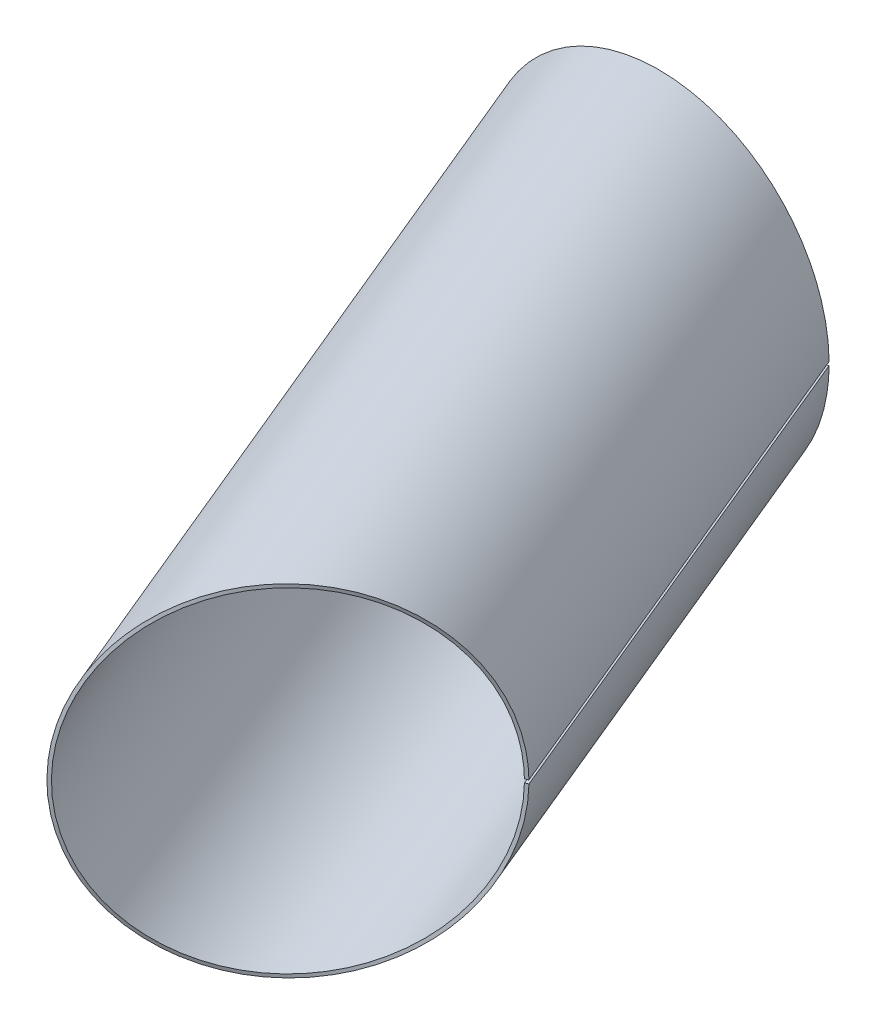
ISO-10303-21;
HEADER;
FILE_DESCRIPTION(('STEP AP214'),'2;1');
FILE_NAME('part.step','',(''),(''),'','','');
FILE_SCHEMA(('AUTOMOTIVE_DESIGN { 1 0 10303 214 1 1 1 1 }'));
ENDSEC;
DATA;
#1=APPLICATION_CONTEXT('core data for automotive mechanical design processes');
#2=APPLICATION_PROTOCOL_DEFINITION('international standard','automotive_design',2000,#1);
#3=PRODUCT_CONTEXT('',#1,'mechanical');
#4=PRODUCT('Part','Part','',(#3));
#5=PRODUCT_RELATED_PRODUCT_CATEGORY('part','',(#4));
#6=PRODUCT_DEFINITION_FORMATION('','',#4);
#7=PRODUCT_DEFINITION_CONTEXT('part definition',#1,'design');
#8=PRODUCT_DEFINITION('design','',#6,#7);
#9=PRODUCT_DEFINITION_SHAPE('','',#8);
#10=(LENGTH_UNIT() NAMED_UNIT(*) SI_UNIT(.MILLI.,.METRE.));
#11=(NAMED_UNIT(*) PLANE_ANGLE_UNIT() SI_UNIT($,.RADIAN.));
#12=(NAMED_UNIT(*) SI_UNIT($,.STERADIAN.) SOLID_ANGLE_UNIT());
#13=UNCERTAINTY_MEASURE_WITH_UNIT(LENGTH_MEASURE(1.E-05),#10,'distance_accuracy_value','');
#14=(GEOMETRIC_REPRESENTATION_CONTEXT(3) GLOBAL_UNCERTAINTY_ASSIGNED_CONTEXT((#13)) GLOBAL_UNIT_ASSIGNED_CONTEXT((#10,
#11,#12)) REPRESENTATION_CONTEXT('',''));
#15=CARTESIAN_POINT('',(0.,0.,0.));
#16=DIRECTION('',(0.,0.,1.));
#17=DIRECTION('',(1.,0.,0.));
#18=AXIS2_PLACEMENT_3D('',#15,#16,#17);
#19=CARTESIAN_POINT('',(-232.022991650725,0.809027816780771,232.88210067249));
#20=CARTESIAN_POINT('',(-232.031048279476,1.8985663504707,232.890051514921));
#21=CARTESIAN_POINT('',(-232.055699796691,3.05668356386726,232.914364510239));
#22=CARTESIAN_POINT('',(-232.152928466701,5.53059312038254,233.010317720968));
#23=CARTESIAN_POINT('',(-232.225528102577,6.8485177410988,233.081918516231));
#24=CARTESIAN_POINT('',(-232.439793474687,9.67082329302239,233.293373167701));
#25=CARTESIAN_POINT('',(-232.581588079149,11.1778912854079,233.433206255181));
#26=CARTESIAN_POINT('',(-232.964990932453,14.4118665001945,233.811572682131));
#27=CARTESIAN_POINT('',(-233.206918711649,16.1422945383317,234.050126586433));
#28=CARTESIAN_POINT('',(-233.835684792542,19.8602142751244,234.670604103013));
#29=CARTESIAN_POINT('',(-234.223179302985,21.8523690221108,235.052634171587));
#30=CARTESIAN_POINT('',(-235.209626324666,26.1314775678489,236.025990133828));
#31=CARTESIAN_POINT('',(-235.809827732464,28.4246571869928,236.617600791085));
#32=CARTESIAN_POINT('',(-237.319996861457,33.33528242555,238.107497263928));
#33=CARTESIAN_POINT('',(-238.231689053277,35.9598997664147,239.006209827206));
#34=CARTESIAN_POINT('',(-239.941182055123,40.1441717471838,240.691840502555));
#35=CARTESIAN_POINT('',(-240.568893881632,41.5808576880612,241.310579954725));
#36=CARTESIAN_POINT('',(-241.962787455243,44.5299732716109,242.684763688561));
#37=CARTESIAN_POINT('',(-242.72961118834,46.0436224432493,243.440470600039));
#38=CARTESIAN_POINT('',(-244.429588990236,49.1340625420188,245.116039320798));
#39=CARTESIAN_POINT('',(-245.363555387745,50.7121755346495,246.036243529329));
#40=CARTESIAN_POINT('',(-247.429824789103,53.9091985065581,248.072307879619));
#41=CARTESIAN_POINT('',(-248.563135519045,55.5294960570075,249.188608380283));
#42=CARTESIAN_POINT('',(-251.063582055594,58.7748022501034,251.651743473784));
#43=CARTESIAN_POINT('',(-252.431930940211,60.4011941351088,252.99913199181));
#44=CARTESIAN_POINT('',(-255.439595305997,63.6039348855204,255.960873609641));
#45=CARTESIAN_POINT('',(-257.08030331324,65.181548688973,257.575898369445));
#46=CARTESIAN_POINT('',(-260.667773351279,68.207834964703,261.107225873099));
#47=CARTESIAN_POINT('',(-262.616011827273,69.6574911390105,263.024293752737));
#48=CARTESIAN_POINT('',(-266.845138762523,72.3198760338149,267.185567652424));
#49=CARTESIAN_POINT('',(-269.127376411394,73.5331120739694,269.430552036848));
#50=CARTESIAN_POINT('',(-274.032730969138,75.583384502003,274.255391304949));
#51=CARTESIAN_POINT('',(-276.656699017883,76.4202869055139,276.835866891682));
#52=CARTESIAN_POINT('',(-282.222172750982,77.551507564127,282.308403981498));
#53=CARTESIAN_POINT('',(-285.163499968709,77.8450456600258,285.200644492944));
#54=CARTESIAN_POINT('',(-291.294285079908,77.711158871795,291.228282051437));
#55=CARTESIAN_POINT('',(-294.481952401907,77.2826415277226,294.363052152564));
#56=CARTESIAN_POINT('',(-300.979231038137,75.543736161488,300.751687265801));
#57=CARTESIAN_POINT('',(-304.285075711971,74.2327306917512,304.003814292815));
#58=CARTESIAN_POINT('',(-310.836628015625,70.6273840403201,310.448190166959));
#59=CARTESIAN_POINT('',(-314.077436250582,68.3335186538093,313.63784664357));
#60=CARTESIAN_POINT('',(-318.727895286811,64.1576749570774,318.215488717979));
#61=CARTESIAN_POINT('',(-320.242160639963,62.6445511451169,319.706474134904));
#62=CARTESIAN_POINT('',(-323.172743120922,59.3874201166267,322.592181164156));
#63=CARTESIAN_POINT('',(-324.588432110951,57.6439613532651,323.986614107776));
#64=CARTESIAN_POINT('',(-327.296099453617,53.9465255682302,326.653779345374));
#65=CARTESIAN_POINT('',(-328.587491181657,51.9931960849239,327.926241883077));
#66=CARTESIAN_POINT('',(-331.023940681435,47.9037545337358,330.327091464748));
#67=CARTESIAN_POINT('',(-332.168481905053,45.76836221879,331.455242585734));
#68=CARTESIAN_POINT('',(-334.293020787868,41.3486272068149,333.54942720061));
#69=CARTESIAN_POINT('',(-335.272592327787,39.0650418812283,334.515269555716));
#70=CARTESIAN_POINT('',(-337.054343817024,34.3870782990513,336.272077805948));
#71=CARTESIAN_POINT('',(-337.856094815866,31.9937516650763,337.062860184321));
#72=CARTESIAN_POINT('',(-339.985431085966,24.7064225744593,339.162726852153));
#73=CARTESIAN_POINT('',(-341.032340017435,19.7121498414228,340.195770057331));
#74=CARTESIAN_POINT('',(-342.397698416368,9.75860028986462,341.542712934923));
#75=CARTESIAN_POINT('',(-342.716391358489,4.80474917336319,341.857242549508));
#76=CARTESIAN_POINT('',(-342.716391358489,-4.80474917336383,341.857242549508));
#77=CARTESIAN_POINT('',(-342.397747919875,-9.75830013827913,341.542733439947));
#78=CARTESIAN_POINT('',(-341.032290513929,-19.7124499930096,340.195749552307));
#79=CARTESIAN_POINT('',(-339.985232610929,-24.7069875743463,339.1626446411));
#80=CARTESIAN_POINT('',(-337.856194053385,-31.993469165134,337.062901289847));
#81=CARTESIAN_POINT('',(-337.054347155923,-34.3870710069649,336.272079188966));
#82=CARTESIAN_POINT('',(-335.272588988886,-39.0650491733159,334.515268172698));
#83=CARTESIAN_POINT('',(-334.293022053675,-41.3486250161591,333.549427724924));
#84=CARTESIAN_POINT('',(-332.168480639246,-45.7683644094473,331.455242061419));
#85=CARTESIAN_POINT('',(-331.023938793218,-47.9037571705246,330.327090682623));
#86=CARTESIAN_POINT('',(-328.587493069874,-51.9931934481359,327.926242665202));
#87=CARTESIAN_POINT('',(-327.296093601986,-53.9465322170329,326.653776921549));
#88=CARTESIAN_POINT('',(-324.588437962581,-57.6439547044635,323.9866165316));
#89=CARTESIAN_POINT('',(-323.172732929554,-59.3874295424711,322.592176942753));
#90=CARTESIAN_POINT('',(-320.24217083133,-62.6445417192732,319.706478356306));
#91=CARTESIAN_POINT('',(-318.728100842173,-64.1575213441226,318.215573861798));
#92=CARTESIAN_POINT('',(-314.077025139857,-68.33382587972,313.637676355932));
#93=CARTESIAN_POINT('',(-310.836306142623,-70.6275314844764,310.448056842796));
#94=CARTESIAN_POINT('',(-304.285397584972,-74.2325832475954,304.003947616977));
#95=CARTESIAN_POINT('',(-300.978887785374,-75.5438126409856,300.751545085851));
#96=CARTESIAN_POINT('',(-294.482295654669,-77.2825650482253,294.363194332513));
#97=CARTESIAN_POINT('',(-291.293988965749,-77.7111642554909,291.228159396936));
#98=CARTESIAN_POINT('',(-285.163796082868,-77.84504027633,285.200767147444));
#99=CARTESIAN_POINT('',(-282.221958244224,-77.551471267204,282.308315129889));
#100=CARTESIAN_POINT('',(-276.656913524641,-76.4203232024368,276.835955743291));
#101=CARTESIAN_POINT('',(-274.03259888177,-75.5833385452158,274.255336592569));
#102=CARTESIAN_POINT('',(-269.127508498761,-73.5331580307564,269.430606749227));
#103=CARTESIAN_POINT('',(-266.845071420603,-72.3198407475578,267.185539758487));
#104=CARTESIAN_POINT('',(-262.616079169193,-69.6575264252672,263.024321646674));
#105=CARTESIAN_POINT('',(-260.667748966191,-68.2078178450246,261.107215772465));
#106=CARTESIAN_POINT('',(-257.080327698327,-65.1815658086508,257.575908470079));
#107=CARTESIAN_POINT('',(-255.439595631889,-63.6039351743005,255.96087374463));
#108=CARTESIAN_POINT('',(-252.431930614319,-60.4011938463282,252.999131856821));
#109=CARTESIAN_POINT('',(-251.063594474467,-58.7748156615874,251.65174861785));
#110=CARTESIAN_POINT('',(-248.563123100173,-55.529482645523,249.188603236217));
#111=CARTESIAN_POINT('',(-247.429841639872,-53.9092201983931,248.072314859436));
#112=CARTESIAN_POINT('',(-245.363538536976,-50.7121538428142,246.036236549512));
#113=CARTESIAN_POINT('',(-244.429606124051,-49.1340884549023,245.116046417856));
#114=CARTESIAN_POINT('',(-242.729594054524,-46.0435965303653,243.44046350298));
#115=CARTESIAN_POINT('',(-241.962802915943,-44.5300004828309,242.684770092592));
#116=CARTESIAN_POINT('',(-240.568878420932,-41.5808304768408,241.310573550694));
#117=CARTESIAN_POINT('',(-239.941002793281,-40.1438067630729,240.691766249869));
#118=CARTESIAN_POINT('',(-238.23204757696,-35.9606297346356,239.006358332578));
#119=CARTESIAN_POINT('',(-237.320131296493,-33.3356459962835,238.107552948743));
#120=CARTESIAN_POINT('',(-235.809693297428,-28.4242936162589,236.61754510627));
#121=CARTESIAN_POINT('',(-235.209706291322,-26.1317660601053,236.026023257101));
#122=CARTESIAN_POINT('',(-234.223099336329,-21.8520805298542,235.052601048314));
#123=CARTESIAN_POINT('',(-233.835729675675,-19.8604349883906,234.670622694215));
#124=CARTESIAN_POINT('',(-233.206873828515,-16.1420738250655,234.050107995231));
#125=CARTESIAN_POINT('',(-232.965014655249,-14.4120329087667,233.811582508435));
#126=CARTESIAN_POINT('',(-232.581564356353,-11.1777248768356,233.433196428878));
#127=CARTESIAN_POINT('',(-232.439804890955,-9.6709483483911,233.293377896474));
#128=CARTESIAN_POINT('',(-232.225516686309,-6.84839268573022,233.081913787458));
#129=CARTESIAN_POINT('',(-232.152932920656,-5.53068736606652,233.010319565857));
#130=CARTESIAN_POINT('',(-232.055695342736,-3.05658931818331,232.914362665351));
#131=CARTESIAN_POINT('',(-232.031048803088,-1.8986371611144,232.890052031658));
#132=CARTESIAN_POINT('',(-232.022991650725,-0.809027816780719,232.88210067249));
#133=CARTESIAN_POINT('',(-233.489582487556,0.79375,233.489582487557));
#134=CARTESIAN_POINT('',(-233.497458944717,1.86303526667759,233.497458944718));
#135=CARTESIAN_POINT('',(-233.521532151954,2.99862091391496,233.521532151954));
#136=CARTESIAN_POINT('',(-233.616583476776,5.42645784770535,233.616583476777));
#137=CARTESIAN_POINT('',(-233.687477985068,6.7186951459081,233.687477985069));
#138=CARTESIAN_POINT('',(-233.896945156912,9.4884405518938,233.896945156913));
#139=CARTESIAN_POINT('',(-234.035391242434,10.9659553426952,234.035391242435));
#140=CARTESIAN_POINT('',(-234.410196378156,14.1396200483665,234.410196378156));
#141=CARTESIAN_POINT('',(-234.646364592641,15.8358291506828,234.646364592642));
#142=CARTESIAN_POINT('',(-235.260981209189,19.4841687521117,235.26098120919));
#143=CARTESIAN_POINT('',(-235.639147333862,21.4364791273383,235.639147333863));
#144=CARTESIAN_POINT('',(-236.6032465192,25.6349643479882,236.603246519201));
#145=CARTESIAN_POINT('',(-237.188782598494,27.8815809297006,237.188782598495));
#146=CARTESIAN_POINT('',(-238.664344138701,32.6986122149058,238.664344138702));
#147=CARTESIAN_POINT('',(-239.55387871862,35.2700078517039,239.553878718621));
#148=CARTESIAN_POINT('',(-241.222636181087,39.3713406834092,241.222636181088));
#149=CARTESIAN_POINT('',(-241.83503120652,40.7788528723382,241.835031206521));
#150=CARTESIAN_POINT('',(-243.195277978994,43.6687492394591,243.195277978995));
#151=CARTESIAN_POINT('',(-243.94312411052,45.1512192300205,243.943124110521));
#152=CARTESIAN_POINT('',(-245.601433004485,48.1786399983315,245.601433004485));
#153=CARTESIAN_POINT('',(-246.511905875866,49.7237055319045,246.511905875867));
#154=CARTESIAN_POINT('',(-248.526612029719,52.8543516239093,248.52661202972));
#155=CARTESIAN_POINT('',(-249.63088448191,54.4400781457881,249.630884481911));
#156=CARTESIAN_POINT('',(-252.067636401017,57.6165987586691,252.067636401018));
#157=CARTESIAN_POINT('',(-253.40020370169,59.2075643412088,253.400203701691));
#158=CARTESIAN_POINT('',(-256.329473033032,62.3408375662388,256.329473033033));
#159=CARTESIAN_POINT('',(-257.926336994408,63.8833197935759,257.926336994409));
#160=CARTESIAN_POINT('',(-261.417965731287,66.8423201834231,261.417965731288));
#161=CARTESIAN_POINT('',(-263.312992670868,68.2589641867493,263.312992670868));
#162=CARTESIAN_POINT('',(-267.426287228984,70.8606544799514,267.426287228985));
#163=CARTESIAN_POINT('',(-269.644929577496,72.0456839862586,269.644929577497));
#164=CARTESIAN_POINT('',(-274.4128359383,74.0481344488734,274.412835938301));
#165=CARTESIAN_POINT('',(-276.962557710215,74.8652600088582,276.962557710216));
#166=CARTESIAN_POINT('',(-282.369378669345,75.9696348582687,282.369378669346));
#167=CARTESIAN_POINT('',(-285.226909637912,76.2561688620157,285.226909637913));
#168=CARTESIAN_POINT('',(-291.181610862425,76.1254834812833,291.181610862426));
#169=CARTESIAN_POINT('',(-294.278976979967,75.70708120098,294.278976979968));
#170=CARTESIAN_POINT('',(-300.590789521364,74.0094991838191,300.590789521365));
#171=CARTESIAN_POINT('',(-303.804932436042,72.7288605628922,303.804932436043));
#172=CARTESIAN_POINT('',(-310.173523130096,69.207325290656,310.173523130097));
#173=CARTESIAN_POINT('',(-313.32700985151,66.9652064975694,313.327009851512));
#174=CARTESIAN_POINT('',(-317.853162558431,62.8822577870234,317.853162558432));
#175=CARTESIAN_POINT('',(-319.327686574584,61.4022197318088,319.327686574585));
#176=CARTESIAN_POINT('',(-322.181661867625,58.2159415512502,322.181661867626));
#177=CARTESIAN_POINT('',(-323.561064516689,56.5097114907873,323.56106451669));
#178=CARTESIAN_POINT('',(-326.199590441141,52.8908363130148,326.199590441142));
#179=CARTESIAN_POINT('',(-327.458668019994,50.9782224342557,327.458668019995));
#180=CARTESIAN_POINT('',(-329.834344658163,46.9736467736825,329.834344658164));
#181=CARTESIAN_POINT('',(-330.950906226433,44.8817351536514,330.950906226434));
#182=CARTESIAN_POINT('',(-333.02362713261,40.5516784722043,333.023627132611));
#183=CARTESIAN_POINT('',(-333.979761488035,38.313597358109,333.979761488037));
#184=CARTESIAN_POINT('',(-335.718932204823,33.7286292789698,335.718932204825));
#185=CARTESIAN_POINT('',(-336.501958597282,31.3818129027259,336.501958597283));
#186=CARTESIAN_POINT('',(-338.58098710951,24.237695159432,338.580987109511));
#187=CARTESIAN_POINT('',(-339.604225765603,19.3378585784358,339.604225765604));
#188=CARTESIAN_POINT('',(-340.938146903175,9.57492065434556,340.938146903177));
#189=CARTESIAN_POINT('',(-341.249732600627,4.7133374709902,341.249732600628));
#190=CARTESIAN_POINT('',(-341.249732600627,-4.7133374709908,341.249732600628));
#191=CARTESIAN_POINT('',(-340.938146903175,-9.57492065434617,340.938146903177));
#192=CARTESIAN_POINT('',(-339.604225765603,-19.3378585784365,339.604225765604));
#193=CARTESIAN_POINT('',(-338.58098710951,-24.2376951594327,338.580987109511));
#194=CARTESIAN_POINT('',(-336.501958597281,-31.3818129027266,336.501958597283));
#195=CARTESIAN_POINT('',(-335.718932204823,-33.7286292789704,335.718932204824));
#196=CARTESIAN_POINT('',(-333.979761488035,-38.3135973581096,333.979761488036));
#197=CARTESIAN_POINT('',(-333.02362713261,-40.5516784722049,333.023627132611));
#198=CARTESIAN_POINT('',(-330.950906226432,-44.8817351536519,330.950906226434));
#199=CARTESIAN_POINT('',(-329.834344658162,-46.973646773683,329.834344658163));
#200=CARTESIAN_POINT('',(-327.458668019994,-50.9782224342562,327.458668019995));
#201=CARTESIAN_POINT('',(-326.19959044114,-52.8908363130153,326.199590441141));
#202=CARTESIAN_POINT('',(-323.561064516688,-56.5097114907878,323.561064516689));
#203=CARTESIAN_POINT('',(-322.181661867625,-58.2159415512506,322.181661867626));
#204=CARTESIAN_POINT('',(-319.327686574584,-61.4022197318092,319.327686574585));
#205=CARTESIAN_POINT('',(-317.853162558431,-62.8822577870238,317.853162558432));
#206=CARTESIAN_POINT('',(-313.32700985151,-66.9652064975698,313.327009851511));
#207=CARTESIAN_POINT('',(-310.173523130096,-69.2073252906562,310.173523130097));
#208=CARTESIAN_POINT('',(-303.804932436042,-72.7288605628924,303.804932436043));
#209=CARTESIAN_POINT('',(-300.590789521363,-74.0094991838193,300.590789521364));
#210=CARTESIAN_POINT('',(-294.278976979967,-75.7070812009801,294.278976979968));
#211=CARTESIAN_POINT('',(-291.181610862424,-76.1254834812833,291.181610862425));
#212=CARTESIAN_POINT('',(-285.226909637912,-76.2561688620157,285.226909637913));
#213=CARTESIAN_POINT('',(-282.369378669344,-75.9696348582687,282.369378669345));
#214=CARTESIAN_POINT('',(-276.962557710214,-74.8652600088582,276.962557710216));
#215=CARTESIAN_POINT('',(-274.4128359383,-74.0481344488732,274.412835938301));
#216=CARTESIAN_POINT('',(-269.644929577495,-72.0456839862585,269.644929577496));
#217=CARTESIAN_POINT('',(-267.426287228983,-70.8606544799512,267.426287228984));
#218=CARTESIAN_POINT('',(-263.312992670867,-68.2589641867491,263.312992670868));
#219=CARTESIAN_POINT('',(-261.417965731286,-66.8423201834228,261.417965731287));
#220=CARTESIAN_POINT('',(-257.926336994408,-63.8833197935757,257.926336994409));
#221=CARTESIAN_POINT('',(-256.329473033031,-62.3408375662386,256.329473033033));
#222=CARTESIAN_POINT('',(-253.40020370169,-59.2075643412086,253.400203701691));
#223=CARTESIAN_POINT('',(-252.067636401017,-57.6165987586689,252.067636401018));
#224=CARTESIAN_POINT('',(-249.63088448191,-54.4400781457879,249.630884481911));
#225=CARTESIAN_POINT('',(-248.526612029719,-52.8543516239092,248.52661202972));
#226=CARTESIAN_POINT('',(-246.511905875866,-49.7237055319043,246.511905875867));
#227=CARTESIAN_POINT('',(-245.601433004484,-48.1786399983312,245.601433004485));
#228=CARTESIAN_POINT('',(-243.94312411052,-45.1512192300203,243.943124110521));
#229=CARTESIAN_POINT('',(-243.195277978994,-43.6687492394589,243.195277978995));
#230=CARTESIAN_POINT('',(-241.83503120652,-40.778852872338,241.835031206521));
#231=CARTESIAN_POINT('',(-241.222636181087,-39.371340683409,241.222636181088));
#232=CARTESIAN_POINT('',(-239.55387871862,-35.2700078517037,239.553878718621));
#233=CARTESIAN_POINT('',(-238.664344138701,-32.6986122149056,238.664344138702));
#234=CARTESIAN_POINT('',(-237.188782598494,-27.8815809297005,237.188782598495));
#235=CARTESIAN_POINT('',(-236.6032465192,-25.634964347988,236.603246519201));
#236=CARTESIAN_POINT('',(-235.639147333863,-21.4364791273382,235.639147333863));
#237=CARTESIAN_POINT('',(-235.260981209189,-19.4841687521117,235.26098120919));
#238=CARTESIAN_POINT('',(-234.646364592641,-15.8358291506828,234.646364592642));
#239=CARTESIAN_POINT('',(-234.410196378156,-14.1396200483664,234.410196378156));
#240=CARTESIAN_POINT('',(-234.035391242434,-10.9659553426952,234.035391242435));
#241=CARTESIAN_POINT('',(-233.896945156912,-9.48844055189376,233.896945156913));
#242=CARTESIAN_POINT('',(-233.687477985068,-6.71869514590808,233.687477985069));
#243=CARTESIAN_POINT('',(-233.616583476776,-5.42645784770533,233.616583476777));
#244=CARTESIAN_POINT('',(-233.521532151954,-2.99862091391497,233.521532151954));
#245=CARTESIAN_POINT('',(-233.497458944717,-1.8630352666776,233.497458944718));
#246=CARTESIAN_POINT('',(-233.489582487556,-0.793750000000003,233.489582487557));
#247=B_SPLINE_SURFACE_WITH_KNOTS('',1,3,((#19,#20,#21,#22,#23,#24,#25,#26,#27,#28,#29,#30,#31,
#32,#33,#34,#35,#36,#37,#38,#39,#40,#41,#42,#43,#44,#45,#46,#47,#48,#49,#50,#51,#52,#53,#54,#55,
#56,#57,#58,#59,#60,#61,#62,#63,#64,#65,#66,#67,#68,#69,#70,#71,#72,#73,#74,#75,#76,#77,#78,#79,
#80,#81,#82,#83,#84,#85,#86,#87,#88,#89,#90,#91,#92,#93,#94,#95,#96,#97,#98,#99,#100,#101,#102,
#103,#104,#105,#106,#107,#108,#109,#110,#111,#112,#113,#114,#115,#116,#117,#118,#119,#120,#121,
#122,#123,#124,#125,#126,#127,#128,#129,#130,#131,#132),(#133,#134,#135,#136,#137,#138,#139,
#140,#141,#142,#143,#144,#145,#146,#147,#148,#149,#150,#151,#152,#153,#154,#155,#156,#157,#158,
#159,#160,#161,#162,#163,#164,#165,#166,#167,#168,#169,#170,#171,#172,#173,#174,#175,#176,#177,
#178,#179,#180,#181,#182,#183,#184,#185,#186,#187,#188,#189,#190,#191,#192,#193,#194,#195,#196,
#197,#198,#199,#200,#201,#202,#203,#204,#205,#206,#207,#208,#209,#210,#211,#212,#213,#214,#215,
#216,#217,#218,#219,#220,#221,#222,#223,#224,#225,#226,#227,#228,#229,#230,#231,#232,#233,#234,
#235,#236,#237,#238,#239,#240,#241,#242,#243,#244,#245,#246)),.UNSPECIFIED.,.F.,.F.,.F.,(2,2),
(4,2,2,2,2,2,2,2,2,2,2,2,2,2,2,2,2,2,2,2,2,2,2,2,2,2,2,2,2,2,2,2,2,2,2,2,2,2,2,2,2,2,2,2,2,2,2,
2,2,2,2,2,2,2,2,2,4),(0.,1.),(0.,0.03125,0.0625,0.09375,0.125,0.15625,0.1875,0.21875,0.234375,
0.25,0.265625,0.28125,0.296875,0.3125,0.328125,0.34375,0.359375,0.375,0.390625,0.40625,0.421875,
0.4296875,0.4375,0.4453125,0.453125,0.4609375,0.46875,0.484375,0.5,0.515625,0.53125,0.5390625,
0.546875,0.5546875,0.5625,0.5703125,0.578125,0.59375,0.609375,0.625,0.640625,0.65625,0.671875,
0.6875,0.703125,0.71875,0.734375,0.75,0.765625,0.78125,0.8125,0.84375,0.875,0.90625,0.9375,
0.96875,1.),.UNSPECIFIED.);
#248=CARTESIAN_POINT('',(-232.022991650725,-0.809027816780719,232.88210067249));
#249=CARTESIAN_POINT('',(-233.489582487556,-0.793750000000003,233.489582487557));
#250=B_SPLINE_CURVE_WITH_KNOTS('',1,(#248,#249),.UNSPECIFIED.,.F.,.F.,(2,2),(0.,1.),.UNSPECIFIED.);
#251=CARTESIAN_POINT('',(-233.489582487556,-0.793750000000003,233.489582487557));
#252=VERTEX_POINT('',#251);
#253=CARTESIAN_POINT('',(-232.022991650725,-0.809027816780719,232.88210067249));
#254=VERTEX_POINT('',#253);
#255=EDGE_CURVE('E14',#252,#254,#250,.F.);
#256=CARTESIAN_POINT('',(-233.489582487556,-0.793750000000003,233.489582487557));
#257=CARTESIAN_POINT('',(-233.497458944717,-1.8630352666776,233.497458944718));
#258=CARTESIAN_POINT('',(-233.521532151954,-2.99862091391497,233.521532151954));
#259=CARTESIAN_POINT('',(-233.616583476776,-5.42645784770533,233.616583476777));
#260=CARTESIAN_POINT('',(-233.687477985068,-6.71869514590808,233.687477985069));
#261=CARTESIAN_POINT('',(-233.896945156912,-9.48844055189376,233.896945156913));
#262=CARTESIAN_POINT('',(-234.035391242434,-10.9659553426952,234.035391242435));
#263=CARTESIAN_POINT('',(-234.410196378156,-14.1396200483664,234.410196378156));
#264=CARTESIAN_POINT('',(-234.646364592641,-15.8358291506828,234.646364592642));
#265=CARTESIAN_POINT('',(-235.260981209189,-19.4841687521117,235.26098120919));
#266=CARTESIAN_POINT('',(-235.639147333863,-21.4364791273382,235.639147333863));
#267=CARTESIAN_POINT('',(-236.6032465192,-25.634964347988,236.603246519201));
#268=CARTESIAN_POINT('',(-237.188782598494,-27.8815809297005,237.188782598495));
#269=CARTESIAN_POINT('',(-238.664344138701,-32.6986122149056,238.664344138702));
#270=CARTESIAN_POINT('',(-239.55387871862,-35.2700078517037,239.553878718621));
#271=CARTESIAN_POINT('',(-241.222636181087,-39.371340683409,241.222636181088));
#272=CARTESIAN_POINT('',(-241.83503120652,-40.778852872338,241.835031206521));
#273=CARTESIAN_POINT('',(-243.195277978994,-43.6687492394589,243.195277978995));
#274=CARTESIAN_POINT('',(-243.94312411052,-45.1512192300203,243.943124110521));
#275=CARTESIAN_POINT('',(-245.601433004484,-48.1786399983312,245.601433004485));
#276=CARTESIAN_POINT('',(-246.511905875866,-49.7237055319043,246.511905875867));
#277=CARTESIAN_POINT('',(-248.526612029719,-52.8543516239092,248.52661202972));
#278=CARTESIAN_POINT('',(-249.63088448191,-54.4400781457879,249.630884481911));
#279=CARTESIAN_POINT('',(-252.067636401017,-57.6165987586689,252.067636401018));
#280=CARTESIAN_POINT('',(-253.40020370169,-59.2075643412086,253.400203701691));
#281=CARTESIAN_POINT('',(-256.329473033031,-62.3408375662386,256.329473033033));
#282=CARTESIAN_POINT('',(-257.926336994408,-63.8833197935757,257.926336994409));
#283=CARTESIAN_POINT('',(-261.417965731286,-66.8423201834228,261.417965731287));
#284=CARTESIAN_POINT('',(-263.312992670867,-68.2589641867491,263.312992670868));
#285=CARTESIAN_POINT('',(-267.426287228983,-70.8606544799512,267.426287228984));
#286=CARTESIAN_POINT('',(-269.644929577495,-72.0456839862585,269.644929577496));
#287=CARTESIAN_POINT('',(-274.4128359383,-74.0481344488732,274.412835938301));
#288=CARTESIAN_POINT('',(-276.962557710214,-74.8652600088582,276.962557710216));
#289=CARTESIAN_POINT('',(-282.369378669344,-75.9696348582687,282.369378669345));
#290=CARTESIAN_POINT('',(-285.226909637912,-76.2561688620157,285.226909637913));
#291=CARTESIAN_POINT('',(-291.181610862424,-76.1254834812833,291.181610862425));
#292=CARTESIAN_POINT('',(-294.278976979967,-75.7070812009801,294.278976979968));
#293=CARTESIAN_POINT('',(-300.590789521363,-74.0094991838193,300.590789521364));
#294=CARTESIAN_POINT('',(-303.804932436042,-72.7288605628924,303.804932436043));
#295=CARTESIAN_POINT('',(-310.173523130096,-69.2073252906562,310.173523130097));
#296=CARTESIAN_POINT('',(-313.32700985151,-66.9652064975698,313.327009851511));
#297=CARTESIAN_POINT('',(-317.853162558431,-62.8822577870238,317.853162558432));
#298=CARTESIAN_POINT('',(-319.327686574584,-61.4022197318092,319.327686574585));
#299=CARTESIAN_POINT('',(-322.181661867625,-58.2159415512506,322.181661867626));
#300=CARTESIAN_POINT('',(-323.561064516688,-56.5097114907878,323.561064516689));
#301=CARTESIAN_POINT('',(-326.19959044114,-52.8908363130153,326.199590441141));
#302=CARTESIAN_POINT('',(-327.458668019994,-50.9782224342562,327.458668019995));
#303=CARTESIAN_POINT('',(-329.834344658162,-46.973646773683,329.834344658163));
#304=CARTESIAN_POINT('',(-330.950906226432,-44.8817351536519,330.950906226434));
#305=CARTESIAN_POINT('',(-333.02362713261,-40.5516784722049,333.023627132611));
#306=CARTESIAN_POINT('',(-333.979761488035,-38.3135973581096,333.979761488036));
#307=CARTESIAN_POINT('',(-335.718932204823,-33.7286292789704,335.718932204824));
#308=CARTESIAN_POINT('',(-336.501958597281,-31.3818129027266,336.501958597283));
#309=CARTESIAN_POINT('',(-338.58098710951,-24.2376951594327,338.580987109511));
#310=CARTESIAN_POINT('',(-339.604225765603,-19.3378585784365,339.604225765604));
#311=CARTESIAN_POINT('',(-340.938146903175,-9.57492065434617,340.938146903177));
#312=CARTESIAN_POINT('',(-341.249732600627,-4.7133374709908,341.249732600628));
#313=CARTESIAN_POINT('',(-341.249732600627,4.7133374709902,341.249732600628));
#314=CARTESIAN_POINT('',(-340.938146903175,9.57492065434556,340.938146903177));
#315=CARTESIAN_POINT('',(-339.604225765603,19.3378585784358,339.604225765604));
#316=CARTESIAN_POINT('',(-338.58098710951,24.237695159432,338.580987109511));
#317=CARTESIAN_POINT('',(-336.501958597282,31.3818129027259,336.501958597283));
#318=CARTESIAN_POINT('',(-335.718932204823,33.7286292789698,335.718932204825));
#319=CARTESIAN_POINT('',(-333.979761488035,38.313597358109,333.979761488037));
#320=CARTESIAN_POINT('',(-333.02362713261,40.5516784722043,333.023627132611));
#321=CARTESIAN_POINT('',(-330.950906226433,44.8817351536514,330.950906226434));
#322=CARTESIAN_POINT('',(-329.834344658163,46.9736467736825,329.834344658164));
#323=CARTESIAN_POINT('',(-327.458668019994,50.9782224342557,327.458668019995));
#324=CARTESIAN_POINT('',(-326.199590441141,52.8908363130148,326.199590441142));
#325=CARTESIAN_POINT('',(-323.561064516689,56.5097114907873,323.56106451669));
#326=CARTESIAN_POINT('',(-322.181661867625,58.2159415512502,322.181661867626));
#327=CARTESIAN_POINT('',(-319.327686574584,61.4022197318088,319.327686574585));
#328=CARTESIAN_POINT('',(-317.853162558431,62.8822577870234,317.853162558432));
#329=CARTESIAN_POINT('',(-313.32700985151,66.9652064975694,313.327009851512));
#330=CARTESIAN_POINT('',(-310.173523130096,69.207325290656,310.173523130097));
#331=CARTESIAN_POINT('',(-303.804932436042,72.7288605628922,303.804932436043));
#332=CARTESIAN_POINT('',(-300.590789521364,74.0094991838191,300.590789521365));
#333=CARTESIAN_POINT('',(-294.278976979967,75.70708120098,294.278976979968));
#334=CARTESIAN_POINT('',(-291.181610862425,76.1254834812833,291.181610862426));
#335=CARTESIAN_POINT('',(-285.226909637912,76.2561688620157,285.226909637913));
#336=CARTESIAN_POINT('',(-282.369378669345,75.9696348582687,282.369378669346));
#337=CARTESIAN_POINT('',(-276.962557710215,74.8652600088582,276.962557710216));
#338=CARTESIAN_POINT('',(-274.4128359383,74.0481344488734,274.412835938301));
#339=CARTESIAN_POINT('',(-269.644929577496,72.0456839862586,269.644929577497));
#340=CARTESIAN_POINT('',(-267.426287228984,70.8606544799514,267.426287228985));
#341=CARTESIAN_POINT('',(-263.312992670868,68.2589641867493,263.312992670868));
#342=CARTESIAN_POINT('',(-261.417965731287,66.8423201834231,261.417965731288));
#343=CARTESIAN_POINT('',(-257.926336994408,63.8833197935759,257.926336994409));
#344=CARTESIAN_POINT('',(-256.329473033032,62.3408375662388,256.329473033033));
#345=CARTESIAN_POINT('',(-253.40020370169,59.2075643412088,253.400203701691));
#346=CARTESIAN_POINT('',(-252.067636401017,57.6165987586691,252.067636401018));
#347=CARTESIAN_POINT('',(-249.63088448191,54.4400781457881,249.630884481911));
#348=CARTESIAN_POINT('',(-248.526612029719,52.8543516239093,248.52661202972));
#349=CARTESIAN_POINT('',(-246.511905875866,49.7237055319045,246.511905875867));
#350=CARTESIAN_POINT('',(-245.601433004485,48.1786399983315,245.601433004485));
#351=CARTESIAN_POINT('',(-243.94312411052,45.1512192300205,243.943124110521));
#352=CARTESIAN_POINT('',(-243.195277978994,43.6687492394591,243.195277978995));
#353=CARTESIAN_POINT('',(-241.83503120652,40.7788528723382,241.835031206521));
#354=CARTESIAN_POINT('',(-241.222636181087,39.3713406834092,241.222636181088));
#355=CARTESIAN_POINT('',(-239.55387871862,35.2700078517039,239.553878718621));
#356=CARTESIAN_POINT('',(-238.664344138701,32.6986122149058,238.664344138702));
#357=CARTESIAN_POINT('',(-237.188782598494,27.8815809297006,237.188782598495));
#358=CARTESIAN_POINT('',(-236.6032465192,25.6349643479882,236.603246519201));
#359=CARTESIAN_POINT('',(-235.639147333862,21.4364791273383,235.639147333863));
#360=CARTESIAN_POINT('',(-235.260981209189,19.4841687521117,235.26098120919));
#361=CARTESIAN_POINT('',(-234.646364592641,15.8358291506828,234.646364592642));
#362=CARTESIAN_POINT('',(-234.410196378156,14.1396200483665,234.410196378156));
#363=CARTESIAN_POINT('',(-234.035391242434,10.9659553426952,234.035391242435));
#364=CARTESIAN_POINT('',(-233.896945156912,9.4884405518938,233.896945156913));
#365=CARTESIAN_POINT('',(-233.687477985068,6.7186951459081,233.687477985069));
#366=CARTESIAN_POINT('',(-233.616583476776,5.42645784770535,233.616583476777));
#367=CARTESIAN_POINT('',(-233.521532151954,2.99862091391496,233.521532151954));
#368=CARTESIAN_POINT('',(-233.497458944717,1.86303526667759,233.497458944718));
#369=CARTESIAN_POINT('',(-233.489582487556,0.79375,233.489582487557));
#370=B_SPLINE_CURVE_WITH_KNOTS('',3,(#256,#257,#258,#259,#260,#261,#262,#263,#264,#265,#266,
#267,#268,#269,#270,#271,#272,#273,#274,#275,#276,#277,#278,#279,#280,#281,#282,#283,#284,#285,
#286,#287,#288,#289,#290,#291,#292,#293,#294,#295,#296,#297,#298,#299,#300,#301,#302,#303,#304,
#305,#306,#307,#308,#309,#310,#311,#312,#313,#314,#315,#316,#317,#318,#319,#320,#321,#322,#323,
#324,#325,#326,#327,#328,#329,#330,#331,#332,#333,#334,#335,#336,#337,#338,#339,#340,#341,#342,
#343,#344,#345,#346,#347,#348,#349,#350,#351,#352,#353,#354,#355,#356,#357,#358,#359,#360,#361,
#362,#363,#364,#365,#366,#367,#368,#369),.UNSPECIFIED.,.F.,.F.,(4,2,2,2,2,2,2,2,2,2,2,2,2,2,2,2,
2,2,2,2,2,2,2,2,2,2,2,2,2,2,2,2,2,2,2,2,2,2,2,2,2,2,2,2,2,2,2,2,2,2,2,2,2,2,2,2,4),(0.,0.03125,
0.0625,0.09375,0.125,0.15625,0.1875,0.21875,0.234375,0.25,0.265625,0.28125,0.296875,0.3125,
0.328125,0.34375,0.359375,0.375,0.390625,0.40625,0.421875,0.4296875,0.4375,0.4453125,0.453125,
0.4609375,0.46875,0.484375,0.5,0.515625,0.53125,0.5390625,0.546875,0.5546875,0.5625,0.5703125,
0.578125,0.59375,0.609375,0.625,0.640625,0.65625,0.671875,0.6875,0.703125,0.71875,0.734375,0.75,
0.765625,0.78125,0.8125,0.84375,0.875,0.90625,0.9375,0.96875,1.),.UNSPECIFIED.);
#371=CARTESIAN_POINT('',(-233.489582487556,0.79375,233.489582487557));
#372=VERTEX_POINT('',#371);
#373=EDGE_CURVE('E495',#252,#372,#370,.T.);
#374=CARTESIAN_POINT('',(-233.489582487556,0.79375,233.489582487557));
#375=CARTESIAN_POINT('',(-232.022991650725,0.809027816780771,232.88210067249));
#376=B_SPLINE_CURVE_WITH_KNOTS('',1,(#374,#375),.UNSPECIFIED.,.F.,.F.,(2,2),(0.,1.),.UNSPECIFIED.);
#377=CARTESIAN_POINT('',(-232.022991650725,0.809027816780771,232.88210067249));
#378=VERTEX_POINT('',#377);
#379=EDGE_CURVE('E444',#372,#378,#376,.T.);
#380=CARTESIAN_POINT('',(-232.022991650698,-0.809027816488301,232.882100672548));
#381=CARTESIAN_POINT('',(-232.031519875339,-1.9711552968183,232.890514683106));
#382=CARTESIAN_POINT('',(-232.058670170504,-3.13310526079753,232.917304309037));
#383=CARTESIAN_POINT('',(-232.156405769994,-5.6181086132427,233.013739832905));
#384=CARTESIAN_POINT('',(-232.232584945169,-6.94073342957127,233.088905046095));
#385=CARTESIAN_POINT('',(-232.388152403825,-8.99101533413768,233.242397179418));
#386=CARTESIAN_POINT('',(-232.450991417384,-9.72122630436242,233.3043971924));
#387=CARTESIAN_POINT('',(-232.59676252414,-11.2333810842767,233.448222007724));
#388=CARTESIAN_POINT('',(-232.680846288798,-12.0151073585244,233.531183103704));
#389=CARTESIAN_POINT('',(-232.872860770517,-13.6347765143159,233.720628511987));
#390=CARTESIAN_POINT('',(-232.982130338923,-14.4724063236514,233.828433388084));
#391=CARTESIAN_POINT('',(-233.229898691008,-16.2086521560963,234.072878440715));
#392=CARTESIAN_POINT('',(-233.370032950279,-17.1068080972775,234.211132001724));
#393=CARTESIAN_POINT('',(-233.685004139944,-18.9692200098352,234.521864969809));
#394=CARTESIAN_POINT('',(-233.861746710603,-19.9328410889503,234.696223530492));
#395=CARTESIAN_POINT('',(-234.257895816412,-21.9311636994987,235.087020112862));
#396=CARTESIAN_POINT('',(-234.479651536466,-22.9649470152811,235.305774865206));
#397=CARTESIAN_POINT('',(-234.9739129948,-25.1089472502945,235.793326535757));
#398=CARTESIAN_POINT('',(-235.24916371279,-26.2179181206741,236.064829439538));
#399=CARTESIAN_POINT('',(-235.862191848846,-28.5165421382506,236.669476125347));
#400=CARTESIAN_POINT('',(-236.203374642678,-29.704404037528,237.005975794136));
#401=CARTESIAN_POINT('',(-236.96023979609,-32.1654056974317,237.752448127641));
#402=CARTESIAN_POINT('',(-237.379904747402,-33.4361396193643,238.166348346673));
#403=CARTESIAN_POINT('',(-238.061868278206,-35.360975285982,238.838758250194));
#404=CARTESIAN_POINT('',(-238.306721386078,-36.0273406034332,239.08014841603));
#405=CARTESIAN_POINT('',(-238.821965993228,-37.3812224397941,239.588199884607));
#406=CARTESIAN_POINT('',(-239.093017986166,-38.0682425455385,239.855516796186));
#407=CARTESIAN_POINT('',(-239.663211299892,-39.4636917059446,240.417748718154));
#408=CARTESIAN_POINT('',(-239.963077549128,-40.1715384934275,240.713373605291));
#409=CARTESIAN_POINT('',(-240.593871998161,-41.607830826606,241.335240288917));
#410=CARTESIAN_POINT('',(-240.925602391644,-42.3355821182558,241.662272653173));
#411=CARTESIAN_POINT('',(-241.62300425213,-43.8110572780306,242.349755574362));
#412=CARTESIAN_POINT('',(-241.989543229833,-44.5579737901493,242.711059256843));
#413=CARTESIAN_POINT('',(-242.760008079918,-46.0703940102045,243.470479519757));
#414=CARTESIAN_POINT('',(-243.164887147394,-46.8349416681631,243.869533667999));
#415=CARTESIAN_POINT('',(-244.015436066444,-48.3811425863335,244.707794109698));
#416=CARTESIAN_POINT('',(-244.462133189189,-49.1616836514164,245.148010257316));
#417=CARTESIAN_POINT('',(-245.400288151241,-50.7373528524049,246.072493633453));
#418=CARTESIAN_POINT('',(-245.892866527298,-51.5311681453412,246.557862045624));
#419=CARTESIAN_POINT('',(-246.926680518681,-53.1306914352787,247.576471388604));
#420=CARTESIAN_POINT('',(-247.469114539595,-53.9348758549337,248.110889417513));
#421=CARTESIAN_POINT('',(-248.607074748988,-55.551000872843,249.231947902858));
#422=CARTESIAN_POINT('',(-249.203894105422,-56.3611508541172,249.819857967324));
#423=CARTESIAN_POINT('',(-250.454916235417,-57.9847992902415,251.052105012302));
#424=CARTESIAN_POINT('',(-251.110485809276,-58.7962276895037,251.697783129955));
#425=CARTESIAN_POINT('',(-252.483707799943,-60.4160835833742,253.050168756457));
#426=CARTESIAN_POINT('',(-253.202810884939,-61.2220944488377,253.758298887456));
#427=CARTESIAN_POINT('',(-254.707540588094,-62.824376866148,255.239936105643));
#428=CARTESIAN_POINT('',(-255.494673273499,-63.6178709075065,256.014919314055));
#429=CARTESIAN_POINT('',(-257.139992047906,-65.1858773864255,257.634685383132));
#430=CARTESIAN_POINT('',(-257.999735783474,-65.9571791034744,258.480993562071));
#431=CARTESIAN_POINT('',(-259.794432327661,-67.4710847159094,260.247498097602));
#432=CARTESIAN_POINT('',(-260.730960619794,-68.2100321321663,261.169237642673));
#433=CARTESIAN_POINT('',(-262.17605034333,-69.2735131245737,262.591309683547));
#434=CARTESIAN_POINT('',(-262.674010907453,-69.6265560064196,263.081303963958));
#435=CARTESIAN_POINT('',(-263.690166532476,-70.3201038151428,264.081200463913));
#436=CARTESIAN_POINT('',(-264.208553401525,-70.6600572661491,264.591291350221));
#437=CARTESIAN_POINT('',(-265.26597289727,-71.3257302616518,265.631730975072));
#438=CARTESIAN_POINT('',(-265.805194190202,-71.6508619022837,266.162263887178));
#439=CARTESIAN_POINT('',(-266.904520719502,-72.2848037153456,267.243803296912));
#440=CARTESIAN_POINT('',(-267.464809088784,-72.5929924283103,267.794988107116));
#441=CARTESIAN_POINT('',(-268.606353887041,-73.190879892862,268.917932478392));
#442=CARTESIAN_POINT('',(-269.18778476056,-73.4799258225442,269.489862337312));
#443=CARTESIAN_POINT('',(-270.371683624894,-74.0373687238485,270.654403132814));
#444=CARTESIAN_POINT('',(-270.974316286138,-74.305078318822,271.247175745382));
#445=CARTESIAN_POINT('',(-272.200735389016,-74.8176642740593,272.453466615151));
#446=CARTESIAN_POINT('',(-272.824676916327,-75.0618143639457,273.067135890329));
#447=CARTESIAN_POINT('',(-274.093459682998,-75.5247353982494,274.314977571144));
#448=CARTESIAN_POINT('',(-274.738441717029,-75.7427508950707,274.94928718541));
#449=CARTESIAN_POINT('',(-276.048919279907,-76.1508315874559,276.238032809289));
#450=CARTESIAN_POINT('',(-276.714539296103,-76.3401141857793,276.89259011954));
#451=CARTESIAN_POINT('',(-278.065882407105,-76.6881679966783,278.221462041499));
#452=CARTESIAN_POINT('',(-278.75171232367,-76.8461247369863,278.895881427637));
#453=CARTESIAN_POINT('',(-280.143056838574,-77.1289007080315,280.264021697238));
#454=CARTESIAN_POINT('',(-280.848659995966,-77.252869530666,280.957828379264));
#455=CARTESIAN_POINT('',(-282.278563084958,-77.4648896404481,282.363823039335));
#456=CARTESIAN_POINT('',(-283.002928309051,-77.5520758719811,283.07607515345));
#457=CARTESIAN_POINT('',(-284.469291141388,-77.6877870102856,284.517890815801));
#458=CARTESIAN_POINT('',(-285.211330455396,-77.7354324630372,285.247494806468));
#459=CARTESIAN_POINT('',(-286.71194477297,-77.7893304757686,286.722958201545));
#460=CARTESIAN_POINT('',(-287.470536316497,-77.7946825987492,287.468833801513));
#461=CARTESIAN_POINT('',(-289.003053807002,-77.7611763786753,288.975632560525));
#462=CARTESIAN_POINT('',(-289.77696984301,-77.7213943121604,289.736545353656));
#463=CARTESIAN_POINT('',(-291.338218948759,-77.5950570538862,291.271638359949));
#464=CARTESIAN_POINT('',(-292.125513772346,-77.5075900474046,292.04578247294));
#465=CARTESIAN_POINT('',(-293.711630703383,-77.2834094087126,293.60541984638));
#466=CARTESIAN_POINT('',(-294.510387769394,-77.1457920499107,294.39084942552));
#467=CARTESIAN_POINT('',(-296.11750018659,-76.8188487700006,295.971159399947));
#468=CARTESIAN_POINT('',(-296.925761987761,-76.6286186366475,296.765948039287));
#469=CARTESIAN_POINT('',(-298.549719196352,-76.1939319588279,298.362850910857));
#470=CARTESIAN_POINT('',(-299.365291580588,-75.9485721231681,299.16484445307));
#471=CARTESIAN_POINT('',(-301.001007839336,-75.4019491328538,300.773495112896));
#472=CARTESIAN_POINT('',(-301.821004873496,-75.0998298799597,301.580010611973));
#473=CARTESIAN_POINT('',(-303.46287887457,-74.4381084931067,303.194955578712));
#474=CARTESIAN_POINT('',(-304.284587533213,-74.0776870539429,304.003220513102));
#475=CARTESIAN_POINT('',(-305.927148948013,-73.2977865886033,305.618936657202));
#476=CARTESIAN_POINT('',(-306.747810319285,-72.8775149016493,306.426200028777));
#477=CARTESIAN_POINT('',(-308.385173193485,-71.9763920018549,308.036900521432));
#478=CARTESIAN_POINT('',(-309.201661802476,-71.4947812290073,308.840129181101));
#479=CARTESIAN_POINT('',(-310.827163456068,-70.4709039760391,310.439471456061));
#480=CARTESIAN_POINT('',(-311.635957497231,-69.9279580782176,311.235372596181));
#481=CARTESIAN_POINT('',(-313.242873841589,-68.7813835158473,312.816785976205));
#482=CARTESIAN_POINT('',(-314.040771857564,-68.1771377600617,313.602078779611));
#483=CARTESIAN_POINT('',(-315.622633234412,-66.9078383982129,315.158953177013));
#484=CARTESIAN_POINT('',(-316.406365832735,-66.2422184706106,315.930307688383));
#485=CARTESIAN_POINT('',(-317.956166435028,-64.8506993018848,317.455845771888));
#486=CARTESIAN_POINT('',(-318.722007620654,-64.1243048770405,318.2098080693));
#487=CARTESIAN_POINT('',(-320.232740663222,-62.6128471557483,319.69721383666));
#488=CARTESIAN_POINT('',(-320.97742087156,-61.8273680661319,320.430449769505));
#489=CARTESIAN_POINT('',(-322.442317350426,-60.1992300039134,321.872966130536));
#490=CARTESIAN_POINT('',(-323.162338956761,-59.3562268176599,322.582055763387));
#491=CARTESIAN_POINT('',(-324.57471725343,-57.6154889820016,323.973111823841));
#492=CARTESIAN_POINT('',(-325.266906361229,-56.7174869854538,324.65491386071));
#493=CARTESIAN_POINT('',(-326.620355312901,-54.8692718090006,325.988168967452));
#494=CARTESIAN_POINT('',(-327.281478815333,-53.9188622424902,326.639488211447));
#495=CARTESIAN_POINT('',(-328.569953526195,-51.9692057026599,327.908964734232));
#496=CARTESIAN_POINT('',(-329.197208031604,-50.9698329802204,328.527027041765));
#497=CARTESIAN_POINT('',(-330.415080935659,-48.92567902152,329.727150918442));
#498=CARTESIAN_POINT('',(-331.005646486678,-47.880835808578,330.309160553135));
#499=CARTESIAN_POINT('',(-332.147827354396,-45.7499024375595,331.434884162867));
#500=CARTESIAN_POINT('',(-332.699439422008,-44.6638088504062,331.978594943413));
#501=CARTESIAN_POINT('',(-333.761405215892,-42.4545495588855,333.025426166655));
#502=CARTESIAN_POINT('',(-334.271809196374,-41.3314314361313,333.528596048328));
#503=CARTESIAN_POINT('',(-335.249700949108,-39.0528621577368,334.492696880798));
#504=CARTESIAN_POINT('',(-335.717294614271,-37.89750054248,334.953732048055));
#505=CARTESIAN_POINT('',(-336.607920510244,-35.5591382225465,335.831918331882));
#506=CARTESIAN_POINT('',(-337.031117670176,-34.3762613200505,336.249231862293));
#507=CARTESIAN_POINT('',(-337.832057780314,-31.9879544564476,337.039093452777));
#508=CARTESIAN_POINT('',(-338.210022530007,-30.7826711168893,337.411859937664));
#509=CARTESIAN_POINT('',(-338.91944148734,-28.3544276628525,338.111519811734));
#510=CARTESIAN_POINT('',(-339.251178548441,-27.1316305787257,338.438692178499));
#511=CARTESIAN_POINT('',(-339.867967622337,-24.673690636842,339.047069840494));
#512=CARTESIAN_POINT('',(-340.153361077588,-23.4387165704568,339.328611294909));
#513=CARTESIAN_POINT('',(-340.677769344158,-20.9612238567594,339.845957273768));
#514=CARTESIAN_POINT('',(-340.917167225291,-19.7188651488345,340.082139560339));
#515=CARTESIAN_POINT('',(-341.349768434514,-17.2313497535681,340.508916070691));
#516=CARTESIAN_POINT('',(-341.543404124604,-15.9863415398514,340.699936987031));
#517=CARTESIAN_POINT('',(-341.884689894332,-13.4985821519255,341.036627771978));
#518=CARTESIAN_POINT('',(-342.032836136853,-12.2559652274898,341.182786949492));
#519=CARTESIAN_POINT('',(-342.28454629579,-9.77747079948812,341.431134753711));
#520=CARTESIAN_POINT('',(-342.388636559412,-8.54169862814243,341.533842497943));
#521=CARTESIAN_POINT('',(-342.553625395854,-6.08086367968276,341.696640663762));
#522=CARTESIAN_POINT('',(-342.615073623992,-4.85587359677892,341.757273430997));
#523=CARTESIAN_POINT('',(-342.69616651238,-2.42056356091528,341.837288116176));
#524=CARTESIAN_POINT('',(-342.716391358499,-1.2102817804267,341.857242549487));
#525=CARTESIAN_POINT('',(-342.716391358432,1.21028178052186,341.857242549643));
#526=CARTESIAN_POINT('',(-342.696166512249,2.42056356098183,341.837288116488));
#527=CARTESIAN_POINT('',(-342.615073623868,4.85587359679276,341.757273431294));
#528=CARTESIAN_POINT('',(-342.553625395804,6.08086367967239,341.696640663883));
#529=CARTESIAN_POINT('',(-342.388636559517,8.54169862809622,341.533842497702));
#530=CARTESIAN_POINT('',(-342.284546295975,9.77747079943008,341.431134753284));
#531=CARTESIAN_POINT('',(-342.032836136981,12.2559652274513,341.1827869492));
#532=CARTESIAN_POINT('',(-341.884689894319,13.4985821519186,341.036627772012));
#533=CARTESIAN_POINT('',(-341.543404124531,15.9863415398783,340.699936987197));
#534=CARTESIAN_POINT('',(-341.349768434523,17.2313497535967,340.508916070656));
#535=CARTESIAN_POINT('',(-340.917167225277,19.7188651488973,340.082139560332));
#536=CARTESIAN_POINT('',(-340.677769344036,20.9612238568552,339.845957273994));
#537=CARTESIAN_POINT('',(-340.153361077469,23.4387165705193,339.328611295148));
#538=CARTESIAN_POINT('',(-339.867967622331,24.6736906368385,339.04706984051));
#539=CARTESIAN_POINT('',(-339.251178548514,27.1316305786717,338.43869217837));
#540=CARTESIAN_POINT('',(-338.919441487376,28.3544276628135,338.111519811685));
#541=CARTESIAN_POINT('',(-338.21002252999,30.7826711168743,337.411859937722));
#542=CARTESIAN_POINT('',(-337.83205778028,31.9879544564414,337.039093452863));
#543=CARTESIAN_POINT('',(-337.031117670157,34.3762613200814,336.249231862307));
#544=CARTESIAN_POINT('',(-336.607920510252,35.5591382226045,335.831918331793));
#545=CARTESIAN_POINT('',(-335.717294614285,37.8975005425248,334.953732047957));
#546=CARTESIAN_POINT('',(-335.249700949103,39.0528621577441,334.492696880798));
#547=CARTESIAN_POINT('',(-334.271809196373,41.3314314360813,333.528596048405));
#548=CARTESIAN_POINT('',(-333.761405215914,42.4545495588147,333.025426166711));
#549=CARTESIAN_POINT('',(-332.699439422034,44.6638088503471,331.978594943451));
#550=CARTESIAN_POINT('',(-332.147827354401,45.7499024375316,331.434884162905));
#551=CARTESIAN_POINT('',(-331.005646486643,47.8808358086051,330.30916055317));
#552=CARTESIAN_POINT('',(-330.415080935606,48.9256790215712,329.727150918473));
#553=CARTESIAN_POINT('',(-329.197208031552,50.969832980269,328.527027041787));
#554=CARTESIAN_POINT('',(-328.569953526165,51.9692057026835,327.908964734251));
#555=CARTESIAN_POINT('',(-327.281478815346,53.9188622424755,326.63948821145));
#556=CARTESIAN_POINT('',(-326.620355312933,54.8692718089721,325.988168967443));
#557=CARTESIAN_POINT('',(-325.266906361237,56.7174869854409,324.654913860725));
#558=CARTESIAN_POINT('',(-324.574717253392,57.6154889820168,323.973111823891));
#559=CARTESIAN_POINT('',(-323.162338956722,59.3562268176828,322.582055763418));
#560=CARTESIAN_POINT('',(-322.442317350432,60.1992300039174,321.872966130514));
#561=CARTESIAN_POINT('',(-320.977420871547,61.8273680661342,320.430449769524));
#562=CARTESIAN_POINT('',(-320.232740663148,62.6128471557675,319.697213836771));
#563=CARTESIAN_POINT('',(-318.722007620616,64.1243048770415,318.209808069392));
#564=CARTESIAN_POINT('',(-317.956166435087,64.8506993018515,317.455845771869));
#565=CARTESIAN_POINT('',(-316.406365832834,66.2422184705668,315.930307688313));
#566=CARTESIAN_POINT('',(-315.622633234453,66.9078383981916,315.158953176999));
#567=CARTESIAN_POINT('',(-314.040771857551,68.1771377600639,313.602078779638));
#568=CARTESIAN_POINT('',(-313.242873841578,68.7813835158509,312.816785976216));
#569=CARTESIAN_POINT('',(-311.635957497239,69.9279580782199,311.23537259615));
#570=CARTESIAN_POINT('',(-310.827163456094,70.4709039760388,310.439471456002));
#571=CARTESIAN_POINT('',(-309.201661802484,71.4947812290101,308.840129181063));
#572=CARTESIAN_POINT('',(-308.385173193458,71.9763920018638,308.036900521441));
#573=CARTESIAN_POINT('',(-306.747810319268,72.8775149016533,306.426200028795));
#574=CARTESIAN_POINT('',(-305.927148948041,73.2977865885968,305.618936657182));
#575=CARTESIAN_POINT('',(-304.284587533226,74.0776870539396,304.003220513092));
#576=CARTESIAN_POINT('',(-303.462878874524,74.4381084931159,303.194955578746));
#577=CARTESIAN_POINT('',(-301.821004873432,75.0998298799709,301.580010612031));
#578=CARTESIAN_POINT('',(-301.00100783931,75.4019491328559,300.773495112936));
#579=CARTESIAN_POINT('',(-299.365291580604,75.9485721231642,299.164844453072));
#580=CARTESIAN_POINT('',(-298.549719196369,76.1939319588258,298.362850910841));
#581=CARTESIAN_POINT('',(-296.925761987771,76.6286186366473,296.765948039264));
#582=CARTESIAN_POINT('',(-296.117500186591,76.8188487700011,295.971159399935));
#583=CARTESIAN_POINT('',(-294.510387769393,77.1457920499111,294.390849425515));
#584=CARTESIAN_POINT('',(-293.71163070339,77.2834094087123,293.605419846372));
#585=CARTESIAN_POINT('',(-292.125513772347,77.5075900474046,292.045782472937));
#586=CARTESIAN_POINT('',(-291.338218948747,77.5950570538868,291.271638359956));
#587=CARTESIAN_POINT('',(-289.776969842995,77.721394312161,289.736545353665));
#588=CARTESIAN_POINT('',(-289.003053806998,77.7611763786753,288.975632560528));
#589=CARTESIAN_POINT('',(-287.470536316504,77.7946825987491,287.468833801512));
#590=CARTESIAN_POINT('',(-286.71194477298,77.7893304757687,286.722958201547));
#591=CARTESIAN_POINT('',(-285.211330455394,77.7354324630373,285.24749480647));
#592=CARTESIAN_POINT('',(-284.469291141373,77.6877870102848,284.517890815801));
#593=CARTESIAN_POINT('',(-283.002928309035,77.5520758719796,283.076075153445));
#594=CARTESIAN_POINT('',(-282.278563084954,77.4648896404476,282.363823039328));
#595=CARTESIAN_POINT('',(-280.848659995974,77.252869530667,280.957828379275));
#596=CARTESIAN_POINT('',(-280.14305683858,77.1289007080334,280.264021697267));
#597=CARTESIAN_POINT('',(-278.751712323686,76.8461247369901,278.895881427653));
#598=CARTESIAN_POINT('',(-278.065882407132,76.6881679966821,278.221462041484));
#599=CARTESIAN_POINT('',(-276.714539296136,76.3401141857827,276.892590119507));
#600=CARTESIAN_POINT('',(-276.048919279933,76.1508315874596,276.238032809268));
#601=CARTESIAN_POINT('',(-274.738441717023,75.7427508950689,274.949287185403));
#602=CARTESIAN_POINT('',(-274.093459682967,75.5247353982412,274.314977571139));
#603=CARTESIAN_POINT('',(-272.824676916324,75.0618143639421,273.067135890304));
#604=CARTESIAN_POINT('',(-272.200735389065,74.8176642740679,272.453466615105));
#605=CARTESIAN_POINT('',(-270.974316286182,74.3050783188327,271.247175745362));
#606=CARTESIAN_POINT('',(-270.371683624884,74.0373687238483,270.654403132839));
#607=CARTESIAN_POINT('',(-269.187784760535,73.4799258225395,269.489862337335));
#608=CARTESIAN_POINT('',(-268.606353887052,73.1908798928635,268.91793247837));
#609=CARTESIAN_POINT('',(-267.464809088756,72.5929924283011,267.794988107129));
#610=CARTESIAN_POINT('',(-266.9045207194,72.28480371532,267.243803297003));
#611=CARTESIAN_POINT('',(-265.805194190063,71.6508619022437,266.162263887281));
#612=CARTESIAN_POINT('',(-265.265972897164,71.3257302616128,265.631730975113));
#613=CARTESIAN_POINT('',(-264.208553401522,70.6600572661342,264.591291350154));
#614=CARTESIAN_POINT('',(-263.690166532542,70.3201038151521,264.081200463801));
#615=CARTESIAN_POINT('',(-262.674010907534,69.6265560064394,263.081303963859));
#616=CARTESIAN_POINT('',(-262.176050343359,69.2735131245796,262.591309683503));
#617=CARTESIAN_POINT('',(-260.73096061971,68.2100321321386,261.169237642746));
#618=CARTESIAN_POINT('',(-259.794432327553,67.4710847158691,260.247498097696));
#619=CARTESIAN_POINT('',(-257.999735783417,65.9571791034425,258.480993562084));
#620=CARTESIAN_POINT('',(-257.13999204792,65.1858773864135,257.634685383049));
#621=CARTESIAN_POINT('',(-255.494673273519,63.6178709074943,256.014919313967));
#622=CARTESIAN_POINT('',(-254.707540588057,62.8243768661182,255.239936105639));
#623=CARTESIAN_POINT('',(-253.202810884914,61.2220944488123,253.758298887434));
#624=CARTESIAN_POINT('',(-252.483707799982,60.4160835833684,253.050168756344));
#625=CARTESIAN_POINT('',(-251.110485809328,58.7962276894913,251.697783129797));
#626=CARTESIAN_POINT('',(-250.454916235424,57.9847992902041,251.052105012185));
#627=CARTESIAN_POINT('',(-249.203894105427,56.3611508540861,249.819857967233));
#628=CARTESIAN_POINT('',(-248.607074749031,55.5510008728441,249.231947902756));
#629=CARTESIAN_POINT('',(-247.46911453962,53.9348758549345,248.110889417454));
#630=CARTESIAN_POINT('',(-246.926680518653,53.1306914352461,247.576471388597));
#631=CARTESIAN_POINT('',(-245.892866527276,51.5311681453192,246.557862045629));
#632=CARTESIAN_POINT('',(-245.400288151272,50.7373528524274,246.072493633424));
#633=CARTESIAN_POINT('',(-244.462133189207,49.1616836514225,245.148010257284));
#634=CARTESIAN_POINT('',(-244.0154360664,48.3811425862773,244.707794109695));
#635=CARTESIAN_POINT('',(-243.164887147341,46.8349416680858,243.869533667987));
#636=CARTESIAN_POINT('',(-242.760008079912,46.0703940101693,243.47047951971));
#637=CARTESIAN_POINT('',(-241.989543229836,44.5579737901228,242.711059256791));
#638=CARTESIAN_POINT('',(-241.623004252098,43.8110572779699,242.349755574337));
#639=CARTESIAN_POINT('',(-240.925602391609,42.3355821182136,241.662272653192));
#640=CARTESIAN_POINT('',(-240.593871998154,41.6078308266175,241.335240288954));
#641=CARTESIAN_POINT('',(-239.963077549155,40.1715384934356,240.713373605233));
#642=CARTESIAN_POINT('',(-239.663211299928,39.4636917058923,240.417748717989));
#643=CARTESIAN_POINT('',(-239.093017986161,38.0682425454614,239.855516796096));
#644=CARTESIAN_POINT('',(-238.821965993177,37.3812224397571,239.588199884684));
#645=CARTESIAN_POINT('',(-238.306721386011,36.027340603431,239.080148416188));
#646=CARTESIAN_POINT('',(-238.061868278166,35.3609752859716,238.838758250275));
#647=CARTESIAN_POINT('',(-237.379904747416,33.4361396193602,238.166348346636));
#648=CARTESIAN_POINT('',(-236.960239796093,32.1654056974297,237.752448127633));
#649=CARTESIAN_POINT('',(-236.203374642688,29.7044040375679,237.005975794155));
#650=CARTESIAN_POINT('',(-235.86219184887,28.5165421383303,236.669476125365));
#651=CARTESIAN_POINT('',(-235.249163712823,26.2179181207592,236.064829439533));
#652=CARTESIAN_POINT('',(-234.973912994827,25.1089472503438,235.79332653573));
#653=CARTESIAN_POINT('',(-234.479651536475,22.9649470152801,235.305774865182));
#654=CARTESIAN_POINT('',(-234.257895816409,21.9311636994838,235.087020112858));
#655=CARTESIAN_POINT('',(-233.861746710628,19.9328410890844,234.696223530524));
#656=CARTESIAN_POINT('',(-233.685004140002,18.9692200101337,234.521864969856));
#657=CARTESIAN_POINT('',(-233.370032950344,17.106808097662,234.211132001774));
#658=CARTESIAN_POINT('',(-233.229898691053,16.2086521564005,234.072878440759));
#659=CARTESIAN_POINT('',(-232.982130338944,14.4724063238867,233.828433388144));
#660=CARTESIAN_POINT('',(-232.872860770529,13.6347765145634,233.720628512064));
#661=CARTESIAN_POINT('',(-232.680846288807,12.0151073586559,233.531183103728));
#662=CARTESIAN_POINT('',(-232.596762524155,11.2333810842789,233.448222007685));
#663=CARTESIAN_POINT('',(-232.450991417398,9.72122630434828,233.304397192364));
#664=CARTESIAN_POINT('',(-232.388152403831,8.99101533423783,233.242397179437));
#665=CARTESIAN_POINT('',(-232.232584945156,6.94073342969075,233.088905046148));
#666=CARTESIAN_POINT('',(-232.156405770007,5.61810861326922,233.013739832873));
#667=CARTESIAN_POINT('',(-232.058670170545,3.13310526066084,232.917304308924));
#668=CARTESIAN_POINT('',(-232.031519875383,1.97115529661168,232.890514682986));
#669=CARTESIAN_POINT('',(-232.022991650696,0.809027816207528,232.882100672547));
#670=B_SPLINE_CURVE_WITH_KNOTS('',3,(#380,#381,#382,#383,#384,#385,#386,#387,#388,#389,#390,
#391,#392,#393,#394,#395,#396,#397,#398,#399,#400,#401,#402,#403,#404,#405,#406,#407,#408,#409,
#410,#411,#412,#413,#414,#415,#416,#417,#418,#419,#420,#421,#422,#423,#424,#425,#426,#427,#428,
#429,#430,#431,#432,#433,#434,#435,#436,#437,#438,#439,#440,#441,#442,#443,#444,#445,#446,#447,
#448,#449,#450,#451,#452,#453,#454,#455,#456,#457,#458,#459,#460,#461,#462,#463,#464,#465,#466,
#467,#468,#469,#470,#471,#472,#473,#474,#475,#476,#477,#478,#479,#480,#481,#482,#483,#484,#485,
#486,#487,#488,#489,#490,#491,#492,#493,#494,#495,#496,#497,#498,#499,#500,#501,#502,#503,#504,
#505,#506,#507,#508,#509,#510,#511,#512,#513,#514,#515,#516,#517,#518,#519,#520,#521,#522,#523,
#524,#525,#526,#527,#528,#529,#530,#531,#532,#533,#534,#535,#536,#537,#538,#539,#540,#541,#542,
#543,#544,#545,#546,#547,#548,#549,#550,#551,#552,#553,#554,#555,#556,#557,#558,#559,#560,#561,
#562,#563,#564,#565,#566,#567,#568,#569,#570,#571,#572,#573,#574,#575,#576,#577,#578,#579,#580,
#581,#582,#583,#584,#585,#586,#587,#588,#589,#590,#591,#592,#593,#594,#595,#596,#597,#598,#599,
#600,#601,#602,#603,#604,#605,#606,#607,#608,#609,#610,#611,#612,#613,#614,#615,#616,#617,#618,
#619,#620,#621,#622,#623,#624,#625,#626,#627,#628,#629,#630,#631,#632,#633,#634,#635,#636,#637,
#638,#639,#640,#641,#642,#643,#644,#645,#646,#647,#648,#649,#650,#651,#652,#653,#654,#655,#656,
#657,#658,#659,#660,#661,#662,#663,#664,#665,#666,#667,#668,#669),.UNSPECIFIED.,.F.,.F.,(4,2,2,
2,2,2,2,2,2,2,2,2,2,2,2,2,2,2,2,2,2,2,2,2,2,2,2,2,2,2,2,2,2,2,2,2,2,2,2,2,2,2,2,2,2,2,2,2,2,2,2,
2,2,2,2,2,2,2,2,2,2,2,2,2,2,2,2,2,2,2,2,2,2,2,2,2,2,2,2,2,2,2,2,2,2,2,2,2,2,2,2,2,2,2,2,2,2,2,2,
2,2,2,2,2,2,2,2,2,2,2,2,2,2,2,2,2,2,2,2,2,2,2,2,2,2,2,2,2,2,2,2,2,2,2,2,2,2,2,2,2,2,2,2,2,4),
(0.,3.4864828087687,7.46546705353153,9.67179634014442,12.0432201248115,14.5974980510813,
17.355351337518,20.3398872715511,23.5780408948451,27.1001234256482,30.9412547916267,
35.1413840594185,37.3906411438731,39.7466102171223,42.2170808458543,44.808809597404,
47.5294650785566,50.3870282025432,53.3901387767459,56.5476302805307,59.8691110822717,
63.3641568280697,67.0432422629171,70.916419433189,74.9947627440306,79.2882979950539,
83.808179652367,86.1561331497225,88.5641278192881,91.0338222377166,93.5660310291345,
96.1613921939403,98.8209333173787,101.546088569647,104.337067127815,107.194025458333,
110.117608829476,113.10877356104,116.166817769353,119.291181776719,122.481889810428,
125.73909599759,129.06088877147,132.44576785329,135.892882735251,139.401235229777,
142.967511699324,146.589132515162,150.264170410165,153.990194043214,157.762522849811,
161.577533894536,165.432163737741,169.322011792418,173.242395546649,177.188741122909,
181.156084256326,185.139465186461,189.133675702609,193.13351219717,197.133681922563,
201.128897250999,205.113947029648,209.083625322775,213.032962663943,216.956960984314,
220.850590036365,224.710233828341,228.531806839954,232.310081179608,236.041846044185,
239.724567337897,243.355089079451,246.98561082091,250.668332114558,254.400096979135,
258.178371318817,261.999944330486,265.85958812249,269.753217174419,273.677215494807,
277.626552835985,281.596231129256,285.581280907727,289.576496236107,293.576665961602,
297.576502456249,301.570712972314,305.554093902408,309.521437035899,313.467782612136,
317.388166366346,321.278014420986,325.13264426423,328.94765530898,332.719984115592,
336.446007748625,340.121045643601,343.742666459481,347.308942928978,350.817295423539,
354.264410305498,357.649289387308,360.971082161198,364.228288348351,367.41899638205,
370.543360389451,373.60140459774,376.592569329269,379.516152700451,382.373111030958,
385.164089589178,387.889244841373,390.54878596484,393.144147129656,395.676355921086,
398.146050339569,400.554045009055,402.901998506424,407.421880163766,411.715415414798,
415.79375872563,419.66693589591,423.346021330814,426.841067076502,430.162547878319,
433.320039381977,436.323149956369,439.180713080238,441.901368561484,444.493097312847,
446.963567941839,449.31953701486,451.568794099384,455.768923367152,459.610054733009,
463.132137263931,466.37029088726,469.354826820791,472.112680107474,474.666958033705,
477.038381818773,479.244711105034,483.223695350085,486.710178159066),.UNSPECIFIED.);
#671=EDGE_CURVE('E639',#254,#378,#670,.T.);
#672=ORIENTED_EDGE('',*,*,#255,.F.);
#673=ORIENTED_EDGE('',*,*,#373,.T.);
#674=ORIENTED_EDGE('',*,*,#379,.T.);
#675=ORIENTED_EDGE('',*,*,#671,.F.);
#676=EDGE_LOOP('',(#672,#673,#674,#675));
#677=FACE_BOUND('',#676,.T.);
#678=ADVANCED_FACE('F432',(#677),#247,.F.);
#679=CARTESIAN_POINT('',(-232.022991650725,0.809027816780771,232.88210067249));
#680=DIRECTION('',(0.00889125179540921,-0.999953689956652,-0.00368287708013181));
#681=DIRECTION('',(-0.923836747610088,-0.00962382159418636,0.382665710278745));
#682=AXIS2_PLACEMENT_3D('',#679,#680,#681);
#683=PLANE('',#682);
#684=ORIENTED_EDGE('',*,*,#379,.F.);
#685=CARTESIAN_POINT('',(-330.204134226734,0.79375,0.));
#686=CARTESIAN_POINT('',(-233.489582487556,0.79375,233.489582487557));
#687=B_SPLINE_CURVE_WITH_KNOTS('',1,(#685,#686),.UNSPECIFIED.,.F.,.F.,(2,2),(0.,1.),.UNSPECIFIED.);
#688=CARTESIAN_POINT('',(-330.204134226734,0.79375,0.));
#689=VERTEX_POINT('',#688);
#690=EDGE_CURVE('E665',#372,#689,#687,.F.);
#691=ORIENTED_EDGE('',*,*,#690,.T.);
#692=CARTESIAN_POINT('',(-328.737543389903,0.809027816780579,-0.607481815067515));
#693=CARTESIAN_POINT('',(-330.204134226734,0.79375,0.));
#694=B_SPLINE_CURVE_WITH_KNOTS('',1,(#692,#693),.UNSPECIFIED.,.F.,.F.,(2,2),(0.,1.),.UNSPECIFIED.);
#695=CARTESIAN_POINT('',(-328.737543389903,0.809027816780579,-0.607481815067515));
#696=VERTEX_POINT('',#695);
#697=EDGE_CURVE('E484',#689,#696,#694,.F.);
#698=ORIENTED_EDGE('',*,*,#697,.T.);
#699=CARTESIAN_POINT('',(-232.022991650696,0.809027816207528,232.882100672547));
#700=CARTESIAN_POINT('',(-236.052764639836,0.809027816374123,223.153368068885));
#701=CARTESIAN_POINT('',(-240.082537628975,0.80902781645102,213.424635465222));
#702=CARTESIAN_POINT('',(-248.142083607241,0.809027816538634,193.967170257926));
#703=CARTESIAN_POINT('',(-252.171856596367,0.809027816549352,184.238437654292));
#704=CARTESIAN_POINT('',(-260.231402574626,0.809027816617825,164.780972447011));
#705=CARTESIAN_POINT('',(-264.261175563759,0.80902781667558,155.052239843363));
#706=CARTESIAN_POINT('',(-272.320721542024,0.809027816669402,135.594774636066));
#707=CARTESIAN_POINT('',(-276.350494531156,0.809027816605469,125.866042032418));
#708=CARTESIAN_POINT('',(-284.410040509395,0.809027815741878,106.408576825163));
#709=CARTESIAN_POINT('',(-288.439813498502,0.809027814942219,96.6798442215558));
#710=CARTESIAN_POINT('',(-296.49935947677,0.809027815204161,77.2223790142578));
#711=CARTESIAN_POINT('',(-300.529132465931,0.809027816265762,67.4936464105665));
#712=CARTESIAN_POINT('',(-308.588678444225,0.809027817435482,48.0361812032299));
#713=CARTESIAN_POINT('',(-312.618451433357,0.809027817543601,38.3074485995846));
#714=CARTESIAN_POINT('',(-320.677997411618,0.809027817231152,18.8499833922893));
#715=CARTESIAN_POINT('',(-324.707770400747,0.809027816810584,9.12125078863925));
#716=CARTESIAN_POINT('',(-328.737543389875,0.80902781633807,-0.607481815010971));
#717=B_SPLINE_CURVE_WITH_KNOTS('',3,(#699,#700,#701,#702,#703,#704,#705,#706,#707,#708,#709,
#710,#711,#712,#713,#714,#715,#716),.UNSPECIFIED.,.F.,.F.,(4,2,2,2,2,2,2,2,4),(0.,
31.5909128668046,63.1818257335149,94.7727386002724,126.36365146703,157.954564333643,
189.545477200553,221.136390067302,252.727302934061),.UNSPECIFIED.);
#718=EDGE_CURVE('E505',#378,#696,#717,.T.);
#719=ORIENTED_EDGE('',*,*,#718,.F.);
#720=EDGE_LOOP('',(#684,#691,#698,#719));
#721=FACE_BOUND('',#720,.T.);
#722=ADVANCED_FACE('F529',(#721),#683,.T.);
#723=CARTESIAN_POINT('',(-328.737543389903,0.809027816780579,-0.607481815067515));
#724=CARTESIAN_POINT('',(-328.748862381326,1.89856635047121,-0.607407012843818));
#725=CARTESIAN_POINT('',(-328.783485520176,3.05668356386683,-0.607167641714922));
#726=CARTESIAN_POINT('',(-328.920085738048,5.53059312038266,-0.606265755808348));
#727=CARTESIAN_POINT('',(-329.022050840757,6.84851774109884,-0.605559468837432));
#728=CARTESIAN_POINT('',(-329.323080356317,9.67082329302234,-0.603571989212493));
#729=CARTESIAN_POINT('',(-329.52222120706,11.1778912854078,-0.602184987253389));
#730=CARTESIAN_POINT('',(-330.060873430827,14.4118665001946,-0.598623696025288));
#731=CARTESIAN_POINT('',(-330.400625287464,16.1422945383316,-0.596238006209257));
#732=CARTESIAN_POINT('',(-331.28397390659,19.8602142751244,-0.590377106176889));
#733=CARTESIAN_POINT('',(-331.828109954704,21.852369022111,-0.58651316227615));
#734=CARTESIAN_POINT('',(-333.213899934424,26.1314775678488,-0.577256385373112));
#735=CARTESIAN_POINT('',(-334.056638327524,28.4246571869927,-0.571181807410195));
#736=CARTESIAN_POINT('',(-336.178005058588,33.3352824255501,-0.556846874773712));
#737=CARTESIAN_POINT('',(-337.458154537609,35.9598997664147,-0.547668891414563));
#738=CARTESIAN_POINT('',(-339.858869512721,40.1441717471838,-0.530795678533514));
#739=CARTESIAN_POINT('',(-340.740243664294,41.5808576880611,-0.52445125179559));
#740=CARTESIAN_POINT('',(-342.697569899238,44.529973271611,-0.510514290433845));
#741=CARTESIAN_POINT('',(-343.774161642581,46.0436224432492,-0.502653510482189));
#742=CARTESIAN_POINT('',(-346.161033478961,49.1340625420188,-0.48539368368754));
#743=CARTESIAN_POINT('',(-347.472130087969,50.7121755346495,-0.475662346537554));
#744=CARTESIAN_POINT('',(-350.37291810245,53.9091985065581,-0.45430415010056));
#745=CARTESIAN_POINT('',(-351.963633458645,55.5294960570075,-0.442276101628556));
#746=CARTESIAN_POINT('',(-355.473415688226,58.7748022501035,-0.415892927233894));
#747=CARTESIAN_POINT('',(-357.393732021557,60.4011941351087,-0.40107170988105));
#748=CARTESIAN_POINT('',(-361.614739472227,63.6039348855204,-0.368599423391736));
#749=CARTESIAN_POINT('',(-363.916890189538,65.181548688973,-0.350438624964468));
#750=CARTESIAN_POINT('',(-368.950640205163,68.2078349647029,-0.310739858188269));
#751=CARTESIAN_POINT('',(-371.683824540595,69.6574911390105,-0.288698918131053));
#752=CARTESIAN_POINT('',(-377.616733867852,72.3198760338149,-0.240719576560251));
#753=CARTESIAN_POINT('',(-380.817963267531,73.5331120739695,-0.214377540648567));
#754=CARTESIAN_POINT('',(-387.698249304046,75.583384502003,-0.157444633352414));
#755=CARTESIAN_POINT('',(-391.378346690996,76.420286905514,-0.126690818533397));
#756=CARTESIAN_POINT('',(-399.18339899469,77.551507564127,-0.0609746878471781));
#757=CARTESIAN_POINT('',(-403.308354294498,77.8450456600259,-0.0262651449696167));
#758=CARTESIAN_POINT('',(-411.90565741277,77.7111588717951,0.0466711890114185));
#759=CARTESIAN_POINT('',(-416.376295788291,77.2826415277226,0.084075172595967));
#760=CARTESIAN_POINT('',(-425.488012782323,75.543736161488,0.160897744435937));
#761=CARTESIAN_POINT('',(-430.125199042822,74.2327306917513,0.198881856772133));
#762=CARTESIAN_POINT('',(-439.314707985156,70.6273840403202,0.274667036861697));
#763=CARTESIAN_POINT('',(-443.861733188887,68.3335186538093,0.310836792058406));
#764=CARTESIAN_POINT('',(-450.386986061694,64.1576749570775,0.362326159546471));
#765=CARTESIAN_POINT('',(-452.512019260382,62.6445511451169,0.378787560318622));
#766=CARTESIAN_POINT('',(-456.624757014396,59.3874201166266,0.410519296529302));
#767=CARTESIAN_POINT('',(-458.61181328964,57.6439613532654,0.425549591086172));
#768=CARTESIAN_POINT('',(-462.412393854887,53.9465255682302,0.454188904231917));
#769=CARTESIAN_POINT('',(-464.225312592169,51.9931960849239,0.467573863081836));
#770=CARTESIAN_POINT('',(-467.645799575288,47.9037545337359,0.492746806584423));
#771=CARTESIAN_POINT('',(-469.252835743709,45.7683622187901,0.50433635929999));
#772=CARTESIAN_POINT('',(-472.235923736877,41.3486272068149,0.525800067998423));
#773=CARTESIAN_POINT('',(-473.611539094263,39.0650418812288,0.535508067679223));
#774=CARTESIAN_POINT('',(-476.113678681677,34.3870782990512,0.553145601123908));
#775=CARTESIAN_POINT('',(-477.239769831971,31.9937516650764,0.560901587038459));
#776=CARTESIAN_POINT('',(-480.230267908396,24.7064225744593,0.581739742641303));
#777=CARTESIAN_POINT('',(-481.701016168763,19.7121498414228,0.591544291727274));
#778=CARTESIAN_POINT('',(-483.618902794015,9.7586002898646,0.604566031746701));
#779=CARTESIAN_POINT('',(-484.066658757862,4.80474917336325,0.607509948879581));
#780=CARTESIAN_POINT('',(-484.066658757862,-4.80474917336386,0.607509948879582));
#781=CARTESIAN_POINT('',(-483.618952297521,-9.75830013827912,0.604586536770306));
#782=CARTESIAN_POINT('',(-481.700966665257,-19.7124499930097,0.591523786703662));
#783=CARTESIAN_POINT('',(-480.230069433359,-24.7069875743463,0.58165753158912));
#784=CARTESIAN_POINT('',(-477.239869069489,-31.9934691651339,0.560942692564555));
#785=CARTESIAN_POINT('',(-476.113682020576,-34.3870710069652,0.553146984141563));
#786=CARTESIAN_POINT('',(-473.611535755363,-39.065049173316,0.535506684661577));
#787=CARTESIAN_POINT('',(-472.235925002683,-41.3486250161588,0.525800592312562));
#788=CARTESIAN_POINT('',(-469.252834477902,-45.7683644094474,0.504335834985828));
#789=CARTESIAN_POINT('',(-467.645797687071,-47.9037571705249,0.492746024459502));
#790=CARTESIAN_POINT('',(-464.225314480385,-51.9931934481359,0.46757464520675));
#791=CARTESIAN_POINT('',(-462.412388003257,-53.946532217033,0.454186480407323));
#792=CARTESIAN_POINT('',(-458.61181914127,-57.6439547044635,0.425552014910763));
#793=CARTESIAN_POINT('',(-456.624746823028,-59.3874295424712,0.410515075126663));
#794=CARTESIAN_POINT('',(-452.512029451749,-62.6445417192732,0.378791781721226));
#795=CARTESIAN_POINT('',(-450.387191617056,-64.1575213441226,0.362411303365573));
#796=CARTESIAN_POINT('',(-443.861322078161,-68.33382587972,0.310666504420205));
#797=CARTESIAN_POINT('',(-439.314386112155,-70.6275314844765,0.274533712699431));
#798=CARTESIAN_POINT('',(-430.125520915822,-74.2325832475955,0.199015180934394));
#799=CARTESIAN_POINT('',(-425.48766952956,-75.5438126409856,0.160755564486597));
#800=CARTESIAN_POINT('',(-416.376639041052,-77.2825650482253,0.0842173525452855));
#801=CARTESIAN_POINT('',(-411.905361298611,-77.711164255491,0.0465485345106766));
#802=CARTESIAN_POINT('',(-403.308650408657,-77.8450402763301,-0.0261424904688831));
#803=CARTESIAN_POINT('',(-399.183184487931,-77.551471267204,-0.0610635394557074));
#804=CARTESIAN_POINT('',(-391.378561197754,-76.4203232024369,-0.126601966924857));
#805=CARTESIAN_POINT('',(-387.698117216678,-75.5833385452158,-0.157499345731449));
#806=CARTESIAN_POINT('',(-380.818095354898,-73.5331580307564,-0.214322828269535));
#807=CARTESIAN_POINT('',(-377.616666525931,-72.3198407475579,-0.240747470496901));
#808=CARTESIAN_POINT('',(-371.683891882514,-69.6575264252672,-0.288671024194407));
#809=CARTESIAN_POINT('',(-368.950615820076,-68.2078178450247,-0.310749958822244));
#810=CARTESIAN_POINT('',(-363.916914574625,-65.1815658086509,-0.350428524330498));
#811=CARTESIAN_POINT('',(-361.614739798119,-63.6039351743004,-0.368599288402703));
#812=CARTESIAN_POINT('',(-357.393731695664,-60.4011938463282,-0.401071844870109));
#813=CARTESIAN_POINT('',(-355.473428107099,-58.7748156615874,-0.41588778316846));
#814=CARTESIAN_POINT('',(-351.963621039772,-55.529482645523,-0.442281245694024));
#815=CARTESIAN_POINT('',(-350.372934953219,-53.909220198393,-0.454297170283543));
#816=CARTESIAN_POINT('',(-347.4721132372,-50.7121538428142,-0.475669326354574));
#817=CARTESIAN_POINT('',(-346.161050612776,-49.1340884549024,-0.485386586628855));
#818=CARTESIAN_POINT('',(-343.774144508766,-46.0435965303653,-0.502660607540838));
#819=CARTESIAN_POINT('',(-342.697585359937,-44.5300004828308,-0.510507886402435));
#820=CARTESIAN_POINT('',(-340.740228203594,-41.5808304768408,-0.524457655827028));
#821=CARTESIAN_POINT('',(-339.858690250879,-40.1438067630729,-0.530869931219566));
#822=CARTESIAN_POINT('',(-337.458513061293,-35.9606297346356,-0.547520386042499));
#823=CARTESIAN_POINT('',(-336.178139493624,-33.335645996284,-0.556791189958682));
#824=CARTESIAN_POINT('',(-334.056503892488,-28.4242936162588,-0.571237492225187));
#825=CARTESIAN_POINT('',(-333.213979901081,-26.1317660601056,-0.577223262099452));
#826=CARTESIAN_POINT('',(-331.828029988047,-21.8520805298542,-0.586546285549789));
#827=CARTESIAN_POINT('',(-331.284018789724,-19.8604349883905,-0.59035851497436));
#828=CARTESIAN_POINT('',(-330.40058040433,-16.1420738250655,-0.596256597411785));
#829=CARTESIAN_POINT('',(-330.060897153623,-14.4120329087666,-0.598613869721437));
#830=CARTESIAN_POINT('',(-329.522197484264,-11.1777248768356,-0.602194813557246));
#831=CARTESIAN_POINT('',(-329.323091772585,-9.67094834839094,-0.603567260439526));
#832=CARTESIAN_POINT('',(-329.022039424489,-6.8483926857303,-0.605564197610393));
#833=CARTESIAN_POINT('',(-328.920090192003,-5.53068736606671,-0.606263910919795));
#834=CARTESIAN_POINT('',(-328.783481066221,-3.05658931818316,-0.607169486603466));
#835=CARTESIAN_POINT('',(-328.748863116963,-1.89863716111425,-0.607407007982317));
#836=CARTESIAN_POINT('',(-328.737543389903,-0.809027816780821,-0.607481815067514));
#837=CARTESIAN_POINT('',(-330.204134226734,0.79375,0.));
#838=CARTESIAN_POINT('',(-330.215273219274,1.86303526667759,0.));
#839=CARTESIAN_POINT('',(-330.249317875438,2.99862091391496,0.));
#840=CARTESIAN_POINT('',(-330.383740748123,5.42645784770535,0.));
#841=CARTESIAN_POINT('',(-330.484000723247,6.7186951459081,0.));
#842=CARTESIAN_POINT('',(-330.780232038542,9.4884405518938,0.));
#843=CARTESIAN_POINT('',(-330.976024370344,10.9659553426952,0.));
#844=CARTESIAN_POINT('',(-331.506078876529,14.1396200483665,0.));
#845=CARTESIAN_POINT('',(-331.840071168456,15.8358291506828,0.));
#846=CARTESIAN_POINT('',(-332.709270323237,19.4841687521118,0.));
#847=CARTESIAN_POINT('',(-333.244077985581,21.4364791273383,0.));
#848=CARTESIAN_POINT('',(-334.607520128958,25.6349643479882,0.));
#849=CARTESIAN_POINT('',(-335.435593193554,27.8815809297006,0.));
#850=CARTESIAN_POINT('',(-337.522352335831,32.6986122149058,0.));
#851=CARTESIAN_POINT('',(-338.780344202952,35.2700078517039,0.));
#852=CARTESIAN_POINT('',(-341.140323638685,39.3713406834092,0.));
#853=CARTESIAN_POINT('',(-342.006380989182,40.7788528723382,0.));
#854=CARTESIAN_POINT('',(-343.930060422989,43.6687492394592,0.));
#855=CARTESIAN_POINT('',(-344.987674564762,45.1512192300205,0.));
#856=CARTESIAN_POINT('',(-347.33287749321,48.1786399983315,0.));
#857=CARTESIAN_POINT('',(-348.62048057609,49.7237055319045,0.));
#858=CARTESIAN_POINT('',(-351.469705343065,52.8543516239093,0.));
#859=CARTESIAN_POINT('',(-353.03138242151,54.4400781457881,0.));
#860=CARTESIAN_POINT('',(-356.477470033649,57.6165987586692,0.));
#861=CARTESIAN_POINT('',(-358.362004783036,59.2075643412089,0.));
#862=CARTESIAN_POINT('',(-362.504617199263,62.3408375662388,0.));
#863=CARTESIAN_POINT('',(-364.762923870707,63.8833197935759,0.));
#864=CARTESIAN_POINT('',(-369.700832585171,66.8423201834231,0.));
#865=CARTESIAN_POINT('',(-372.380805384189,68.2589641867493,0.));
#866=CARTESIAN_POINT('',(-378.197882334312,70.8606544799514,0.));
#867=CARTESIAN_POINT('',(-381.335516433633,72.0456839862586,0.));
#868=CARTESIAN_POINT('',(-388.078354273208,74.0481344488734,0.));
#869=CARTESIAN_POINT('',(-391.684205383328,74.8652600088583,0.));
#870=CARTESIAN_POINT('',(-399.330604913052,75.9696348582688,0.));
#871=CARTESIAN_POINT('',(-403.371763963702,76.2561688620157,0.));
#872=CARTESIAN_POINT('',(-411.792983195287,76.1254834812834,0.));
#873=CARTESIAN_POINT('',(-416.173320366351,75.70708120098,0.));
#874=CARTESIAN_POINT('',(-425.09957126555,74.0094991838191,0.));
#875=CARTESIAN_POINT('',(-429.645055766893,72.7288605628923,0.));
#876=CARTESIAN_POINT('',(-438.651603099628,69.207325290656,0.));
#877=CARTESIAN_POINT('',(-443.111306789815,66.9652064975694,0.));
#878=CARTESIAN_POINT('',(-449.512253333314,62.8822577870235,0.));
#879=CARTESIAN_POINT('',(-451.597545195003,61.4022197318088,0.));
#880=CARTESIAN_POINT('',(-455.633675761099,58.2159415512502,0.));
#881=CARTESIAN_POINT('',(-457.584445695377,56.5097114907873,0.));
#882=CARTESIAN_POINT('',(-461.315884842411,52.8908363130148,0.));
#883=CARTESIAN_POINT('',(-463.096489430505,50.9782224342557,0.));
#884=CARTESIAN_POINT('',(-466.456203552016,46.9736467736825,0.));
#885=CARTESIAN_POINT('',(-468.035260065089,44.8817351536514,0.));
#886=CARTESIAN_POINT('',(-470.966530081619,40.5516784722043,0.));
#887=CARTESIAN_POINT('',(-472.318708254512,38.313597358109,0.));
#888=CARTESIAN_POINT('',(-474.778267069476,33.7286292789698,0.));
#889=CARTESIAN_POINT('',(-475.885633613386,31.381812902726,0.));
#890=CARTESIAN_POINT('',(-478.82582393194,24.237695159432,0.));
#891=CARTESIAN_POINT('',(-480.272901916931,19.3378585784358,0.));
#892=CARTESIAN_POINT('',(-482.159351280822,9.57492065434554,0.));
#893=CARTESIAN_POINT('',(-482.6,4.71333747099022,0.));
#894=CARTESIAN_POINT('',(-482.6,-4.71333747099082,0.));
#895=CARTESIAN_POINT('',(-482.159351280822,-9.57492065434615,0.));
#896=CARTESIAN_POINT('',(-480.27290191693,-19.3378585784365,0.));
#897=CARTESIAN_POINT('',(-478.82582393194,-24.2376951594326,0.));
#898=CARTESIAN_POINT('',(-475.885633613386,-31.3818129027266,0.));
#899=CARTESIAN_POINT('',(-474.778267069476,-33.7286292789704,0.));
#900=CARTESIAN_POINT('',(-472.318708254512,-38.3135973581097,0.));
#901=CARTESIAN_POINT('',(-470.966530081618,-40.5516784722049,0.));
#902=CARTESIAN_POINT('',(-468.035260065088,-44.8817351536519,0.));
#903=CARTESIAN_POINT('',(-466.456203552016,-46.973646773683,0.));
#904=CARTESIAN_POINT('',(-463.096489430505,-50.9782224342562,0.));
#905=CARTESIAN_POINT('',(-461.315884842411,-52.8908363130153,0.));
#906=CARTESIAN_POINT('',(-457.584445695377,-56.5097114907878,0.));
#907=CARTESIAN_POINT('',(-455.633675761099,-58.2159415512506,0.));
#908=CARTESIAN_POINT('',(-451.597545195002,-61.4022197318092,0.));
#909=CARTESIAN_POINT('',(-449.512253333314,-62.8822577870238,0.));
#910=CARTESIAN_POINT('',(-443.111306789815,-66.9652064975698,0.));
#911=CARTESIAN_POINT('',(-438.651603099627,-69.2073252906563,0.));
#912=CARTESIAN_POINT('',(-429.645055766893,-72.7288605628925,0.));
#913=CARTESIAN_POINT('',(-425.099571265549,-74.0094991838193,0.));
#914=CARTESIAN_POINT('',(-416.17332036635,-75.7070812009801,0.));
#915=CARTESIAN_POINT('',(-411.792983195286,-76.1254834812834,0.));
#916=CARTESIAN_POINT('',(-403.371763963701,-76.2561688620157,0.));
#917=CARTESIAN_POINT('',(-399.330604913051,-75.9696348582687,0.));
#918=CARTESIAN_POINT('',(-391.684205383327,-74.8652600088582,0.));
#919=CARTESIAN_POINT('',(-388.078354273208,-74.0481344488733,0.));
#920=CARTESIAN_POINT('',(-381.335516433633,-72.0456839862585,0.));
#921=CARTESIAN_POINT('',(-378.197882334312,-70.8606544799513,0.));
#922=CARTESIAN_POINT('',(-372.380805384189,-68.2589641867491,0.));
#923=CARTESIAN_POINT('',(-369.700832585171,-66.8423201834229,0.));
#924=CARTESIAN_POINT('',(-364.762923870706,-63.8833197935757,0.));
#925=CARTESIAN_POINT('',(-362.504617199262,-62.3408375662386,0.));
#926=CARTESIAN_POINT('',(-358.362004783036,-59.2075643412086,0.));
#927=CARTESIAN_POINT('',(-356.477470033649,-57.6165987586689,0.));
#928=CARTESIAN_POINT('',(-353.03138242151,-54.4400781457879,0.));
#929=CARTESIAN_POINT('',(-351.469705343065,-52.8543516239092,0.));
#930=CARTESIAN_POINT('',(-348.62048057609,-49.7237055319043,0.));
#931=CARTESIAN_POINT('',(-347.33287749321,-48.1786399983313,0.));
#932=CARTESIAN_POINT('',(-344.987674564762,-45.1512192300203,0.));
#933=CARTESIAN_POINT('',(-343.930060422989,-43.6687492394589,0.));
#934=CARTESIAN_POINT('',(-342.006380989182,-40.778852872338,0.));
#935=CARTESIAN_POINT('',(-341.140323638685,-39.371340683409,0.));
#936=CARTESIAN_POINT('',(-338.780344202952,-35.2700078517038,0.));
#937=CARTESIAN_POINT('',(-337.522352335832,-32.6986122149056,0.));
#938=CARTESIAN_POINT('',(-335.435593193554,-27.8815809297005,0.));
#939=CARTESIAN_POINT('',(-334.607520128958,-25.6349643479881,0.));
#940=CARTESIAN_POINT('',(-333.244077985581,-21.4364791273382,0.));
#941=CARTESIAN_POINT('',(-332.709270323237,-19.4841687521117,0.));
#942=CARTESIAN_POINT('',(-331.840071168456,-15.8358291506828,0.));
#943=CARTESIAN_POINT('',(-331.506078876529,-14.1396200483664,0.));
#944=CARTESIAN_POINT('',(-330.976024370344,-10.9659553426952,0.));
#945=CARTESIAN_POINT('',(-330.780232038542,-9.48844055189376,0.));
#946=CARTESIAN_POINT('',(-330.484000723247,-6.71869514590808,0.));
#947=CARTESIAN_POINT('',(-330.383740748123,-5.42645784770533,0.));
#948=CARTESIAN_POINT('',(-330.249317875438,-2.99862091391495,0.));
#949=CARTESIAN_POINT('',(-330.215273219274,-1.8630352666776,0.));
#950=CARTESIAN_POINT('',(-330.204134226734,-0.793750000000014,0.));
#951=B_SPLINE_SURFACE_WITH_KNOTS('',1,3,((#723,#724,#725,#726,#727,#728,#729,#730,#731,#732,
#733,#734,#735,#736,#737,#738,#739,#740,#741,#742,#743,#744,#745,#746,#747,#748,#749,#750,#751,
#752,#753,#754,#755,#756,#757,#758,#759,#760,#761,#762,#763,#764,#765,#766,#767,#768,#769,#770,
#771,#772,#773,#774,#775,#776,#777,#778,#779,#780,#781,#782,#783,#784,#785,#786,#787,#788,#789,
#790,#791,#792,#793,#794,#795,#796,#797,#798,#799,#800,#801,#802,#803,#804,#805,#806,#807,#808,
#809,#810,#811,#812,#813,#814,#815,#816,#817,#818,#819,#820,#821,#822,#823,#824,#825,#826,#827,
#828,#829,#830,#831,#832,#833,#834,#835,#836),(#837,#838,#839,#840,#841,#842,#843,#844,#845,
#846,#847,#848,#849,#850,#851,#852,#853,#854,#855,#856,#857,#858,#859,#860,#861,#862,#863,#864,
#865,#866,#867,#868,#869,#870,#871,#872,#873,#874,#875,#876,#877,#878,#879,#880,#881,#882,#883,
#884,#885,#886,#887,#888,#889,#890,#891,#892,#893,#894,#895,#896,#897,#898,#899,#900,#901,#902,
#903,#904,#905,#906,#907,#908,#909,#910,#911,#912,#913,#914,#915,#916,#917,#918,#919,#920,#921,
#922,#923,#924,#925,#926,#927,#928,#929,#930,#931,#932,#933,#934,#935,#936,#937,#938,#939,#940,
#941,#942,#943,#944,#945,#946,#947,#948,#949,#950)),.UNSPECIFIED.,.F.,.F.,.F.,(2,2),(4,2,2,2,2,
2,2,2,2,2,2,2,2,2,2,2,2,2,2,2,2,2,2,2,2,2,2,2,2,2,2,2,2,2,2,2,2,2,2,2,2,2,2,2,2,2,2,2,2,2,2,2,2,
2,2,2,4),(0.,1.),(0.,0.03125,0.0625,0.09375,0.125,0.15625,0.1875,0.21875,0.234375,0.25,0.265625,
0.28125,0.296875,0.3125,0.328125,0.34375,0.359375,0.375,0.390625,0.40625,0.421875,0.4296875,
0.4375,0.4453125,0.453125,0.4609375,0.46875,0.484375,0.5,0.515625,0.53125,0.5390625,0.546875,
0.5546875,0.5625,0.5703125,0.578125,0.59375,0.609375,0.625,0.640625,0.65625,0.671875,0.6875,
0.703125,0.71875,0.734375,0.75,0.765625,0.78125,0.8125,0.84375,0.875,0.90625,0.9375,0.96875,1.),.UNSPECIFIED.);
#952=CARTESIAN_POINT('',(-330.204134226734,0.79375,0.));
#953=CARTESIAN_POINT('',(-330.215273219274,1.86303526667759,0.));
#954=CARTESIAN_POINT('',(-330.249317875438,2.99862091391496,0.));
#955=CARTESIAN_POINT('',(-330.383740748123,5.42645784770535,0.));
#956=CARTESIAN_POINT('',(-330.484000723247,6.7186951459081,0.));
#957=CARTESIAN_POINT('',(-330.780232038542,9.4884405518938,0.));
#958=CARTESIAN_POINT('',(-330.976024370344,10.9659553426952,0.));
#959=CARTESIAN_POINT('',(-331.506078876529,14.1396200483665,0.));
#960=CARTESIAN_POINT('',(-331.840071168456,15.8358291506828,0.));
#961=CARTESIAN_POINT('',(-332.709270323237,19.4841687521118,0.));
#962=CARTESIAN_POINT('',(-333.244077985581,21.4364791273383,0.));
#963=CARTESIAN_POINT('',(-334.607520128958,25.6349643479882,0.));
#964=CARTESIAN_POINT('',(-335.435593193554,27.8815809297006,0.));
#965=CARTESIAN_POINT('',(-337.522352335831,32.6986122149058,0.));
#966=CARTESIAN_POINT('',(-338.780344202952,35.2700078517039,0.));
#967=CARTESIAN_POINT('',(-341.140323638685,39.3713406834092,0.));
#968=CARTESIAN_POINT('',(-342.006380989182,40.7788528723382,0.));
#969=CARTESIAN_POINT('',(-343.930060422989,43.6687492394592,0.));
#970=CARTESIAN_POINT('',(-344.987674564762,45.1512192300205,0.));
#971=CARTESIAN_POINT('',(-347.33287749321,48.1786399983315,0.));
#972=CARTESIAN_POINT('',(-348.62048057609,49.7237055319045,0.));
#973=CARTESIAN_POINT('',(-351.469705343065,52.8543516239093,0.));
#974=CARTESIAN_POINT('',(-353.03138242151,54.4400781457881,0.));
#975=CARTESIAN_POINT('',(-356.477470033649,57.6165987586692,0.));
#976=CARTESIAN_POINT('',(-358.362004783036,59.2075643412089,0.));
#977=CARTESIAN_POINT('',(-362.504617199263,62.3408375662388,0.));
#978=CARTESIAN_POINT('',(-364.762923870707,63.8833197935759,0.));
#979=CARTESIAN_POINT('',(-369.700832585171,66.8423201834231,0.));
#980=CARTESIAN_POINT('',(-372.380805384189,68.2589641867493,0.));
#981=CARTESIAN_POINT('',(-378.197882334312,70.8606544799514,0.));
#982=CARTESIAN_POINT('',(-381.335516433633,72.0456839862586,0.));
#983=CARTESIAN_POINT('',(-388.078354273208,74.0481344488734,0.));
#984=CARTESIAN_POINT('',(-391.684205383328,74.8652600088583,0.));
#985=CARTESIAN_POINT('',(-399.330604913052,75.9696348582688,0.));
#986=CARTESIAN_POINT('',(-403.371763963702,76.2561688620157,0.));
#987=CARTESIAN_POINT('',(-411.792983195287,76.1254834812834,0.));
#988=CARTESIAN_POINT('',(-416.173320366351,75.70708120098,0.));
#989=CARTESIAN_POINT('',(-425.09957126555,74.0094991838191,0.));
#990=CARTESIAN_POINT('',(-429.645055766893,72.7288605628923,0.));
#991=CARTESIAN_POINT('',(-438.651603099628,69.207325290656,0.));
#992=CARTESIAN_POINT('',(-443.111306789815,66.9652064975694,0.));
#993=CARTESIAN_POINT('',(-449.512253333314,62.8822577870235,0.));
#994=CARTESIAN_POINT('',(-451.597545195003,61.4022197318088,0.));
#995=CARTESIAN_POINT('',(-455.633675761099,58.2159415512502,0.));
#996=CARTESIAN_POINT('',(-457.584445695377,56.5097114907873,0.));
#997=CARTESIAN_POINT('',(-461.315884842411,52.8908363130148,0.));
#998=CARTESIAN_POINT('',(-463.096489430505,50.9782224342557,0.));
#999=CARTESIAN_POINT('',(-466.456203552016,46.9736467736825,0.));
#1000=CARTESIAN_POINT('',(-468.035260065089,44.8817351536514,0.));
#1001=CARTESIAN_POINT('',(-470.966530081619,40.5516784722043,0.));
#1002=CARTESIAN_POINT('',(-472.318708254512,38.313597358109,0.));
#1003=CARTESIAN_POINT('',(-474.778267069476,33.7286292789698,0.));
#1004=CARTESIAN_POINT('',(-475.885633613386,31.381812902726,0.));
#1005=CARTESIAN_POINT('',(-478.82582393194,24.237695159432,0.));
#1006=CARTESIAN_POINT('',(-480.272901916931,19.3378585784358,0.));
#1007=CARTESIAN_POINT('',(-482.159351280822,9.57492065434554,0.));
#1008=CARTESIAN_POINT('',(-482.6,4.71333747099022,0.));
#1009=CARTESIAN_POINT('',(-482.6,-4.71333747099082,0.));
#1010=CARTESIAN_POINT('',(-482.159351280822,-9.57492065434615,0.));
#1011=CARTESIAN_POINT('',(-480.27290191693,-19.3378585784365,0.));
#1012=CARTESIAN_POINT('',(-478.82582393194,-24.2376951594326,0.));
#1013=CARTESIAN_POINT('',(-475.885633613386,-31.3818129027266,0.));
#1014=CARTESIAN_POINT('',(-474.778267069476,-33.7286292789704,0.));
#1015=CARTESIAN_POINT('',(-472.318708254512,-38.3135973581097,0.));
#1016=CARTESIAN_POINT('',(-470.966530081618,-40.5516784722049,0.));
#1017=CARTESIAN_POINT('',(-468.035260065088,-44.8817351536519,0.));
#1018=CARTESIAN_POINT('',(-466.456203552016,-46.973646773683,0.));
#1019=CARTESIAN_POINT('',(-463.096489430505,-50.9782224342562,0.));
#1020=CARTESIAN_POINT('',(-461.315884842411,-52.8908363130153,0.));
#1021=CARTESIAN_POINT('',(-457.584445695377,-56.5097114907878,0.));
#1022=CARTESIAN_POINT('',(-455.633675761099,-58.2159415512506,0.));
#1023=CARTESIAN_POINT('',(-451.597545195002,-61.4022197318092,0.));
#1024=CARTESIAN_POINT('',(-449.512253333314,-62.8822577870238,0.));
#1025=CARTESIAN_POINT('',(-443.111306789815,-66.9652064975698,0.));
#1026=CARTESIAN_POINT('',(-438.651603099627,-69.2073252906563,0.));
#1027=CARTESIAN_POINT('',(-429.645055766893,-72.7288605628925,0.));
#1028=CARTESIAN_POINT('',(-425.099571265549,-74.0094991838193,0.));
#1029=CARTESIAN_POINT('',(-416.17332036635,-75.7070812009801,0.));
#1030=CARTESIAN_POINT('',(-411.792983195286,-76.1254834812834,0.));
#1031=CARTESIAN_POINT('',(-403.371763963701,-76.2561688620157,0.));
#1032=CARTESIAN_POINT('',(-399.330604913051,-75.9696348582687,0.));
#1033=CARTESIAN_POINT('',(-391.684205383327,-74.8652600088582,0.));
#1034=CARTESIAN_POINT('',(-388.078354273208,-74.0481344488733,0.));
#1035=CARTESIAN_POINT('',(-381.335516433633,-72.0456839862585,0.));
#1036=CARTESIAN_POINT('',(-378.197882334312,-70.8606544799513,0.));
#1037=CARTESIAN_POINT('',(-372.380805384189,-68.2589641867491,0.));
#1038=CARTESIAN_POINT('',(-369.700832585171,-66.8423201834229,0.));
#1039=CARTESIAN_POINT('',(-364.762923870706,-63.8833197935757,0.));
#1040=CARTESIAN_POINT('',(-362.504617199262,-62.3408375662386,0.));
#1041=CARTESIAN_POINT('',(-358.362004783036,-59.2075643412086,0.));
#1042=CARTESIAN_POINT('',(-356.477470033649,-57.6165987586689,0.));
#1043=CARTESIAN_POINT('',(-353.03138242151,-54.4400781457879,0.));
#1044=CARTESIAN_POINT('',(-351.469705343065,-52.8543516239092,0.));
#1045=CARTESIAN_POINT('',(-348.62048057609,-49.7237055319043,0.));
#1046=CARTESIAN_POINT('',(-347.33287749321,-48.1786399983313,0.));
#1047=CARTESIAN_POINT('',(-344.987674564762,-45.1512192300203,0.));
#1048=CARTESIAN_POINT('',(-343.930060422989,-43.6687492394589,0.));
#1049=CARTESIAN_POINT('',(-342.006380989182,-40.778852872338,0.));
#1050=CARTESIAN_POINT('',(-341.140323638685,-39.371340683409,0.));
#1051=CARTESIAN_POINT('',(-338.780344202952,-35.2700078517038,0.));
#1052=CARTESIAN_POINT('',(-337.522352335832,-32.6986122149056,0.));
#1053=CARTESIAN_POINT('',(-335.435593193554,-27.8815809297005,0.));
#1054=CARTESIAN_POINT('',(-334.607520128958,-25.6349643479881,0.));
#1055=CARTESIAN_POINT('',(-333.244077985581,-21.4364791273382,0.));
#1056=CARTESIAN_POINT('',(-332.709270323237,-19.4841687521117,0.));
#1057=CARTESIAN_POINT('',(-331.840071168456,-15.8358291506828,0.));
#1058=CARTESIAN_POINT('',(-331.506078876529,-14.1396200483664,0.));
#1059=CARTESIAN_POINT('',(-330.976024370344,-10.9659553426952,0.));
#1060=CARTESIAN_POINT('',(-330.780232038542,-9.48844055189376,0.));
#1061=CARTESIAN_POINT('',(-330.484000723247,-6.71869514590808,0.));
#1062=CARTESIAN_POINT('',(-330.383740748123,-5.42645784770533,0.));
#1063=CARTESIAN_POINT('',(-330.249317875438,-2.99862091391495,0.));
#1064=CARTESIAN_POINT('',(-330.215273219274,-1.8630352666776,0.));
#1065=CARTESIAN_POINT('',(-330.204134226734,-0.793750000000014,0.));
#1066=B_SPLINE_CURVE_WITH_KNOTS('',3,(#952,#953,#954,#955,#956,#957,#958,#959,#960,#961,#962,
#963,#964,#965,#966,#967,#968,#969,#970,#971,#972,#973,#974,#975,#976,#977,#978,#979,#980,#981,
#982,#983,#984,#985,#986,#987,#988,#989,#990,#991,#992,#993,#994,#995,#996,#997,#998,#999,#1000,
#1001,#1002,#1003,#1004,#1005,#1006,#1007,#1008,#1009,#1010,#1011,#1012,#1013,#1014,#1015,#1016,
#1017,#1018,#1019,#1020,#1021,#1022,#1023,#1024,#1025,#1026,#1027,#1028,#1029,#1030,#1031,#1032,
#1033,#1034,#1035,#1036,#1037,#1038,#1039,#1040,#1041,#1042,#1043,#1044,#1045,#1046,#1047,#1048,
#1049,#1050,#1051,#1052,#1053,#1054,#1055,#1056,#1057,#1058,#1059,#1060,#1061,#1062,#1063,#1064,
#1065),.UNSPECIFIED.,.F.,.F.,(4,2,2,2,2,2,2,2,2,2,2,2,2,2,2,2,2,2,2,2,2,2,2,2,2,2,2,2,2,2,2,2,2,
2,2,2,2,2,2,2,2,2,2,2,2,2,2,2,2,2,2,2,2,2,2,2,4),(0.,0.03125,0.0625,0.09375,0.125,0.15625,
0.1875,0.21875,0.234375,0.25,0.265625,0.28125,0.296875,0.3125,0.328125,0.34375,0.359375,0.375,
0.390625,0.40625,0.421875,0.4296875,0.4375,0.4453125,0.453125,0.4609375,0.46875,0.484375,0.5,
0.515625,0.53125,0.5390625,0.546875,0.5546875,0.5625,0.5703125,0.578125,0.59375,0.609375,0.625,
0.640625,0.65625,0.671875,0.6875,0.703125,0.71875,0.734375,0.75,0.765625,0.78125,0.8125,0.84375,
0.875,0.90625,0.9375,0.96875,1.),.UNSPECIFIED.);
#1067=CARTESIAN_POINT('',(-330.204134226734,-0.793750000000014,0.));
#1068=VERTEX_POINT('',#1067);
#1069=EDGE_CURVE('E493',#689,#1068,#1066,.T.);
#1070=CARTESIAN_POINT('',(-330.204134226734,-0.793750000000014,0.));
#1071=CARTESIAN_POINT('',(-328.737543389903,-0.809027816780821,-0.607481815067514));
#1072=B_SPLINE_CURVE_WITH_KNOTS('',1,(#1070,#1071),.UNSPECIFIED.,.F.,.F.,(2,2),(0.,1.),.UNSPECIFIED.);
#1073=CARTESIAN_POINT('',(-328.737543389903,-0.809027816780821,-0.607481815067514));
#1074=VERTEX_POINT('',#1073);
#1075=EDGE_CURVE('E472',#1068,#1074,#1072,.T.);
#1076=CARTESIAN_POINT('',(-328.737543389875,0.80902781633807,-0.607481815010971));
#1077=CARTESIAN_POINT('',(-328.749523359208,1.97115529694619,-0.607401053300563));
#1078=CARTESIAN_POINT('',(-328.787664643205,3.13310526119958,-0.607146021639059));
#1079=CARTESIAN_POINT('',(-328.924964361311,5.61810861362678,-0.606226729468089));
#1080=CARTESIAN_POINT('',(-329.031981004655,6.94073342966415,-0.605509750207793));
#1081=CARTESIAN_POINT('',(-329.250519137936,8.99101533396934,-0.60404227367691));
#1082=CARTESIAN_POINT('',(-329.338793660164,9.72122630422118,-0.603449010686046));
#1083=CARTESIAN_POINT('',(-329.543568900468,11.2333810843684,-0.602072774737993));
#1084=CARTESIAN_POINT('',(-329.661687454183,12.0151073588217,-0.60127892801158));
#1085=CARTESIAN_POINT('',(-329.931420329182,13.6347765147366,-0.599462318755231));
#1086=CARTESIAN_POINT('',(-330.084915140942,14.4724063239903,-0.598426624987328));
#1087=CARTESIAN_POINT('',(-330.432962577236,16.2086521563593,-0.596076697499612));
#1088=CARTESIAN_POINT('',(-330.629812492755,17.1068080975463,-0.594746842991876));
#1089=CARTESIAN_POINT('',(-331.072252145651,18.9692200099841,-0.591749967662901));
#1090=CARTESIAN_POINT('',(-331.320518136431,19.9328410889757,-0.590064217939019));
#1091=CARTESIAN_POINT('',(-331.876972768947,21.9311636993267,-0.586279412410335));
#1092=CARTESIAN_POINT('',(-332.188460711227,22.9649470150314,-0.584157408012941));
#1093=CARTESIAN_POINT('',(-332.882707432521,25.1089472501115,-0.579412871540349));
#1094=CARTESIAN_POINT('',(-333.269320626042,26.2179181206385,-0.576762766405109));
#1095=CARTESIAN_POINT('',(-334.130346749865,28.5165421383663,-0.570836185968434));
#1096=CARTESIAN_POINT('',(-334.609540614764,29.7044040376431,-0.567524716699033));
#1097=CARTESIAN_POINT('',(-335.672560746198,32.1654056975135,-0.560175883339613));
#1098=CARTESIAN_POINT('',(-336.26198033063,33.4361396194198,-0.556099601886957));
#1099=CARTESIAN_POINT('',(-337.219666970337,35.3609752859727,-0.549344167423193));
#1100=CARTESIAN_POINT('',(-337.563492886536,36.0273406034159,-0.546895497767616));
#1101=CARTESIAN_POINT('',(-338.287072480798,37.3812224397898,-0.541809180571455));
#1102=CARTESIAN_POINT('',(-338.667756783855,38.0682425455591,-0.53916807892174));
#1103=CARTESIAN_POINT('',(-339.468502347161,39.4636917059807,-0.533538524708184));
#1104=CARTESIAN_POINT('',(-339.889578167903,40.1715384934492,-0.530539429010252));
#1105=CARTESIAN_POINT('',(-340.775343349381,41.6078308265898,-0.524226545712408));
#1106=CARTESIAN_POINT('',(-341.241158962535,42.3355821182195,-0.520904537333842));
#1107=CARTESIAN_POINT('',(-342.220420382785,43.8110572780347,-0.513890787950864));
#1108=CARTESIAN_POINT('',(-342.735082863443,44.5579737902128,-0.51018887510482));
#1109=CARTESIAN_POINT('',(-343.816875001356,46.0703940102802,-0.502379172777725));
#1110=CARTESIAN_POINT('',(-344.385341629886,46.8349416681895,-0.498260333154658));
#1111=CARTESIAN_POINT('',(-345.579510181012,48.3811425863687,-0.489571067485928));
#1112=CARTESIAN_POINT('',(-346.206652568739,49.1616836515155,-0.484988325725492));
#1113=CARTESIAN_POINT('',(-347.5237367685,50.7373528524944,-0.475321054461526));
#1114=CARTESIAN_POINT('',(-348.215249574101,51.5311681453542,-0.470222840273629));
#1115=CARTESIAN_POINT('',(-349.666532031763,53.1306914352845,-0.45947153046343));
#1116=CARTESIAN_POINT('',(-350.427981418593,53.9348758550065,-0.453803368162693));
#1117=CARTESIAN_POINT('',(-352.025348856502,55.5510008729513,-0.441852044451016));
#1118=CARTESIAN_POINT('',(-352.863079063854,56.3611508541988,-0.435552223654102));
#1119=CARTESIAN_POINT('',(-354.619015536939,57.9847992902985,-0.422276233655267));
#1120=CARTESIAN_POINT('',(-355.5391366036,58.7962276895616,-0.415281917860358));
#1121=CARTESIAN_POINT('',(-357.466432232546,60.4160835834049,-0.400548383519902));
#1122=CARTESIAN_POINT('',(-358.475638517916,61.2220944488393,-0.392789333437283));
#1123=CARTESIAN_POINT('',(-360.587318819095,62.824376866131,-0.376460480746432));
#1124=CARTESIAN_POINT('',(-361.691901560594,63.6178709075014,-0.367869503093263));
#1125=CARTESIAN_POINT('',(-364.000665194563,65.1858773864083,-0.349801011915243));
#1126=CARTESIAN_POINT('',(-365.207026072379,65.9571791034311,-0.340300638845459));
#1127=CARTESIAN_POINT('',(-367.725175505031,67.4710847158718,-0.320365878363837));
#1128=CARTESIAN_POINT('',(-369.039169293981,68.2100321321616,-0.309908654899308));
#1129=CARTESIAN_POINT('',(-371.066558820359,69.2735131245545,-0.29363269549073));
#1130=CARTESIAN_POINT('',(-371.765148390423,69.6265560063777,-0.287999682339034));
#1131=CARTESIAN_POINT('',(-373.190712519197,70.3201038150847,-0.27650274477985));
#1132=CARTESIAN_POINT('',(-373.917956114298,70.6600572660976,-0.270636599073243));
#1133=CARTESIAN_POINT('',(-375.401366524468,71.3257302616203,-0.258630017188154));
#1134=CARTESIAN_POINT('',(-376.157796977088,71.6508619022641,-0.252486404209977));
#1135=CARTESIAN_POINT('',(-377.699902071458,72.2848037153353,-0.239909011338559));
#1136=CARTESIAN_POINT('',(-378.485832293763,72.5929924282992,-0.233471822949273));
#1137=CARTESIAN_POINT('',(-380.087067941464,73.1908798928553,-0.220319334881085));
#1138=CARTESIAN_POINT('',(-380.902617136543,73.4799258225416,-0.213601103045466));
#1139=CARTESIAN_POINT('',(-382.563214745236,74.037368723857,-0.199912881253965));
#1140=CARTESIAN_POINT('',(-383.408493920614,74.3050783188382,-0.192940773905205));
#1141=CARTESIAN_POINT('',(-385.128679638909,74.8176642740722,-0.178707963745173));
#1142=CARTESIAN_POINT('',(-386.003802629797,75.0618143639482,-0.17144438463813));
#1143=CARTESIAN_POINT('',(-387.783324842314,75.5247353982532,-0.156636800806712));
#1144=CARTESIAN_POINT('',(-388.687920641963,75.7427508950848,-0.149090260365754));
#1145=CARTESIAN_POINT('',(-390.525848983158,76.1508315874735,-0.133723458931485));
#1146=CARTESIAN_POINT('',(-391.459355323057,76.3401141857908,-0.125900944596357));
#1147=CARTESIAN_POINT('',(-393.354553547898,76.6881679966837,-0.110011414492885));
#1148=CARTESIAN_POINT('',(-394.316395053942,76.8461247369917,-0.101942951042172));
#1149=CARTESIAN_POINT('',(-396.267645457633,77.128900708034,-0.0855350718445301));
#1150=CARTESIAN_POINT('',(-397.257177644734,77.2528695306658,-0.0771937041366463));
#1151=CARTESIAN_POINT('',(-399.262460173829,77.4648896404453,-0.0602878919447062));
#1152=CARTESIAN_POINT('',(-400.278302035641,77.5520758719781,-0.0517226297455));
#1153=CARTESIAN_POINT('',(-402.334694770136,77.6877870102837,-0.0343651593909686));
#1154=CARTESIAN_POINT('',(-403.375303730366,77.7354324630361,-0.0255720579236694));
#1155=CARTESIAN_POINT('',(-405.479708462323,77.7893304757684,-0.00778767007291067));
#1156=CARTESIAN_POINT('',(-406.543527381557,77.7946825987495,0.00120385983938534));
#1157=CARTESIAN_POINT('',(-408.692648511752,77.7611763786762,0.0193897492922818));
#1158=CARTESIAN_POINT('',(-409.77793638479,77.7213943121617,0.0285844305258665));
#1159=CARTESIAN_POINT('',(-411.967380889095,77.5950570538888,0.0470795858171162));
#1160=CARTESIAN_POINT('',(-413.07148494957,77.5075900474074,0.0563785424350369));
#1161=CARTESIAN_POINT('',(-415.295869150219,77.2834094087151,0.0751024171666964));
#1162=CARTESIAN_POINT('',(-416.416058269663,77.1457920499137,0.0845263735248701));
#1163=CARTESIAN_POINT('',(-418.669906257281,76.8188487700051,0.103478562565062));
#1164=CARTESIAN_POINT('',(-419.803434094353,76.628618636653,0.113005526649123));
#1165=CARTESIAN_POINT('',(-422.080926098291,76.1939319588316,0.132135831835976));
#1166=CARTESIAN_POINT('',(-423.224717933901,75.9485721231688,0.141737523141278));
#1167=CARTESIAN_POINT('',(-425.518831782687,75.4019491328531,0.160875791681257));
#1168=CARTESIAN_POINT('',(-426.668949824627,75.0998298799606,0.170408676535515));
#1169=CARTESIAN_POINT('',(-428.971868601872,74.4381084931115,0.189450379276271));
#1170=CARTESIAN_POINT('',(-430.124433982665,74.07768705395,0.198956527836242));
#1171=CARTESIAN_POINT('',(-432.428384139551,73.2977865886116,0.217939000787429));
#1172=CARTESIAN_POINT('',(-433.579500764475,72.8775149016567,0.2274128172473));
#1173=CARTESIAN_POINT('',(-435.876228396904,71.9763920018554,0.246265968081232));
#1174=CARTESIAN_POINT('',(-437.021541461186,71.494781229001,0.255642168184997));
#1175=CARTESIAN_POINT('',(-439.301850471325,70.4709039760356,0.274139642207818));
#1176=CARTESIAN_POINT('',(-440.436541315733,69.9279580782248,0.283256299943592));
#1177=CARTESIAN_POINT('',(-442.691030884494,68.7813835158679,0.301289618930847));
#1178=CARTESIAN_POINT('',(-443.810515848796,68.1771377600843,0.310202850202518));
#1179=CARTESIAN_POINT('',(-446.02993719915,66.9078383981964,0.327871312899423));
#1180=CARTESIAN_POINT('',(-447.129549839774,66.2422184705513,0.336623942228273));
#1181=CARTESIAN_POINT('',(-449.304142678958,64.8506993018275,0.353780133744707));
#1182=CARTESIAN_POINT('',(-450.378806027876,64.1243048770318,0.36217977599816));
#1183=CARTESIAN_POINT('',(-452.498810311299,62.6128471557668,0.378674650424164));
#1184=CARTESIAN_POINT('',(-453.543854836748,61.8273680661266,0.386766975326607));
#1185=CARTESIAN_POINT('',(-455.599706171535,60.1992300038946,0.402592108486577));
#1186=CARTESIAN_POINT('',(-456.610240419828,59.3562268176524,0.410322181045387));
#1187=CARTESIAN_POINT('',(-458.59256786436,57.6154889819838,0.425399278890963));
#1188=CARTESIAN_POINT('',(-459.564126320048,56.7174869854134,0.432744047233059));
#1189=CARTESIAN_POINT('',(-461.463912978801,54.8692718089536,0.447023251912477));
#1190=CARTESIAN_POINT('',(-462.391950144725,53.9188622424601,0.453955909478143));
#1191=CARTESIAN_POINT('',(-464.20069480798,51.9692057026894,0.467389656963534));
#1192=CARTESIAN_POINT('',(-465.081266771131,50.9698329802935,0.473889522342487));
#1193=CARTESIAN_POINT('',(-466.79104869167,48.9256790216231,0.486439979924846));
#1194=CARTESIAN_POINT('',(-467.620184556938,47.8808358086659,0.492489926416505));
#1195=CARTESIAN_POINT('',(-469.223835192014,45.7499024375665,0.504126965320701));
#1196=CARTESIAN_POINT('',(-469.998345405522,44.6638088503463,0.509714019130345));
#1197=CARTESIAN_POINT('',(-471.489490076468,42.4545495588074,0.520415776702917));
#1198=CARTESIAN_POINT('',(-472.206195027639,41.3314314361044,0.52553105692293));
#1199=CARTESIAN_POINT('',(-473.579391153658,39.0528621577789,0.535282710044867));
#1200=CARTESIAN_POINT('',(-474.236030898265,37.8975005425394,0.539920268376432));
#1201=CARTESIAN_POINT('',(-475.48676998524,35.5591382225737,0.548716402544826));
#1202=CARTESIAN_POINT('',(-476.081100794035,34.3762613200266,0.552876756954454));
#1203=CARTESIAN_POINT('',(-477.205967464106,31.9879544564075,0.560710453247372));
#1204=CARTESIAN_POINT('',(-477.736814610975,30.7826711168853,0.564386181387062));
#1205=CARTESIAN_POINT('',(-478.733183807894,28.3544276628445,0.571286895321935));
#1206=CARTESIAN_POINT('',(-479.199103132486,27.1316305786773,0.574514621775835));
#1207=CARTESIAN_POINT('',(-480.065426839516,24.6736906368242,0.580462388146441));
#1208=CARTESIAN_POINT('',(-480.466310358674,23.438716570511,0.583186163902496));
#1209=CARTESIAN_POINT('',(-481.202941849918,20.9612238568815,0.588179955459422));
#1210=CARTESIAN_POINT('',(-481.539227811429,19.7188651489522,0.590453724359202));
#1211=CARTESIAN_POINT('',(-482.146899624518,17.2313497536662,0.59457240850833));
#1212=CARTESIAN_POINT('',(-482.418892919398,15.9863415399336,0.59642133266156));
#1213=CARTESIAN_POINT('',(-482.898294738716,13.4985821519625,0.599670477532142));
#1214=CARTESIAN_POINT('',(-483.10640009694,12.2559652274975,0.601075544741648));
#1215=CARTESIAN_POINT('',(-483.459994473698,9.77747079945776,0.603453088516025));
#1216=CARTESIAN_POINT('',(-483.606222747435,8.54169862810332,0.604430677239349));
#1217=CARTESIAN_POINT('',(-483.838003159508,6.08086367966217,0.605979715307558));
#1218=CARTESIAN_POINT('',(-483.924327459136,4.85587359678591,0.606556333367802));
#1219=CARTESIAN_POINT('',(-484.038247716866,2.42056356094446,0.607318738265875));
#1220=CARTESIAN_POINT('',(-484.066658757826,1.21028178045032,0.607509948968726));
#1221=CARTESIAN_POINT('',(-484.066658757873,-1.21028178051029,0.607509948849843));
#1222=CARTESIAN_POINT('',(-484.038247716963,-2.42056356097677,0.607318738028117));
#1223=CARTESIAN_POINT('',(-483.924327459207,-4.85587359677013,0.606556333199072));
#1224=CARTESIAN_POINT('',(-483.838003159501,-6.08086367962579,0.60597971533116));
#1225=CARTESIAN_POINT('',(-483.606222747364,-8.54169862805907,0.604430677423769));
#1226=CARTESIAN_POINT('',(-483.45999447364,-9.77747079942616,0.603453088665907));
#1227=CARTESIAN_POINT('',(-483.106400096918,-12.2559652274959,0.601075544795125));
#1228=CARTESIAN_POINT('',(-482.898294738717,-13.4985821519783,0.599670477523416));
#1229=CARTESIAN_POINT('',(-482.418892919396,-15.9863415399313,0.596421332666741));
#1230=CARTESIAN_POINT('',(-482.146899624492,-17.2313497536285,0.594572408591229));
#1231=CARTESIAN_POINT('',(-481.539227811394,-19.7188651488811,0.590453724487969));
#1232=CARTESIAN_POINT('',(-481.202941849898,-20.9612238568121,0.588179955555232));
#1233=CARTESIAN_POINT('',(-480.466310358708,-23.4387165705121,0.583186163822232));
#1234=CARTESIAN_POINT('',(-480.065426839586,-24.6736906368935,0.580462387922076));
#1235=CARTESIAN_POINT('',(-479.199103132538,-27.1316305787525,0.574514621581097));
#1236=CARTESIAN_POINT('',(-478.733183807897,-28.3544276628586,0.571286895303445));
#1237=CARTESIAN_POINT('',(-477.736814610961,-30.7826711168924,0.564386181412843));
#1238=CARTESIAN_POINT('',(-477.205967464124,-31.9879544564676,0.560710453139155));
#1239=CARTESIAN_POINT('',(-476.081100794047,-34.3762613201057,0.552876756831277));
#1240=CARTESIAN_POINT('',(-475.486769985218,-35.5591382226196,0.54871640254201));
#1241=CARTESIAN_POINT('',(-474.236030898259,-37.8975005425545,0.539920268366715));
#1242=CARTESIAN_POINT('',(-473.579391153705,-39.0528621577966,0.535282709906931));
#1243=CARTESIAN_POINT('',(-472.206195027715,-41.3314314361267,0.52553105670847));
#1244=CARTESIAN_POINT('',(-471.48949007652,-42.4545495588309,0.520415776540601));
#1245=CARTESIAN_POINT('',(-469.998345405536,-44.6638088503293,0.50971401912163));
#1246=CARTESIAN_POINT('',(-469.223835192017,-45.7499024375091,0.504126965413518));
#1247=CARTESIAN_POINT('',(-467.620184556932,-47.8808358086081,0.492489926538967));
#1248=CARTESIAN_POINT('',(-466.791048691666,-48.9256790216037,0.486439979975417));
#1249=CARTESIAN_POINT('',(-465.081266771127,-50.9698329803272,0.473889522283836));
#1250=CARTESIAN_POINT('',(-464.200694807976,-51.9692057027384,0.467389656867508));
#1251=CARTESIAN_POINT('',(-462.391950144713,-53.9188622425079,0.453955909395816));
#1252=CARTESIAN_POINT('',(-461.463912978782,-54.8692718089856,0.447023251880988));
#1253=CARTESIAN_POINT('',(-459.564126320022,-56.7174869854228,0.432744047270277));
#1254=CARTESIAN_POINT('',(-458.592567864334,-57.6154889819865,0.42539927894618));
#1255=CARTESIAN_POINT('',(-456.610240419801,-59.3562268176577,0.410322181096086));
#1256=CARTESIAN_POINT('',(-455.599706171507,-60.199230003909,0.402592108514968));
#1257=CARTESIAN_POINT('',(-453.543854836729,-61.8273680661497,0.386766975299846));
#1258=CARTESIAN_POINT('',(-452.498810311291,-62.6128471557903,0.378674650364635));
#1259=CARTESIAN_POINT('',(-450.37880602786,-64.1243048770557,0.362179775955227));
#1260=CARTESIAN_POINT('',(-449.304142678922,-64.8506993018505,0.353780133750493));
#1261=CARTESIAN_POINT('',(-447.129549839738,-66.24221847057,0.336623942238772));
#1262=CARTESIAN_POINT('',(-446.029937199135,-66.907838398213,0.327871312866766));
#1263=CARTESIAN_POINT('',(-443.810515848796,-68.1771377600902,0.310202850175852));
#1264=CARTESIAN_POINT('',(-442.69103088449,-68.7813835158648,0.301289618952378));
#1265=CARTESIAN_POINT('',(-440.436541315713,-69.9279580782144,0.283256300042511));
#1266=CARTESIAN_POINT('',(-439.301850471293,-70.4709039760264,0.274139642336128));
#1267=CARTESIAN_POINT('',(-437.021541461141,-71.4947812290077,0.255642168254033));
#1268=CARTESIAN_POINT('',(-435.876228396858,-71.9763920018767,0.246265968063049));
#1269=CARTESIAN_POINT('',(-433.579500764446,-72.8775149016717,0.227412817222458));
#1270=CARTESIAN_POINT('',(-432.428384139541,-73.2977865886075,0.217939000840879));
#1271=CARTESIAN_POINT('',(-430.124433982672,-74.0776870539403,0.198956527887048));
#1272=CARTESIAN_POINT('',(-428.971868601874,-74.4381084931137,0.189450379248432));
#1273=CARTESIAN_POINT('',(-426.668949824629,-75.0998298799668,0.170408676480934));
#1274=CARTESIAN_POINT('',(-425.518831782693,-75.4019491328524,0.160875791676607));
#1275=CARTESIAN_POINT('',(-423.224717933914,-75.9485721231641,0.141737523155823));
#1276=CARTESIAN_POINT('',(-422.080926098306,-76.1939319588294,0.13213583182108));
#1277=CARTESIAN_POINT('',(-419.803434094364,-76.6286186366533,0.113005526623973));
#1278=CARTESIAN_POINT('',(-418.669906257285,-76.8188487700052,0.103478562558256));
#1279=CARTESIAN_POINT('',(-416.416058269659,-77.1457920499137,0.0845263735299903));
#1280=CARTESIAN_POINT('',(-415.295869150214,-77.2834094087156,0.075102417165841));
#1281=CARTESIAN_POINT('',(-413.071484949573,-77.5075900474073,0.0563785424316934));
#1282=CARTESIAN_POINT('',(-411.967380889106,-77.5950570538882,0.0470795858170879));
#1283=CARTESIAN_POINT('',(-409.777936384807,-77.7213943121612,0.0285844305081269));
#1284=CARTESIAN_POINT('',(-408.692648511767,-77.761176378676,0.0193897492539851));
#1285=CARTESIAN_POINT('',(-406.543527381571,-77.7946825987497,0.00120385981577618));
#1286=CARTESIAN_POINT('',(-405.479708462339,-77.789330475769,-0.00778767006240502));
#1287=CARTESIAN_POINT('',(-403.37530373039,-77.7354324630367,-0.0255720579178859));
#1288=CARTESIAN_POINT('',(-402.334694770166,-77.6877870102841,-0.0343651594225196));
#1289=CARTESIAN_POINT('',(-400.278302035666,-77.55207587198,-0.0517226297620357));
#1290=CARTESIAN_POINT('',(-399.262460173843,-77.4648896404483,-0.0602878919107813));
#1291=CARTESIAN_POINT('',(-397.257177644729,-77.2528695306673,-0.0771937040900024));
#1292=CARTESIAN_POINT('',(-396.267645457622,-77.1289007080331,-0.0855350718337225));
#1293=CARTESIAN_POINT('',(-394.316395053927,-76.846124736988,-0.101942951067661));
#1294=CARTESIAN_POINT('',(-393.354553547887,-76.68816799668,-0.110011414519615));
#1295=CARTESIAN_POINT('',(-391.459355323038,-76.3401141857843,-0.125900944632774));
#1296=CARTESIAN_POINT('',(-390.525848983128,-76.1508315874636,-0.133723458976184));
#1297=CARTESIAN_POINT('',(-388.687920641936,-75.742750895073,-0.149090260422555));
#1298=CARTESIAN_POINT('',(-387.783324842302,-75.5247353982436,-0.156636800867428));
#1299=CARTESIAN_POINT('',(-386.0038026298,-75.0618143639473,-0.171444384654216));
#1300=CARTESIAN_POINT('',(-385.128679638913,-74.8176642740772,-0.178707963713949));
#1301=CARTESIAN_POINT('',(-383.408493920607,-74.3050783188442,-0.192940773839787));
#1302=CARTESIAN_POINT('',(-382.563214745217,-74.0373687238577,-0.199912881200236));
#1303=CARTESIAN_POINT('',(-380.902617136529,-73.4799258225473,-0.21360110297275));
#1304=CARTESIAN_POINT('',(-380.087067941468,-73.1908798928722,-0.220319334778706));
#1305=CARTESIAN_POINT('',(-378.485832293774,-72.5929924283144,-0.233471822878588));
#1306=CARTESIAN_POINT('',(-377.699902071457,-72.2848037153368,-0.239909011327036));
#1307=CARTESIAN_POINT('',(-376.157796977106,-71.6508619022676,-0.252486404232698));
#1308=CARTESIAN_POINT('',(-375.401366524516,-71.3257302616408,-0.258630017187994));
#1309=CARTESIAN_POINT('',(-373.917956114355,-70.6600572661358,-0.270636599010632));
#1310=CARTESIAN_POINT('',(-373.190712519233,-70.3201038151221,-0.276502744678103));
#1311=CARTESIAN_POINT('',(-371.765148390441,-69.6265560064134,-0.287999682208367));
#1312=CARTESIAN_POINT('',(-371.066558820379,-69.2735131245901,-0.293632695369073));
#1313=CARTESIAN_POINT('',(-369.03916929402,-68.2100321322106,-0.309908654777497));
#1314=CARTESIAN_POINT('',(-367.725175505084,-67.4710847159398,-0.320365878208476));
#1315=CARTESIAN_POINT('',(-365.207026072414,-65.957179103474,-0.340300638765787));
#1316=CARTESIAN_POINT('',(-364.000665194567,-65.1858773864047,-0.349801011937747));
#1317=CARTESIAN_POINT('',(-361.691901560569,-63.6178709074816,-0.367869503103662));
#1318=CARTESIAN_POINT('',(-360.587318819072,-62.8243768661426,-0.376460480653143));
#1319=CARTESIAN_POINT('',(-358.475638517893,-61.2220944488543,-0.392789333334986));
#1320=CARTESIAN_POINT('',(-357.466432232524,-60.4160835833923,-0.400548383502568));
#1321=CARTESIAN_POINT('',(-355.539136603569,-58.7962276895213,-0.415281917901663));
#1322=CARTESIAN_POINT('',(-354.619015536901,-57.9847992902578,-0.42227623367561));
#1323=CARTESIAN_POINT('',(-352.863079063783,-56.361150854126,-0.435552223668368));
#1324=CARTESIAN_POINT('',(-352.025348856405,-55.551000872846,-0.441852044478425));
#1325=CARTESIAN_POINT('',(-350.427981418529,-53.9348758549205,-0.45380336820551));
#1326=CARTESIAN_POINT('',(-349.666532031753,-53.1306914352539,-0.459471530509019));
#1327=CARTESIAN_POINT('',(-348.215249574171,-51.5311681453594,-0.47022284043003));
#1328=CARTESIAN_POINT('',(-347.523736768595,-50.7373528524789,-0.47532105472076));
#1329=CARTESIAN_POINT('',(-346.206652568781,-49.1616836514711,-0.484988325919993));
#1330=CARTESIAN_POINT('',(-345.579510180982,-48.3811425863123,-0.489571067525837));
#1331=CARTESIAN_POINT('',(-344.38534162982,-46.8349416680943,-0.498260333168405));
#1332=CARTESIAN_POINT('',(-343.816875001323,-46.0703940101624,-0.50237917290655));
#1333=CARTESIAN_POINT('',(-342.735082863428,-44.5579737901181,-0.510188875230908));
#1334=CARTESIAN_POINT('',(-342.220420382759,-43.8110572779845,-0.513890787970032));
#1335=CARTESIAN_POINT('',(-341.241158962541,-42.3355821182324,-0.520904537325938));
#1336=CARTESIAN_POINT('',(-340.775343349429,-41.607830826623,-0.524226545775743));
#1337=CARTESIAN_POINT('',(-339.889578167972,-40.1715384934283,-0.530539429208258));
#1338=CARTESIAN_POINT('',(-339.468502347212,-39.4636917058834,-0.533538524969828));
#1339=CARTESIAN_POINT('',(-338.667756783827,-38.0682425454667,-0.539168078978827));
#1340=CARTESIAN_POINT('',(-338.28707248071,-37.381222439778,-0.541809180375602));
#1341=CARTESIAN_POINT('',(-337.563492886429,-36.02734060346,-0.546895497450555));
#1342=CARTESIAN_POINT('',(-337.219666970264,-35.3609752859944,-0.549344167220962));
#1343=CARTESIAN_POINT('',(-336.2619803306,-33.4361396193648,-0.556099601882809));
#1344=CARTESIAN_POINT('',(-335.672560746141,-32.165405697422,-0.560175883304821));
#1345=CARTESIAN_POINT('',(-334.609540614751,-29.7044040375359,-0.567524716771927));
#1346=CARTESIAN_POINT('',(-334.130346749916,-28.5165421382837,-0.570836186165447));
#1347=CARTESIAN_POINT('',(-333.269320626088,-26.2179181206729,-0.576762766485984));
#1348=CARTESIAN_POINT('',(-332.88270743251,-25.1089472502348,-0.57941287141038));
#1349=CARTESIAN_POINT('',(-332.18846071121,-22.9649470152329,-0.584157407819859));
#1350=CARTESIAN_POINT('',(-331.876972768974,-21.93116369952,-0.586279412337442));
#1351=CARTESIAN_POINT('',(-331.320518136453,-19.9328410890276,-0.590064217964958));
#1352=CARTESIAN_POINT('',(-331.072252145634,-18.9692200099,-0.591749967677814));
#1353=CARTESIAN_POINT('',(-330.629812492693,-17.1068080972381,-0.594746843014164));
#1354=CARTESIAN_POINT('',(-330.432962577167,-16.2086521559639,-0.596076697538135));
#1355=CARTESIAN_POINT('',(-330.084915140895,-14.4724063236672,-0.59842662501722));
#1356=CARTESIAN_POINT('',(-329.931420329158,-13.6347765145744,-0.599462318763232));
#1357=CARTESIAN_POINT('',(-329.66168745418,-12.0151073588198,-0.601278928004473));
#1358=CARTESIAN_POINT('',(-329.543568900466,-11.233381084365,-0.60207277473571));
#1359=CARTESIAN_POINT('',(-329.338793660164,-9.7212263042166,-0.603449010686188));
#1360=CARTESIAN_POINT('',(-329.250519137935,-8.99101533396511,-0.604042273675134));
#1361=CARTESIAN_POINT('',(-329.031981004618,-6.94073342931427,-0.605509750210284));
#1362=CARTESIAN_POINT('',(-328.924964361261,-5.61810861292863,-0.606226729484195));
#1363=CARTESIAN_POINT('',(-328.787664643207,-3.1331052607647,-0.607146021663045));
#1364=CARTESIAN_POINT('',(-328.74952335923,-1.97115529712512,-0.607401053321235));
#1365=CARTESIAN_POINT('',(-328.737543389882,-0.8090278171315,-0.607481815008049));
#1366=B_SPLINE_CURVE_WITH_KNOTS('',3,(#1076,#1077,#1078,#1079,#1080,#1081,#1082,#1083,#1084,
#1085,#1086,#1087,#1088,#1089,#1090,#1091,#1092,#1093,#1094,#1095,#1096,#1097,#1098,#1099,#1100,
#1101,#1102,#1103,#1104,#1105,#1106,#1107,#1108,#1109,#1110,#1111,#1112,#1113,#1114,#1115,#1116,
#1117,#1118,#1119,#1120,#1121,#1122,#1123,#1124,#1125,#1126,#1127,#1128,#1129,#1130,#1131,#1132,
#1133,#1134,#1135,#1136,#1137,#1138,#1139,#1140,#1141,#1142,#1143,#1144,#1145,#1146,#1147,#1148,
#1149,#1150,#1151,#1152,#1153,#1154,#1155,#1156,#1157,#1158,#1159,#1160,#1161,#1162,#1163,#1164,
#1165,#1166,#1167,#1168,#1169,#1170,#1171,#1172,#1173,#1174,#1175,#1176,#1177,#1178,#1179,#1180,
#1181,#1182,#1183,#1184,#1185,#1186,#1187,#1188,#1189,#1190,#1191,#1192,#1193,#1194,#1195,#1196,
#1197,#1198,#1199,#1200,#1201,#1202,#1203,#1204,#1205,#1206,#1207,#1208,#1209,#1210,#1211,#1212,
#1213,#1214,#1215,#1216,#1217,#1218,#1219,#1220,#1221,#1222,#1223,#1224,#1225,#1226,#1227,#1228,
#1229,#1230,#1231,#1232,#1233,#1234,#1235,#1236,#1237,#1238,#1239,#1240,#1241,#1242,#1243,#1244,
#1245,#1246,#1247,#1248,#1249,#1250,#1251,#1252,#1253,#1254,#1255,#1256,#1257,#1258,#1259,#1260,
#1261,#1262,#1263,#1264,#1265,#1266,#1267,#1268,#1269,#1270,#1271,#1272,#1273,#1274,#1275,#1276,
#1277,#1278,#1279,#1280,#1281,#1282,#1283,#1284,#1285,#1286,#1287,#1288,#1289,#1290,#1291,#1292,
#1293,#1294,#1295,#1296,#1297,#1298,#1299,#1300,#1301,#1302,#1303,#1304,#1305,#1306,#1307,#1308,
#1309,#1310,#1311,#1312,#1313,#1314,#1315,#1316,#1317,#1318,#1319,#1320,#1321,#1322,#1323,#1324,
#1325,#1326,#1327,#1328,#1329,#1330,#1331,#1332,#1333,#1334,#1335,#1336,#1337,#1338,#1339,#1340,
#1341,#1342,#1343,#1344,#1345,#1346,#1347,#1348,#1349,#1350,#1351,#1352,#1353,#1354,#1355,#1356,
#1357,#1358,#1359,#1360,#1361,#1362,#1363,#1364,#1365),.UNSPECIFIED.,.F.,.F.,(4,2,2,2,2,2,2,2,2,
2,2,2,2,2,2,2,2,2,2,2,2,2,2,2,2,2,2,2,2,2,2,2,2,2,2,2,2,2,2,2,2,2,2,2,2,2,2,2,2,2,2,2,2,2,2,2,2,
2,2,2,2,2,2,2,2,2,2,2,2,2,2,2,2,2,2,2,2,2,2,2,2,2,2,2,2,2,2,2,2,2,2,2,2,2,2,2,2,2,2,2,2,2,2,2,2,
2,2,2,2,2,2,2,2,2,2,2,2,2,2,2,2,2,2,2,2,2,2,2,2,2,2,2,2,2,2,2,2,2,2,2,2,2,2,2,4),(0.,
3.48648280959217,7.46546705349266,9.67179634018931,12.0432201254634,14.5974980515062,
17.3553513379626,20.3398872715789,23.578040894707,27.1001234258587,30.9412547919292,
35.141384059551,37.3906411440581,39.7466102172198,42.2170808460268,44.8088095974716,
47.5294650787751,50.387028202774,53.3901387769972,56.5476302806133,59.8691110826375,
63.3641568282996,67.0432422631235,70.9164194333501,74.9947627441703,79.2882979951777,
83.8081796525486,86.1561331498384,88.5641278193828,91.0338222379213,93.5660310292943,
96.1613921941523,98.8209333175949,101.54608856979,104.337067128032,107.194025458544,
110.117608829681,113.108773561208,116.166817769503,119.291181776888,122.481889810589,
125.739095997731,129.060888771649,132.44576785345,135.892882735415,139.40123522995,
142.967511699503,146.589132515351,150.264170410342,153.990194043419,157.762522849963,
161.577533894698,165.432163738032,169.322011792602,173.242395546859,177.188741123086,
181.156084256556,185.139465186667,189.133675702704,193.133512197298,197.133681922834,
201.128897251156,205.113947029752,209.08362532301,213.032962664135,216.956960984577,
220.850590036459,224.710233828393,228.531806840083,232.310081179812,236.041846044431,
239.724567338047,243.35508907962,246.985610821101,250.668332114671,254.400096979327,
258.178371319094,261.999944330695,265.859588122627,269.753217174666,273.67721549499,
277.626552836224,281.596231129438,285.581280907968,289.576496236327,293.576665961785,
297.57650245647,301.57071297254,305.554093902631,309.521437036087,313.467782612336,
317.388166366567,321.278014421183,325.132644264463,328.947655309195,332.719984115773,
336.446007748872,340.121045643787,343.742666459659,347.308942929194,350.817295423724,
354.264410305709,357.649289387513,360.971082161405,364.228288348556,367.418996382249,
370.543360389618,373.601404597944,376.592569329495,379.516152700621,382.373111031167,
385.164089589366,387.889244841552,390.548785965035,393.144147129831,395.676355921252,
398.146050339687,400.554045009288,402.901998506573,407.421880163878,411.715415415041,
415.793758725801,419.666935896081,423.346021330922,426.841067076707,430.162547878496,
433.320039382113,436.323149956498,439.180713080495,441.901368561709,444.493097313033,
446.963567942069,449.319537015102,451.56879409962,455.768923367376,459.610054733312,
463.132137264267,466.370290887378,469.354826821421,472.112680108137,474.666958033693,
477.038381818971,479.244711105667,483.22369535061,486.710178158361),.UNSPECIFIED.);
#1367=EDGE_CURVE('E485',#696,#1074,#1366,.T.);
#1368=ORIENTED_EDGE('',*,*,#697,.F.);
#1369=ORIENTED_EDGE('',*,*,#1069,.T.);
#1370=ORIENTED_EDGE('',*,*,#1075,.T.);
#1371=ORIENTED_EDGE('',*,*,#1367,.F.);
#1372=EDGE_LOOP('',(#1368,#1369,#1370,#1371));
#1373=FACE_BOUND('',#1372,.T.);
#1374=ADVANCED_FACE('F501',(#1373),#951,.T.);
#1375=CARTESIAN_POINT('',(-328.737543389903,-0.809027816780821,-0.607481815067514));
#1376=DIRECTION('',(0.00889125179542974,0.999953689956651,-0.00368287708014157));
#1377=DIRECTION('',(-0.923836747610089,0.00962382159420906,0.382665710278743));
#1378=AXIS2_PLACEMENT_3D('',#1375,#1376,#1377);
#1379=PLANE('',#1378);
#1380=CARTESIAN_POINT('',(-233.489582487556,-0.793750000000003,233.489582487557));
#1381=CARTESIAN_POINT('',(-330.204134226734,-0.793750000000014,0.));
#1382=B_SPLINE_CURVE_WITH_KNOTS('',1,(#1380,#1381),.UNSPECIFIED.,.F.,.F.,(2,2),(0.,1.),.UNSPECIFIED.);
#1383=EDGE_CURVE('E474',#1068,#252,#1382,.F.);
#1384=ORIENTED_EDGE('',*,*,#1383,.T.);
#1385=ORIENTED_EDGE('',*,*,#255,.T.);
#1386=CARTESIAN_POINT('',(-328.737543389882,-0.8090278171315,-0.607481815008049));
#1387=CARTESIAN_POINT('',(-324.707770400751,-0.809027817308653,9.12125078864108));
#1388=CARTESIAN_POINT('',(-320.67799741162,-0.809027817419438,18.84998339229));
#1389=CARTESIAN_POINT('',(-312.618451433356,-0.809027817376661,38.307448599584));
#1390=CARTESIAN_POINT('',(-308.588678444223,-0.809027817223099,48.0361812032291));
#1391=CARTESIAN_POINT('',(-300.529132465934,-0.809027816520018,67.4936464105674));
#1392=CARTESIAN_POINT('',(-296.499359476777,-0.809027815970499,77.2223790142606));
#1393=CARTESIAN_POINT('',(-288.439813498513,-0.809027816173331,96.6798442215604));
#1394=CARTESIAN_POINT('',(-284.410040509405,-0.809027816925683,106.408576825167));
#1395=CARTESIAN_POINT('',(-276.35049453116,-0.809027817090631,125.86604203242));
#1396=CARTESIAN_POINT('',(-272.320721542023,-0.809027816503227,135.594774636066));
#1397=CARTESIAN_POINT('',(-264.261175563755,-0.809027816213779,155.052239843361));
#1398=CARTESIAN_POINT('',(-260.231402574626,-0.809027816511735,164.78097244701));
#1399=CARTESIAN_POINT('',(-252.171856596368,-0.809027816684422,184.238437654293));
#1400=CARTESIAN_POINT('',(-248.142083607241,-0.809027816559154,193.967170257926));
#1401=CARTESIAN_POINT('',(-240.082537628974,-0.809027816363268,213.424635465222));
#1402=CARTESIAN_POINT('',(-236.052764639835,-0.809027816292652,223.153368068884));
#1403=CARTESIAN_POINT('',(-232.022991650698,-0.809027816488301,232.882100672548));
#1404=B_SPLINE_CURVE_WITH_KNOTS('',3,(#1386,#1387,#1388,#1389,#1390,#1391,#1392,#1393,#1394,
#1395,#1396,#1397,#1398,#1399,#1400,#1401,#1402,#1403),.UNSPECIFIED.,.F.,.F.,(4,2,2,2,2,2,2,2,
4),(0.,31.5909128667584,63.1818257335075,94.7727386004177,126.363651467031,157.954564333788,
189.545477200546,221.136390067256,252.727302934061),.UNSPECIFIED.);
#1405=EDGE_CURVE('E477',#1074,#254,#1404,.T.);
#1406=ORIENTED_EDGE('',*,*,#1405,.F.);
#1407=ORIENTED_EDGE('',*,*,#1075,.F.);
#1408=EDGE_LOOP('',(#1384,#1385,#1406,#1407));
#1409=FACE_BOUND('',#1408,.T.);
#1410=ADVANCED_FACE('F434',(#1409),#1379,.T.);
#1411=CARTESIAN_POINT('',(-330.204134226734,0.79375,0.));
#1412=CARTESIAN_POINT('',(-233.489582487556,0.79375,233.489582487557));
#1413=CARTESIAN_POINT('',(-330.215273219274,1.86303526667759,0.));
#1414=CARTESIAN_POINT('',(-233.497458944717,1.86303526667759,233.497458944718));
#1415=CARTESIAN_POINT('',(-330.249317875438,2.99862091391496,0.));
#1416=CARTESIAN_POINT('',(-233.521532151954,2.99862091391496,233.521532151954));
#1417=CARTESIAN_POINT('',(-330.383740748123,5.42645784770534,0.));
#1418=CARTESIAN_POINT('',(-233.616583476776,5.42645784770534,233.616583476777));
#1419=CARTESIAN_POINT('',(-330.484000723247,6.71869514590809,0.));
#1420=CARTESIAN_POINT('',(-233.687477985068,6.71869514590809,233.687477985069));
#1421=CARTESIAN_POINT('',(-330.780232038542,9.4884405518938,0.));
#1422=CARTESIAN_POINT('',(-233.896945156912,9.4884405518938,233.896945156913));
#1423=CARTESIAN_POINT('',(-330.976024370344,10.9659553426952,0.));
#1424=CARTESIAN_POINT('',(-234.035391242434,10.9659553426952,234.035391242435));
#1425=CARTESIAN_POINT('',(-331.506078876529,14.1396200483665,0.));
#1426=CARTESIAN_POINT('',(-234.410196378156,14.1396200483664,234.410196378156));
#1427=CARTESIAN_POINT('',(-331.840071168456,15.8358291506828,0.));
#1428=CARTESIAN_POINT('',(-234.646364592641,15.8358291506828,234.646364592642));
#1429=CARTESIAN_POINT('',(-332.709270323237,19.4841687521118,0.));
#1430=CARTESIAN_POINT('',(-235.260981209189,19.4841687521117,235.26098120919));
#1431=CARTESIAN_POINT('',(-333.244077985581,21.4364791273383,0.));
#1432=CARTESIAN_POINT('',(-235.639147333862,21.4364791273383,235.639147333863));
#1433=CARTESIAN_POINT('',(-334.607520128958,25.6349643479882,0.));
#1434=CARTESIAN_POINT('',(-236.6032465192,25.6349643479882,236.603246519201));
#1435=CARTESIAN_POINT('',(-335.435593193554,27.8815809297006,0.));
#1436=CARTESIAN_POINT('',(-237.188782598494,27.8815809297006,237.188782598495));
#1437=CARTESIAN_POINT('',(-337.522352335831,32.6986122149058,0.));
#1438=CARTESIAN_POINT('',(-238.664344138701,32.6986122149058,238.664344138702));
#1439=CARTESIAN_POINT('',(-338.780344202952,35.2700078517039,0.));
#1440=CARTESIAN_POINT('',(-239.55387871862,35.2700078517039,239.553878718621));
#1441=CARTESIAN_POINT('',(-341.140323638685,39.3713406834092,0.));
#1442=CARTESIAN_POINT('',(-241.222636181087,39.3713406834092,241.222636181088));
#1443=CARTESIAN_POINT('',(-342.006380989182,40.7788528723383,0.));
#1444=CARTESIAN_POINT('',(-241.83503120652,40.7788528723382,241.835031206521));
#1445=CARTESIAN_POINT('',(-343.930060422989,43.6687492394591,0.));
#1446=CARTESIAN_POINT('',(-243.195277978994,43.6687492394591,243.195277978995));
#1447=CARTESIAN_POINT('',(-344.987674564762,45.1512192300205,0.));
#1448=CARTESIAN_POINT('',(-243.94312411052,45.1512192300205,243.943124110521));
#1449=CARTESIAN_POINT('',(-347.33287749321,48.1786399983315,0.));
#1450=CARTESIAN_POINT('',(-245.601433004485,48.1786399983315,245.601433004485));
#1451=CARTESIAN_POINT('',(-348.62048057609,49.7237055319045,0.));
#1452=CARTESIAN_POINT('',(-246.511905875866,49.7237055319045,246.511905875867));
#1453=CARTESIAN_POINT('',(-351.469705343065,52.8543516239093,0.));
#1454=CARTESIAN_POINT('',(-248.526612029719,52.8543516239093,248.52661202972));
#1455=CARTESIAN_POINT('',(-353.03138242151,54.4400781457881,0.));
#1456=CARTESIAN_POINT('',(-249.630884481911,54.4400781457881,249.630884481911));
#1457=CARTESIAN_POINT('',(-356.477470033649,57.6165987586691,0.));
#1458=CARTESIAN_POINT('',(-252.067636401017,57.6165987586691,252.067636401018));
#1459=CARTESIAN_POINT('',(-358.362004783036,59.2075643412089,0.));
#1460=CARTESIAN_POINT('',(-253.40020370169,59.2075643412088,253.400203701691));
#1461=CARTESIAN_POINT('',(-362.504617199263,62.3408375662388,0.));
#1462=CARTESIAN_POINT('',(-256.329473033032,62.3408375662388,256.329473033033));
#1463=CARTESIAN_POINT('',(-364.762923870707,63.8833197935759,0.));
#1464=CARTESIAN_POINT('',(-257.926336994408,63.8833197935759,257.926336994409));
#1465=CARTESIAN_POINT('',(-369.700832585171,66.8423201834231,0.));
#1466=CARTESIAN_POINT('',(-261.417965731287,66.8423201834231,261.417965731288));
#1467=CARTESIAN_POINT('',(-372.380805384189,68.2589641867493,0.));
#1468=CARTESIAN_POINT('',(-263.312992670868,68.2589641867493,263.312992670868));
#1469=CARTESIAN_POINT('',(-378.197882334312,70.8606544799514,0.));
#1470=CARTESIAN_POINT('',(-267.426287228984,70.8606544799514,267.426287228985));
#1471=CARTESIAN_POINT('',(-381.335516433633,72.0456839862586,0.));
#1472=CARTESIAN_POINT('',(-269.644929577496,72.0456839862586,269.644929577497));
#1473=CARTESIAN_POINT('',(-388.078354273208,74.0481344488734,0.));
#1474=CARTESIAN_POINT('',(-274.4128359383,74.0481344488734,274.412835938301));
#1475=CARTESIAN_POINT('',(-391.684205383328,74.8652600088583,0.));
#1476=CARTESIAN_POINT('',(-276.962557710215,74.8652600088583,276.962557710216));
#1477=CARTESIAN_POINT('',(-399.330604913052,75.9696348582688,0.));
#1478=CARTESIAN_POINT('',(-282.369378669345,75.9696348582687,282.369378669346));
#1479=CARTESIAN_POINT('',(-403.371763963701,76.2561688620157,0.));
#1480=CARTESIAN_POINT('',(-285.226909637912,76.2561688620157,285.226909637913));
#1481=CARTESIAN_POINT('',(-411.792983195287,76.1254834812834,0.));
#1482=CARTESIAN_POINT('',(-291.181610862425,76.1254834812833,291.181610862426));
#1483=CARTESIAN_POINT('',(-416.173320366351,75.70708120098,0.));
#1484=CARTESIAN_POINT('',(-294.278976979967,75.70708120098,294.278976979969));
#1485=CARTESIAN_POINT('',(-425.09957126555,74.0094991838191,0.));
#1486=CARTESIAN_POINT('',(-300.590789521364,74.0094991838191,300.590789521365));
#1487=CARTESIAN_POINT('',(-429.645055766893,72.7288605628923,0.));
#1488=CARTESIAN_POINT('',(-303.804932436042,72.7288605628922,303.804932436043));
#1489=CARTESIAN_POINT('',(-438.651603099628,69.2073252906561,0.));
#1490=CARTESIAN_POINT('',(-310.173523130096,69.207325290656,310.173523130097));
#1491=CARTESIAN_POINT('',(-443.111306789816,66.9652064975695,0.));
#1492=CARTESIAN_POINT('',(-313.327009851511,66.9652064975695,313.327009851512));
#1493=CARTESIAN_POINT('',(-449.512253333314,62.8822577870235,0.));
#1494=CARTESIAN_POINT('',(-317.853162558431,62.8822577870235,317.853162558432));
#1495=CARTESIAN_POINT('',(-451.597545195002,61.4022197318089,0.));
#1496=CARTESIAN_POINT('',(-319.327686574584,61.4022197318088,319.327686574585));
#1497=CARTESIAN_POINT('',(-455.633675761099,58.2159415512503,0.));
#1498=CARTESIAN_POINT('',(-322.181661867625,58.2159415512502,322.181661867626));
#1499=CARTESIAN_POINT('',(-457.584445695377,56.5097114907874,0.));
#1500=CARTESIAN_POINT('',(-323.561064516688,56.5097114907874,323.561064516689));
#1501=CARTESIAN_POINT('',(-461.315884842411,52.8908363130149,0.));
#1502=CARTESIAN_POINT('',(-326.199590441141,52.8908363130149,326.199590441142));
#1503=CARTESIAN_POINT('',(-463.096489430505,50.9782224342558,0.));
#1504=CARTESIAN_POINT('',(-327.458668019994,50.9782224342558,327.458668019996));
#1505=CARTESIAN_POINT('',(-466.456203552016,46.9736467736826,0.));
#1506=CARTESIAN_POINT('',(-329.834344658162,46.9736467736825,329.834344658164));
#1507=CARTESIAN_POINT('',(-468.035260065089,44.8817351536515,0.));
#1508=CARTESIAN_POINT('',(-330.950906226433,44.8817351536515,330.950906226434));
#1509=CARTESIAN_POINT('',(-470.966530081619,40.5516784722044,0.));
#1510=CARTESIAN_POINT('',(-333.02362713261,40.5516784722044,333.023627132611));
#1511=CARTESIAN_POINT('',(-472.318708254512,38.3135973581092,0.));
#1512=CARTESIAN_POINT('',(-333.979761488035,38.3135973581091,333.979761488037));
#1513=CARTESIAN_POINT('',(-474.778267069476,33.7286292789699,0.));
#1514=CARTESIAN_POINT('',(-335.718932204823,33.7286292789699,335.718932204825));
#1515=CARTESIAN_POINT('',(-475.885633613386,31.3818129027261,0.));
#1516=CARTESIAN_POINT('',(-336.501958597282,31.3818129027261,336.501958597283));
#1517=CARTESIAN_POINT('',(-478.82582393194,24.2376951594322,0.));
#1518=CARTESIAN_POINT('',(-338.58098710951,24.2376951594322,338.580987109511));
#1519=CARTESIAN_POINT('',(-480.272901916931,19.337858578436,0.));
#1520=CARTESIAN_POINT('',(-339.604225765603,19.337858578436,339.604225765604));
#1521=CARTESIAN_POINT('',(-482.159351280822,9.57492065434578,0.));
#1522=CARTESIAN_POINT('',(-340.938146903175,9.5749206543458,340.938146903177));
#1523=CARTESIAN_POINT('',(-482.6,4.71333747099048,0.));
#1524=CARTESIAN_POINT('',(-341.249732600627,4.71333747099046,341.249732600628));
#1525=CARTESIAN_POINT('',(-482.6,-4.71333747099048,0.));
#1526=CARTESIAN_POINT('',(-341.249732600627,-4.71333747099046,341.249732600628));
#1527=CARTESIAN_POINT('',(-482.159351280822,-9.57492065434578,0.));
#1528=CARTESIAN_POINT('',(-340.938146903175,-9.57492065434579,340.938146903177));
#1529=CARTESIAN_POINT('',(-480.272901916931,-19.3378585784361,0.));
#1530=CARTESIAN_POINT('',(-339.604225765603,-19.337858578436,339.604225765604));
#1531=CARTESIAN_POINT('',(-478.82582393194,-24.2376951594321,0.));
#1532=CARTESIAN_POINT('',(-338.58098710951,-24.2376951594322,338.580987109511));
#1533=CARTESIAN_POINT('',(-475.885633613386,-31.3818129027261,0.));
#1534=CARTESIAN_POINT('',(-336.501958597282,-31.3818129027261,336.501958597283));
#1535=CARTESIAN_POINT('',(-474.778267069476,-33.72862927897,0.));
#1536=CARTESIAN_POINT('',(-335.718932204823,-33.7286292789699,335.718932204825));
#1537=CARTESIAN_POINT('',(-472.318708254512,-38.3135973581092,0.));
#1538=CARTESIAN_POINT('',(-333.979761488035,-38.3135973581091,333.979761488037));
#1539=CARTESIAN_POINT('',(-470.966530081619,-40.5516784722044,0.));
#1540=CARTESIAN_POINT('',(-333.02362713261,-40.5516784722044,333.023627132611));
#1541=CARTESIAN_POINT('',(-468.035260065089,-44.8817351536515,0.));
#1542=CARTESIAN_POINT('',(-330.950906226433,-44.8817351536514,330.950906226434));
#1543=CARTESIAN_POINT('',(-466.456203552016,-46.9736467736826,0.));
#1544=CARTESIAN_POINT('',(-329.834344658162,-46.9736467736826,329.834344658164));
#1545=CARTESIAN_POINT('',(-463.096489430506,-50.9782224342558,0.));
#1546=CARTESIAN_POINT('',(-327.458668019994,-50.9782224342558,327.458668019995));
#1547=CARTESIAN_POINT('',(-461.315884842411,-52.8908363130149,0.));
#1548=CARTESIAN_POINT('',(-326.199590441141,-52.8908363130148,326.199590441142));
#1549=CARTESIAN_POINT('',(-457.584445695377,-56.5097114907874,0.));
#1550=CARTESIAN_POINT('',(-323.561064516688,-56.5097114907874,323.561064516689));
#1551=CARTESIAN_POINT('',(-455.633675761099,-58.2159415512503,0.));
#1552=CARTESIAN_POINT('',(-322.181661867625,-58.2159415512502,322.181661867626));
#1553=CARTESIAN_POINT('',(-451.597545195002,-61.4022197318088,0.));
#1554=CARTESIAN_POINT('',(-319.327686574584,-61.4022197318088,319.327686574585));
#1555=CARTESIAN_POINT('',(-449.512253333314,-62.8822577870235,0.));
#1556=CARTESIAN_POINT('',(-317.853162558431,-62.8822577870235,317.853162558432));
#1557=CARTESIAN_POINT('',(-443.111306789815,-66.9652064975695,0.));
#1558=CARTESIAN_POINT('',(-313.327009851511,-66.9652064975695,313.327009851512));
#1559=CARTESIAN_POINT('',(-438.651603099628,-69.2073252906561,0.));
#1560=CARTESIAN_POINT('',(-310.173523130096,-69.207325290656,310.173523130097));
#1561=CARTESIAN_POINT('',(-429.645055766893,-72.7288605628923,0.));
#1562=CARTESIAN_POINT('',(-303.804932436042,-72.7288605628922,303.804932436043));
#1563=CARTESIAN_POINT('',(-425.09957126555,-74.0094991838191,0.));
#1564=CARTESIAN_POINT('',(-300.590789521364,-74.0094991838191,300.590789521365));
#1565=CARTESIAN_POINT('',(-416.173320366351,-75.70708120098,0.));
#1566=CARTESIAN_POINT('',(-294.278976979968,-75.70708120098,294.278976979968));
#1567=CARTESIAN_POINT('',(-411.792983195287,-76.1254834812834,0.));
#1568=CARTESIAN_POINT('',(-291.181610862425,-76.1254834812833,291.181610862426));
#1569=CARTESIAN_POINT('',(-403.371763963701,-76.2561688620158,0.));
#1570=CARTESIAN_POINT('',(-285.226909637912,-76.2561688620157,285.226909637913));
#1571=CARTESIAN_POINT('',(-399.330604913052,-75.9696348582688,0.));
#1572=CARTESIAN_POINT('',(-282.369378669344,-75.9696348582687,282.369378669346));
#1573=CARTESIAN_POINT('',(-391.684205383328,-74.8652600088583,0.));
#1574=CARTESIAN_POINT('',(-276.962557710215,-74.8652600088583,276.962557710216));
#1575=CARTESIAN_POINT('',(-388.078354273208,-74.0481344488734,0.));
#1576=CARTESIAN_POINT('',(-274.4128359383,-74.0481344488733,274.412835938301));
#1577=CARTESIAN_POINT('',(-381.335516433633,-72.0456839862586,0.));
#1578=CARTESIAN_POINT('',(-269.644929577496,-72.0456839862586,269.644929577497));
#1579=CARTESIAN_POINT('',(-378.197882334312,-70.8606544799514,0.));
#1580=CARTESIAN_POINT('',(-267.426287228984,-70.8606544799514,267.426287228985));
#1581=CARTESIAN_POINT('',(-372.380805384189,-68.2589641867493,0.));
#1582=CARTESIAN_POINT('',(-263.312992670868,-68.2589641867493,263.312992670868));
#1583=CARTESIAN_POINT('',(-369.700832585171,-66.8423201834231,0.));
#1584=CARTESIAN_POINT('',(-261.417965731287,-66.8423201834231,261.417965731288));
#1585=CARTESIAN_POINT('',(-364.762923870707,-63.8833197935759,0.));
#1586=CARTESIAN_POINT('',(-257.926336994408,-63.8833197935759,257.926336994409));
#1587=CARTESIAN_POINT('',(-362.504617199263,-62.3408375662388,0.));
#1588=CARTESIAN_POINT('',(-256.329473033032,-62.3408375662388,256.329473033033));
#1589=CARTESIAN_POINT('',(-358.362004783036,-59.2075643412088,0.));
#1590=CARTESIAN_POINT('',(-253.40020370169,-59.2075643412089,253.400203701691));
#1591=CARTESIAN_POINT('',(-356.477470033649,-57.6165987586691,0.));
#1592=CARTESIAN_POINT('',(-252.067636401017,-57.6165987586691,252.067636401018));
#1593=CARTESIAN_POINT('',(-353.03138242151,-54.4400781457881,0.));
#1594=CARTESIAN_POINT('',(-249.630884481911,-54.4400781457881,249.630884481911));
#1595=CARTESIAN_POINT('',(-351.469705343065,-52.8543516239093,0.));
#1596=CARTESIAN_POINT('',(-248.526612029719,-52.8543516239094,248.52661202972));
#1597=CARTESIAN_POINT('',(-348.62048057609,-49.7237055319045,0.));
#1598=CARTESIAN_POINT('',(-246.511905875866,-49.7237055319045,246.511905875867));
#1599=CARTESIAN_POINT('',(-347.33287749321,-48.1786399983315,0.));
#1600=CARTESIAN_POINT('',(-245.601433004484,-48.1786399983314,245.601433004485));
#1601=CARTESIAN_POINT('',(-344.987674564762,-45.1512192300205,0.));
#1602=CARTESIAN_POINT('',(-243.94312411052,-45.1512192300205,243.943124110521));
#1603=CARTESIAN_POINT('',(-343.930060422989,-43.6687492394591,0.));
#1604=CARTESIAN_POINT('',(-243.195277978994,-43.6687492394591,243.195277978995));
#1605=CARTESIAN_POINT('',(-342.006380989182,-40.7788528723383,0.));
#1606=CARTESIAN_POINT('',(-241.83503120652,-40.7788528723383,241.835031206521));
#1607=CARTESIAN_POINT('',(-341.140323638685,-39.3713406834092,0.));
#1608=CARTESIAN_POINT('',(-241.222636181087,-39.3713406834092,241.222636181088));
#1609=CARTESIAN_POINT('',(-338.780344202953,-35.2700078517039,0.));
#1610=CARTESIAN_POINT('',(-239.55387871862,-35.2700078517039,239.553878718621));
#1611=CARTESIAN_POINT('',(-337.522352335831,-32.6986122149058,0.));
#1612=CARTESIAN_POINT('',(-238.664344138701,-32.6986122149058,238.664344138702));
#1613=CARTESIAN_POINT('',(-335.435593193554,-27.8815809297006,0.));
#1614=CARTESIAN_POINT('',(-237.188782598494,-27.8815809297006,237.188782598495));
#1615=CARTESIAN_POINT('',(-334.607520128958,-25.6349643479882,0.));
#1616=CARTESIAN_POINT('',(-236.6032465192,-25.6349643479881,236.603246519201));
#1617=CARTESIAN_POINT('',(-333.244077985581,-21.4364791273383,0.));
#1618=CARTESIAN_POINT('',(-235.639147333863,-21.4364791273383,235.639147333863));
#1619=CARTESIAN_POINT('',(-332.709270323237,-19.4841687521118,0.));
#1620=CARTESIAN_POINT('',(-235.260981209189,-19.4841687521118,235.26098120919));
#1621=CARTESIAN_POINT('',(-331.840071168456,-15.8358291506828,0.));
#1622=CARTESIAN_POINT('',(-234.646364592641,-15.8358291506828,234.646364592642));
#1623=CARTESIAN_POINT('',(-331.506078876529,-14.1396200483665,0.));
#1624=CARTESIAN_POINT('',(-234.410196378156,-14.1396200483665,234.410196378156));
#1625=CARTESIAN_POINT('',(-330.976024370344,-10.9659553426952,0.));
#1626=CARTESIAN_POINT('',(-234.035391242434,-10.9659553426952,234.035391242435));
#1627=CARTESIAN_POINT('',(-330.780232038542,-9.48844055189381,0.));
#1628=CARTESIAN_POINT('',(-233.896945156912,-9.48844055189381,233.896945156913));
#1629=CARTESIAN_POINT('',(-330.484000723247,-6.71869514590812,0.));
#1630=CARTESIAN_POINT('',(-233.687477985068,-6.71869514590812,233.687477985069));
#1631=CARTESIAN_POINT('',(-330.383740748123,-5.42645784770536,0.));
#1632=CARTESIAN_POINT('',(-233.616583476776,-5.42645784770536,233.616583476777));
#1633=CARTESIAN_POINT('',(-330.249317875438,-2.99862091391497,0.));
#1634=CARTESIAN_POINT('',(-233.521532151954,-2.99862091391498,233.521532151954));
#1635=CARTESIAN_POINT('',(-330.215273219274,-1.86303526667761,0.));
#1636=CARTESIAN_POINT('',(-233.497458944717,-1.8630352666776,233.497458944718));
#1637=CARTESIAN_POINT('',(-330.204134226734,-0.793750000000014,0.));
#1638=CARTESIAN_POINT('',(-233.489582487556,-0.793750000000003,233.489582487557));
#1639=B_SPLINE_SURFACE_WITH_KNOTS('',3,1,((#1411,#1412),(#1413,#1414),(#1415,#1416),(#1417,
#1418),(#1419,#1420),(#1421,#1422),(#1423,#1424),(#1425,#1426),(#1427,#1428),(#1429,#1430),
(#1431,#1432),(#1433,#1434),(#1435,#1436),(#1437,#1438),(#1439,#1440),(#1441,#1442),(#1443,
#1444),(#1445,#1446),(#1447,#1448),(#1449,#1450),(#1451,#1452),(#1453,#1454),(#1455,#1456),
(#1457,#1458),(#1459,#1460),(#1461,#1462),(#1463,#1464),(#1465,#1466),(#1467,#1468),(#1469,
#1470),(#1471,#1472),(#1473,#1474),(#1475,#1476),(#1477,#1478),(#1479,#1480),(#1481,#1482),
(#1483,#1484),(#1485,#1486),(#1487,#1488),(#1489,#1490),(#1491,#1492),(#1493,#1494),(#1495,
#1496),(#1497,#1498),(#1499,#1500),(#1501,#1502),(#1503,#1504),(#1505,#1506),(#1507,#1508),
(#1509,#1510),(#1511,#1512),(#1513,#1514),(#1515,#1516),(#1517,#1518),(#1519,#1520),(#1521,
#1522),(#1523,#1524),(#1525,#1526),(#1527,#1528),(#1529,#1530),(#1531,#1532),(#1533,#1534),
(#1535,#1536),(#1537,#1538),(#1539,#1540),(#1541,#1542),(#1543,#1544),(#1545,#1546),(#1547,
#1548),(#1549,#1550),(#1551,#1552),(#1553,#1554),(#1555,#1556),(#1557,#1558),(#1559,#1560),
(#1561,#1562),(#1563,#1564),(#1565,#1566),(#1567,#1568),(#1569,#1570),(#1571,#1572),(#1573,
#1574),(#1575,#1576),(#1577,#1578),(#1579,#1580),(#1581,#1582),(#1583,#1584),(#1585,#1586),
(#1587,#1588),(#1589,#1590),(#1591,#1592),(#1593,#1594),(#1595,#1596),(#1597,#1598),(#1599,
#1600),(#1601,#1602),(#1603,#1604),(#1605,#1606),(#1607,#1608),(#1609,#1610),(#1611,#1612),
(#1613,#1614),(#1615,#1616),(#1617,#1618),(#1619,#1620),(#1621,#1622),(#1623,#1624),(#1625,
#1626),(#1627,#1628),(#1629,#1630),(#1631,#1632),(#1633,#1634),(#1635,#1636),(#1637,#1638)),
.UNSPECIFIED.,.F.,.F.,.F.,(4,2,2,2,2,2,2,2,2,2,2,2,2,2,2,2,2,2,2,2,2,2,2,2,2,2,2,2,2,2,2,2,2,2,
2,2,2,2,2,2,2,2,2,2,2,2,2,2,2,2,2,2,2,2,2,2,4),(2,2),(0.,0.03125,0.0625,0.09375,0.125,0.15625,
0.1875,0.21875,0.234375,0.25,0.265625,0.28125,0.296875,0.3125,0.328125,0.34375,0.359375,0.375,
0.390625,0.40625,0.421875,0.4296875,0.4375,0.4453125,0.453125,0.4609375,0.46875,0.484375,0.5,
0.515625,0.531249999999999,0.539062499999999,0.546874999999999,0.554687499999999,
0.562499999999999,0.570312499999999,0.578124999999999,0.593749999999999,0.609374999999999,
0.624999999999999,0.640624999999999,0.656249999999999,0.671874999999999,0.687499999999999,
0.703124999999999,0.718749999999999,0.734374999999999,0.749999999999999,0.765624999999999,
0.781249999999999,0.812499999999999,0.843749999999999,0.875,0.90625,0.9375,0.96875,1.),(0.,1.),.UNSPECIFIED.);
#1640=OFFSET_SURFACE('',#1639,1.5875,.F.);
#1641=ORIENTED_EDGE('',*,*,#1367,.T.);
#1642=ORIENTED_EDGE('',*,*,#1405,.T.);
#1643=ORIENTED_EDGE('',*,*,#671,.T.);
#1644=ORIENTED_EDGE('',*,*,#718,.T.);
#1645=EDGE_LOOP('',(#1641,#1642,#1643,#1644));
#1646=FACE_BOUND('',#1645,.T.);
#1647=ADVANCED_FACE('F530',(#1646),#1640,.T.);
#1648=CARTESIAN_POINT('',(-330.204134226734,0.79375,0.));
#1649=CARTESIAN_POINT('',(-233.489582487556,0.79375,233.489582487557));
#1650=CARTESIAN_POINT('',(-330.215273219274,1.86303526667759,0.));
#1651=CARTESIAN_POINT('',(-233.497458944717,1.86303526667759,233.497458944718));
#1652=CARTESIAN_POINT('',(-330.249317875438,2.99862091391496,0.));
#1653=CARTESIAN_POINT('',(-233.521532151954,2.99862091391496,233.521532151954));
#1654=CARTESIAN_POINT('',(-330.383740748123,5.42645784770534,0.));
#1655=CARTESIAN_POINT('',(-233.616583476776,5.42645784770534,233.616583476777));
#1656=CARTESIAN_POINT('',(-330.484000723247,6.71869514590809,0.));
#1657=CARTESIAN_POINT('',(-233.687477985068,6.71869514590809,233.687477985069));
#1658=CARTESIAN_POINT('',(-330.780232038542,9.4884405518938,0.));
#1659=CARTESIAN_POINT('',(-233.896945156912,9.4884405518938,233.896945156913));
#1660=CARTESIAN_POINT('',(-330.976024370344,10.9659553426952,0.));
#1661=CARTESIAN_POINT('',(-234.035391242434,10.9659553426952,234.035391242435));
#1662=CARTESIAN_POINT('',(-331.506078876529,14.1396200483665,0.));
#1663=CARTESIAN_POINT('',(-234.410196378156,14.1396200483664,234.410196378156));
#1664=CARTESIAN_POINT('',(-331.840071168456,15.8358291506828,0.));
#1665=CARTESIAN_POINT('',(-234.646364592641,15.8358291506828,234.646364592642));
#1666=CARTESIAN_POINT('',(-332.709270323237,19.4841687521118,0.));
#1667=CARTESIAN_POINT('',(-235.260981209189,19.4841687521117,235.26098120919));
#1668=CARTESIAN_POINT('',(-333.244077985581,21.4364791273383,0.));
#1669=CARTESIAN_POINT('',(-235.639147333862,21.4364791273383,235.639147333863));
#1670=CARTESIAN_POINT('',(-334.607520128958,25.6349643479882,0.));
#1671=CARTESIAN_POINT('',(-236.6032465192,25.6349643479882,236.603246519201));
#1672=CARTESIAN_POINT('',(-335.435593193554,27.8815809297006,0.));
#1673=CARTESIAN_POINT('',(-237.188782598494,27.8815809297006,237.188782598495));
#1674=CARTESIAN_POINT('',(-337.522352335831,32.6986122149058,0.));
#1675=CARTESIAN_POINT('',(-238.664344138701,32.6986122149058,238.664344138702));
#1676=CARTESIAN_POINT('',(-338.780344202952,35.2700078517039,0.));
#1677=CARTESIAN_POINT('',(-239.55387871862,35.2700078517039,239.553878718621));
#1678=CARTESIAN_POINT('',(-341.140323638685,39.3713406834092,0.));
#1679=CARTESIAN_POINT('',(-241.222636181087,39.3713406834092,241.222636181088));
#1680=CARTESIAN_POINT('',(-342.006380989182,40.7788528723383,0.));
#1681=CARTESIAN_POINT('',(-241.83503120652,40.7788528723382,241.835031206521));
#1682=CARTESIAN_POINT('',(-343.930060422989,43.6687492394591,0.));
#1683=CARTESIAN_POINT('',(-243.195277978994,43.6687492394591,243.195277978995));
#1684=CARTESIAN_POINT('',(-344.987674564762,45.1512192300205,0.));
#1685=CARTESIAN_POINT('',(-243.94312411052,45.1512192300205,243.943124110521));
#1686=CARTESIAN_POINT('',(-347.33287749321,48.1786399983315,0.));
#1687=CARTESIAN_POINT('',(-245.601433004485,48.1786399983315,245.601433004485));
#1688=CARTESIAN_POINT('',(-348.62048057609,49.7237055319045,0.));
#1689=CARTESIAN_POINT('',(-246.511905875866,49.7237055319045,246.511905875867));
#1690=CARTESIAN_POINT('',(-351.469705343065,52.8543516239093,0.));
#1691=CARTESIAN_POINT('',(-248.526612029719,52.8543516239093,248.52661202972));
#1692=CARTESIAN_POINT('',(-353.03138242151,54.4400781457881,0.));
#1693=CARTESIAN_POINT('',(-249.630884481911,54.4400781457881,249.630884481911));
#1694=CARTESIAN_POINT('',(-356.477470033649,57.6165987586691,0.));
#1695=CARTESIAN_POINT('',(-252.067636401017,57.6165987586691,252.067636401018));
#1696=CARTESIAN_POINT('',(-358.362004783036,59.2075643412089,0.));
#1697=CARTESIAN_POINT('',(-253.40020370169,59.2075643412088,253.400203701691));
#1698=CARTESIAN_POINT('',(-362.504617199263,62.3408375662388,0.));
#1699=CARTESIAN_POINT('',(-256.329473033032,62.3408375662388,256.329473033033));
#1700=CARTESIAN_POINT('',(-364.762923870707,63.8833197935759,0.));
#1701=CARTESIAN_POINT('',(-257.926336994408,63.8833197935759,257.926336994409));
#1702=CARTESIAN_POINT('',(-369.700832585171,66.8423201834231,0.));
#1703=CARTESIAN_POINT('',(-261.417965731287,66.8423201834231,261.417965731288));
#1704=CARTESIAN_POINT('',(-372.380805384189,68.2589641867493,0.));
#1705=CARTESIAN_POINT('',(-263.312992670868,68.2589641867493,263.312992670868));
#1706=CARTESIAN_POINT('',(-378.197882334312,70.8606544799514,0.));
#1707=CARTESIAN_POINT('',(-267.426287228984,70.8606544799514,267.426287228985));
#1708=CARTESIAN_POINT('',(-381.335516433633,72.0456839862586,0.));
#1709=CARTESIAN_POINT('',(-269.644929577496,72.0456839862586,269.644929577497));
#1710=CARTESIAN_POINT('',(-388.078354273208,74.0481344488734,0.));
#1711=CARTESIAN_POINT('',(-274.4128359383,74.0481344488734,274.412835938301));
#1712=CARTESIAN_POINT('',(-391.684205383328,74.8652600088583,0.));
#1713=CARTESIAN_POINT('',(-276.962557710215,74.8652600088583,276.962557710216));
#1714=CARTESIAN_POINT('',(-399.330604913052,75.9696348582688,0.));
#1715=CARTESIAN_POINT('',(-282.369378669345,75.9696348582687,282.369378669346));
#1716=CARTESIAN_POINT('',(-403.371763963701,76.2561688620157,0.));
#1717=CARTESIAN_POINT('',(-285.226909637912,76.2561688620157,285.226909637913));
#1718=CARTESIAN_POINT('',(-411.792983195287,76.1254834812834,0.));
#1719=CARTESIAN_POINT('',(-291.181610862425,76.1254834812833,291.181610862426));
#1720=CARTESIAN_POINT('',(-416.173320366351,75.70708120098,0.));
#1721=CARTESIAN_POINT('',(-294.278976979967,75.70708120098,294.278976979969));
#1722=CARTESIAN_POINT('',(-425.09957126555,74.0094991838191,0.));
#1723=CARTESIAN_POINT('',(-300.590789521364,74.0094991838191,300.590789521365));
#1724=CARTESIAN_POINT('',(-429.645055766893,72.7288605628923,0.));
#1725=CARTESIAN_POINT('',(-303.804932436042,72.7288605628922,303.804932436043));
#1726=CARTESIAN_POINT('',(-438.651603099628,69.2073252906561,0.));
#1727=CARTESIAN_POINT('',(-310.173523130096,69.207325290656,310.173523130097));
#1728=CARTESIAN_POINT('',(-443.111306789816,66.9652064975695,0.));
#1729=CARTESIAN_POINT('',(-313.327009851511,66.9652064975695,313.327009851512));
#1730=CARTESIAN_POINT('',(-449.512253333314,62.8822577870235,0.));
#1731=CARTESIAN_POINT('',(-317.853162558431,62.8822577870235,317.853162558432));
#1732=CARTESIAN_POINT('',(-451.597545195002,61.4022197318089,0.));
#1733=CARTESIAN_POINT('',(-319.327686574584,61.4022197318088,319.327686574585));
#1734=CARTESIAN_POINT('',(-455.633675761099,58.2159415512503,0.));
#1735=CARTESIAN_POINT('',(-322.181661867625,58.2159415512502,322.181661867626));
#1736=CARTESIAN_POINT('',(-457.584445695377,56.5097114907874,0.));
#1737=CARTESIAN_POINT('',(-323.561064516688,56.5097114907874,323.561064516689));
#1738=CARTESIAN_POINT('',(-461.315884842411,52.8908363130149,0.));
#1739=CARTESIAN_POINT('',(-326.199590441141,52.8908363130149,326.199590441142));
#1740=CARTESIAN_POINT('',(-463.096489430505,50.9782224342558,0.));
#1741=CARTESIAN_POINT('',(-327.458668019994,50.9782224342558,327.458668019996));
#1742=CARTESIAN_POINT('',(-466.456203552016,46.9736467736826,0.));
#1743=CARTESIAN_POINT('',(-329.834344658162,46.9736467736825,329.834344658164));
#1744=CARTESIAN_POINT('',(-468.035260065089,44.8817351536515,0.));
#1745=CARTESIAN_POINT('',(-330.950906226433,44.8817351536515,330.950906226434));
#1746=CARTESIAN_POINT('',(-470.966530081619,40.5516784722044,0.));
#1747=CARTESIAN_POINT('',(-333.02362713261,40.5516784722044,333.023627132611));
#1748=CARTESIAN_POINT('',(-472.318708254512,38.3135973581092,0.));
#1749=CARTESIAN_POINT('',(-333.979761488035,38.3135973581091,333.979761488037));
#1750=CARTESIAN_POINT('',(-474.778267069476,33.7286292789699,0.));
#1751=CARTESIAN_POINT('',(-335.718932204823,33.7286292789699,335.718932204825));
#1752=CARTESIAN_POINT('',(-475.885633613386,31.3818129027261,0.));
#1753=CARTESIAN_POINT('',(-336.501958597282,31.3818129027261,336.501958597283));
#1754=CARTESIAN_POINT('',(-478.82582393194,24.2376951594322,0.));
#1755=CARTESIAN_POINT('',(-338.58098710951,24.2376951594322,338.580987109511));
#1756=CARTESIAN_POINT('',(-480.272901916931,19.337858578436,0.));
#1757=CARTESIAN_POINT('',(-339.604225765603,19.337858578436,339.604225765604));
#1758=CARTESIAN_POINT('',(-482.159351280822,9.57492065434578,0.));
#1759=CARTESIAN_POINT('',(-340.938146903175,9.5749206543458,340.938146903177));
#1760=CARTESIAN_POINT('',(-482.6,4.71333747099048,0.));
#1761=CARTESIAN_POINT('',(-341.249732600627,4.71333747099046,341.249732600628));
#1762=CARTESIAN_POINT('',(-482.6,-4.71333747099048,0.));
#1763=CARTESIAN_POINT('',(-341.249732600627,-4.71333747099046,341.249732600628));
#1764=CARTESIAN_POINT('',(-482.159351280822,-9.57492065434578,0.));
#1765=CARTESIAN_POINT('',(-340.938146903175,-9.57492065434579,340.938146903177));
#1766=CARTESIAN_POINT('',(-480.272901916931,-19.3378585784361,0.));
#1767=CARTESIAN_POINT('',(-339.604225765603,-19.337858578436,339.604225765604));
#1768=CARTESIAN_POINT('',(-478.82582393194,-24.2376951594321,0.));
#1769=CARTESIAN_POINT('',(-338.58098710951,-24.2376951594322,338.580987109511));
#1770=CARTESIAN_POINT('',(-475.885633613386,-31.3818129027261,0.));
#1771=CARTESIAN_POINT('',(-336.501958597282,-31.3818129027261,336.501958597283));
#1772=CARTESIAN_POINT('',(-474.778267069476,-33.72862927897,0.));
#1773=CARTESIAN_POINT('',(-335.718932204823,-33.7286292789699,335.718932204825));
#1774=CARTESIAN_POINT('',(-472.318708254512,-38.3135973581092,0.));
#1775=CARTESIAN_POINT('',(-333.979761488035,-38.3135973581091,333.979761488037));
#1776=CARTESIAN_POINT('',(-470.966530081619,-40.5516784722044,0.));
#1777=CARTESIAN_POINT('',(-333.02362713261,-40.5516784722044,333.023627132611));
#1778=CARTESIAN_POINT('',(-468.035260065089,-44.8817351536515,0.));
#1779=CARTESIAN_POINT('',(-330.950906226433,-44.8817351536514,330.950906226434));
#1780=CARTESIAN_POINT('',(-466.456203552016,-46.9736467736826,0.));
#1781=CARTESIAN_POINT('',(-329.834344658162,-46.9736467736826,329.834344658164));
#1782=CARTESIAN_POINT('',(-463.096489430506,-50.9782224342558,0.));
#1783=CARTESIAN_POINT('',(-327.458668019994,-50.9782224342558,327.458668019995));
#1784=CARTESIAN_POINT('',(-461.315884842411,-52.8908363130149,0.));
#1785=CARTESIAN_POINT('',(-326.199590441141,-52.8908363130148,326.199590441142));
#1786=CARTESIAN_POINT('',(-457.584445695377,-56.5097114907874,0.));
#1787=CARTESIAN_POINT('',(-323.561064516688,-56.5097114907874,323.561064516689));
#1788=CARTESIAN_POINT('',(-455.633675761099,-58.2159415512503,0.));
#1789=CARTESIAN_POINT('',(-322.181661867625,-58.2159415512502,322.181661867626));
#1790=CARTESIAN_POINT('',(-451.597545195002,-61.4022197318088,0.));
#1791=CARTESIAN_POINT('',(-319.327686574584,-61.4022197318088,319.327686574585));
#1792=CARTESIAN_POINT('',(-449.512253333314,-62.8822577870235,0.));
#1793=CARTESIAN_POINT('',(-317.853162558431,-62.8822577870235,317.853162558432));
#1794=CARTESIAN_POINT('',(-443.111306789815,-66.9652064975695,0.));
#1795=CARTESIAN_POINT('',(-313.327009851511,-66.9652064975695,313.327009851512));
#1796=CARTESIAN_POINT('',(-438.651603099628,-69.2073252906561,0.));
#1797=CARTESIAN_POINT('',(-310.173523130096,-69.207325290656,310.173523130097));
#1798=CARTESIAN_POINT('',(-429.645055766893,-72.7288605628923,0.));
#1799=CARTESIAN_POINT('',(-303.804932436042,-72.7288605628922,303.804932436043));
#1800=CARTESIAN_POINT('',(-425.09957126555,-74.0094991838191,0.));
#1801=CARTESIAN_POINT('',(-300.590789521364,-74.0094991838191,300.590789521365));
#1802=CARTESIAN_POINT('',(-416.173320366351,-75.70708120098,0.));
#1803=CARTESIAN_POINT('',(-294.278976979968,-75.70708120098,294.278976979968));
#1804=CARTESIAN_POINT('',(-411.792983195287,-76.1254834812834,0.));
#1805=CARTESIAN_POINT('',(-291.181610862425,-76.1254834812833,291.181610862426));
#1806=CARTESIAN_POINT('',(-403.371763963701,-76.2561688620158,0.));
#1807=CARTESIAN_POINT('',(-285.226909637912,-76.2561688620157,285.226909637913));
#1808=CARTESIAN_POINT('',(-399.330604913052,-75.9696348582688,0.));
#1809=CARTESIAN_POINT('',(-282.369378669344,-75.9696348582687,282.369378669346));
#1810=CARTESIAN_POINT('',(-391.684205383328,-74.8652600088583,0.));
#1811=CARTESIAN_POINT('',(-276.962557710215,-74.8652600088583,276.962557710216));
#1812=CARTESIAN_POINT('',(-388.078354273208,-74.0481344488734,0.));
#1813=CARTESIAN_POINT('',(-274.4128359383,-74.0481344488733,274.412835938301));
#1814=CARTESIAN_POINT('',(-381.335516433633,-72.0456839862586,0.));
#1815=CARTESIAN_POINT('',(-269.644929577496,-72.0456839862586,269.644929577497));
#1816=CARTESIAN_POINT('',(-378.197882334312,-70.8606544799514,0.));
#1817=CARTESIAN_POINT('',(-267.426287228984,-70.8606544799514,267.426287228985));
#1818=CARTESIAN_POINT('',(-372.380805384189,-68.2589641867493,0.));
#1819=CARTESIAN_POINT('',(-263.312992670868,-68.2589641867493,263.312992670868));
#1820=CARTESIAN_POINT('',(-369.700832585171,-66.8423201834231,0.));
#1821=CARTESIAN_POINT('',(-261.417965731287,-66.8423201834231,261.417965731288));
#1822=CARTESIAN_POINT('',(-364.762923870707,-63.8833197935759,0.));
#1823=CARTESIAN_POINT('',(-257.926336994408,-63.8833197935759,257.926336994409));
#1824=CARTESIAN_POINT('',(-362.504617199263,-62.3408375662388,0.));
#1825=CARTESIAN_POINT('',(-256.329473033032,-62.3408375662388,256.329473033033));
#1826=CARTESIAN_POINT('',(-358.362004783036,-59.2075643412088,0.));
#1827=CARTESIAN_POINT('',(-253.40020370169,-59.2075643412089,253.400203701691));
#1828=CARTESIAN_POINT('',(-356.477470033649,-57.6165987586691,0.));
#1829=CARTESIAN_POINT('',(-252.067636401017,-57.6165987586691,252.067636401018));
#1830=CARTESIAN_POINT('',(-353.03138242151,-54.4400781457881,0.));
#1831=CARTESIAN_POINT('',(-249.630884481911,-54.4400781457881,249.630884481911));
#1832=CARTESIAN_POINT('',(-351.469705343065,-52.8543516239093,0.));
#1833=CARTESIAN_POINT('',(-248.526612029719,-52.8543516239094,248.52661202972));
#1834=CARTESIAN_POINT('',(-348.62048057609,-49.7237055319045,0.));
#1835=CARTESIAN_POINT('',(-246.511905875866,-49.7237055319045,246.511905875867));
#1836=CARTESIAN_POINT('',(-347.33287749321,-48.1786399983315,0.));
#1837=CARTESIAN_POINT('',(-245.601433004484,-48.1786399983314,245.601433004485));
#1838=CARTESIAN_POINT('',(-344.987674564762,-45.1512192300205,0.));
#1839=CARTESIAN_POINT('',(-243.94312411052,-45.1512192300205,243.943124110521));
#1840=CARTESIAN_POINT('',(-343.930060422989,-43.6687492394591,0.));
#1841=CARTESIAN_POINT('',(-243.195277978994,-43.6687492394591,243.195277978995));
#1842=CARTESIAN_POINT('',(-342.006380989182,-40.7788528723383,0.));
#1843=CARTESIAN_POINT('',(-241.83503120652,-40.7788528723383,241.835031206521));
#1844=CARTESIAN_POINT('',(-341.140323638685,-39.3713406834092,0.));
#1845=CARTESIAN_POINT('',(-241.222636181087,-39.3713406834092,241.222636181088));
#1846=CARTESIAN_POINT('',(-338.780344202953,-35.2700078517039,0.));
#1847=CARTESIAN_POINT('',(-239.55387871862,-35.2700078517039,239.553878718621));
#1848=CARTESIAN_POINT('',(-337.522352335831,-32.6986122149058,0.));
#1849=CARTESIAN_POINT('',(-238.664344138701,-32.6986122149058,238.664344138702));
#1850=CARTESIAN_POINT('',(-335.435593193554,-27.8815809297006,0.));
#1851=CARTESIAN_POINT('',(-237.188782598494,-27.8815809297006,237.188782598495));
#1852=CARTESIAN_POINT('',(-334.607520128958,-25.6349643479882,0.));
#1853=CARTESIAN_POINT('',(-236.6032465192,-25.6349643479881,236.603246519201));
#1854=CARTESIAN_POINT('',(-333.244077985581,-21.4364791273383,0.));
#1855=CARTESIAN_POINT('',(-235.639147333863,-21.4364791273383,235.639147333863));
#1856=CARTESIAN_POINT('',(-332.709270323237,-19.4841687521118,0.));
#1857=CARTESIAN_POINT('',(-235.260981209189,-19.4841687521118,235.26098120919));
#1858=CARTESIAN_POINT('',(-331.840071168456,-15.8358291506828,0.));
#1859=CARTESIAN_POINT('',(-234.646364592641,-15.8358291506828,234.646364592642));
#1860=CARTESIAN_POINT('',(-331.506078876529,-14.1396200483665,0.));
#1861=CARTESIAN_POINT('',(-234.410196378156,-14.1396200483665,234.410196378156));
#1862=CARTESIAN_POINT('',(-330.976024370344,-10.9659553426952,0.));
#1863=CARTESIAN_POINT('',(-234.035391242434,-10.9659553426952,234.035391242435));
#1864=CARTESIAN_POINT('',(-330.780232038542,-9.48844055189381,0.));
#1865=CARTESIAN_POINT('',(-233.896945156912,-9.48844055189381,233.896945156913));
#1866=CARTESIAN_POINT('',(-330.484000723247,-6.71869514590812,0.));
#1867=CARTESIAN_POINT('',(-233.687477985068,-6.71869514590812,233.687477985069));
#1868=CARTESIAN_POINT('',(-330.383740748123,-5.42645784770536,0.));
#1869=CARTESIAN_POINT('',(-233.616583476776,-5.42645784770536,233.616583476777));
#1870=CARTESIAN_POINT('',(-330.249317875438,-2.99862091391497,0.));
#1871=CARTESIAN_POINT('',(-233.521532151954,-2.99862091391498,233.521532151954));
#1872=CARTESIAN_POINT('',(-330.215273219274,-1.86303526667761,0.));
#1873=CARTESIAN_POINT('',(-233.497458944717,-1.8630352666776,233.497458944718));
#1874=CARTESIAN_POINT('',(-330.204134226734,-0.793750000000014,0.));
#1875=CARTESIAN_POINT('',(-233.489582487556,-0.793750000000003,233.489582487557));
#1876=B_SPLINE_SURFACE_WITH_KNOTS('',3,1,((#1648,#1649),(#1650,#1651),(#1652,#1653),(#1654,
#1655),(#1656,#1657),(#1658,#1659),(#1660,#1661),(#1662,#1663),(#1664,#1665),(#1666,#1667),
(#1668,#1669),(#1670,#1671),(#1672,#1673),(#1674,#1675),(#1676,#1677),(#1678,#1679),(#1680,
#1681),(#1682,#1683),(#1684,#1685),(#1686,#1687),(#1688,#1689),(#1690,#1691),(#1692,#1693),
(#1694,#1695),(#1696,#1697),(#1698,#1699),(#1700,#1701),(#1702,#1703),(#1704,#1705),(#1706,
#1707),(#1708,#1709),(#1710,#1711),(#1712,#1713),(#1714,#1715),(#1716,#1717),(#1718,#1719),
(#1720,#1721),(#1722,#1723),(#1724,#1725),(#1726,#1727),(#1728,#1729),(#1730,#1731),(#1732,
#1733),(#1734,#1735),(#1736,#1737),(#1738,#1739),(#1740,#1741),(#1742,#1743),(#1744,#1745),
(#1746,#1747),(#1748,#1749),(#1750,#1751),(#1752,#1753),(#1754,#1755),(#1756,#1757),(#1758,
#1759),(#1760,#1761),(#1762,#1763),(#1764,#1765),(#1766,#1767),(#1768,#1769),(#1770,#1771),
(#1772,#1773),(#1774,#1775),(#1776,#1777),(#1778,#1779),(#1780,#1781),(#1782,#1783),(#1784,
#1785),(#1786,#1787),(#1788,#1789),(#1790,#1791),(#1792,#1793),(#1794,#1795),(#1796,#1797),
(#1798,#1799),(#1800,#1801),(#1802,#1803),(#1804,#1805),(#1806,#1807),(#1808,#1809),(#1810,
#1811),(#1812,#1813),(#1814,#1815),(#1816,#1817),(#1818,#1819),(#1820,#1821),(#1822,#1823),
(#1824,#1825),(#1826,#1827),(#1828,#1829),(#1830,#1831),(#1832,#1833),(#1834,#1835),(#1836,
#1837),(#1838,#1839),(#1840,#1841),(#1842,#1843),(#1844,#1845),(#1846,#1847),(#1848,#1849),
(#1850,#1851),(#1852,#1853),(#1854,#1855),(#1856,#1857),(#1858,#1859),(#1860,#1861),(#1862,
#1863),(#1864,#1865),(#1866,#1867),(#1868,#1869),(#1870,#1871),(#1872,#1873),(#1874,#1875)),
.UNSPECIFIED.,.F.,.F.,.F.,(4,2,2,2,2,2,2,2,2,2,2,2,2,2,2,2,2,2,2,2,2,2,2,2,2,2,2,2,2,2,2,2,2,2,
2,2,2,2,2,2,2,2,2,2,2,2,2,2,2,2,2,2,2,2,2,2,4),(2,2),(0.,0.03125,0.0625,0.09375,0.125,0.15625,
0.1875,0.21875,0.234375,0.25,0.265625,0.28125,0.296875,0.3125,0.328125,0.34375,0.359375,0.375,
0.390625,0.40625,0.421875,0.4296875,0.4375,0.4453125,0.453125,0.4609375,0.46875,0.484375,0.5,
0.515625,0.531249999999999,0.539062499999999,0.546874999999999,0.554687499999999,
0.562499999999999,0.570312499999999,0.578124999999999,0.593749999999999,0.609374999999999,
0.624999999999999,0.640624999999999,0.656249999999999,0.671874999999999,0.687499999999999,
0.703124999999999,0.718749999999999,0.734374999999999,0.749999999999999,0.765624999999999,
0.781249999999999,0.812499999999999,0.843749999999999,0.875,0.90625,0.9375,0.96875,1.),(0.,1.),.UNSPECIFIED.);
#1877=ORIENTED_EDGE('',*,*,#1069,.F.);
#1878=ORIENTED_EDGE('',*,*,#690,.F.);
#1879=ORIENTED_EDGE('',*,*,#373,.F.);
#1880=ORIENTED_EDGE('',*,*,#1383,.F.);
#1881=EDGE_LOOP('',(#1877,#1878,#1879,#1880));
#1882=FACE_BOUND('',#1881,.T.);
#1883=ADVANCED_FACE('F491',(#1882),#1876,.F.);
#1884=CLOSED_SHELL('',(#678,#722,#1374,#1410,#1647,#1883));
#1885=MANIFOLD_SOLID_BREP('B2',#1884);
#1886=ADVANCED_BREP_SHAPE_REPRESENTATION('',(#18,#1885),#14);
#1887=SHAPE_DEFINITION_REPRESENTATION(#9,#1886);
ENDSEC;
END-ISO-10303-21;
